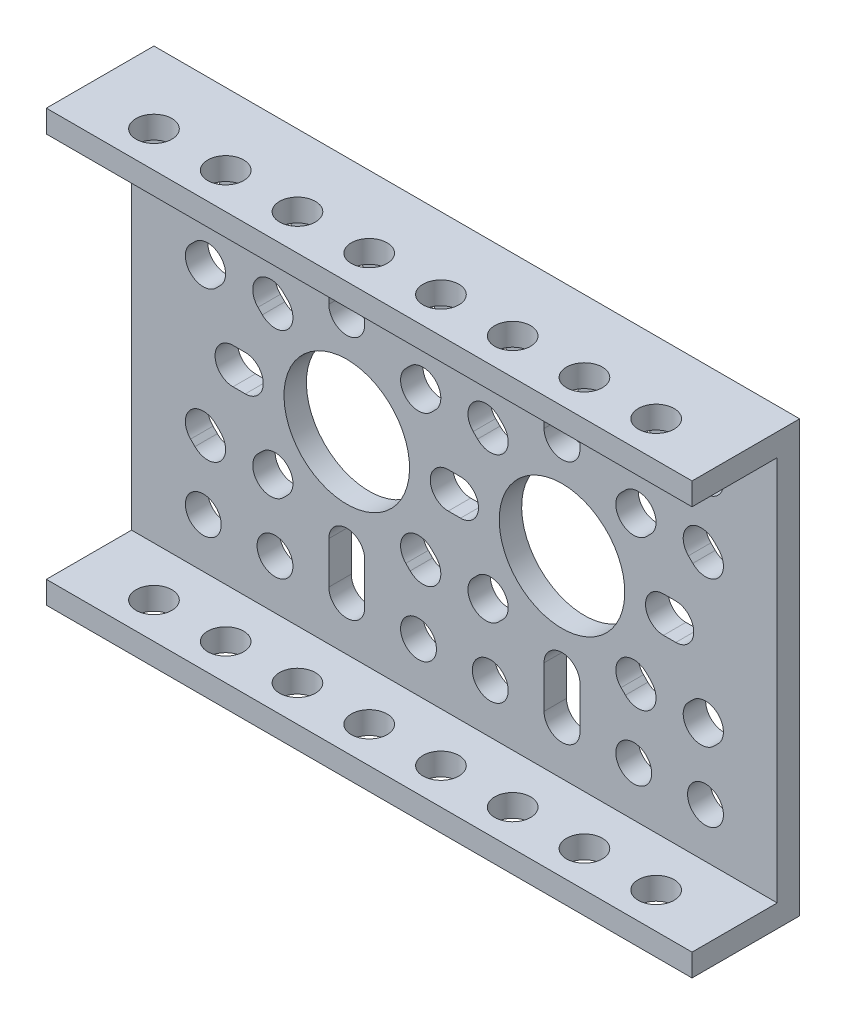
ISO-10303-21;
HEADER;
FILE_DESCRIPTION(('STEP AP214'),'2;1');
FILE_NAME('part.step','',(''),(''),'','','');
FILE_SCHEMA(('AUTOMOTIVE_DESIGN { 1 0 10303 214 1 1 1 1 }'));
ENDSEC;
DATA;
#1=APPLICATION_CONTEXT('core data for automotive mechanical design processes');
#2=APPLICATION_PROTOCOL_DEFINITION('international standard','automotive_design',2000,#1);
#3=PRODUCT_CONTEXT('',#1,'mechanical');
#4=PRODUCT('Part','Part','',(#3));
#5=PRODUCT_RELATED_PRODUCT_CATEGORY('part','',(#4));
#6=PRODUCT_DEFINITION_FORMATION('','',#4);
#7=PRODUCT_DEFINITION_CONTEXT('part definition',#1,'design');
#8=PRODUCT_DEFINITION('design','',#6,#7);
#9=PRODUCT_DEFINITION_SHAPE('','',#8);
#10=(LENGTH_UNIT() NAMED_UNIT(*) SI_UNIT(.MILLI.,.METRE.));
#11=(NAMED_UNIT(*) PLANE_ANGLE_UNIT() SI_UNIT($,.RADIAN.));
#12=(NAMED_UNIT(*) SI_UNIT($,.STERADIAN.) SOLID_ANGLE_UNIT());
#13=UNCERTAINTY_MEASURE_WITH_UNIT(LENGTH_MEASURE(1.E-05),#10,'distance_accuracy_value','');
#14=(GEOMETRIC_REPRESENTATION_CONTEXT(3) GLOBAL_UNCERTAINTY_ASSIGNED_CONTEXT((#13)) GLOBAL_UNIT_ASSIGNED_CONTEXT((#10,
#11,#12)) REPRESENTATION_CONTEXT('',''));
#15=CARTESIAN_POINT('',(0.,0.,0.));
#16=DIRECTION('',(0.,0.,1.));
#17=DIRECTION('',(1.,0.,0.));
#18=AXIS2_PLACEMENT_3D('',#15,#16,#17);
#19=CARTESIAN_POINT('',(23.8357864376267,24.1642135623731,58.0000000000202));
#20=DIRECTION('',(0.707106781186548,-0.707106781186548,0.));
#21=DIRECTION('',(0.707106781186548,0.707106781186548,0.));
#22=AXIS2_PLACEMENT_3D('',#19,#20,#21);
#23=PLANE('',#22);
#24=DIRECTION('',(0.707106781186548,0.707106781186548,0.));
#25=VECTOR('',#24,1.);
#26=CARTESIAN_POINT('',(23.8357864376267,24.1642135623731,48.0000000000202));
#27=LINE('',#26,#25);
#28=CARTESIAN_POINT('',(30.5857864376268,30.914213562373,48.0000000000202));
#29=VERTEX_POINT('',#28);
#30=CARTESIAN_POINT('',(31.0710678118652,31.3994949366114,48.0000000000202));
#31=VERTEX_POINT('',#30);
#32=EDGE_CURVE('E650',#29,#31,#27,.T.);
#33=ORIENTED_EDGE('',*,*,#32,.T.);
#34=DIRECTION('',(0.,0.,-1.));
#35=VECTOR('',#34,1.);
#36=CARTESIAN_POINT('',(31.0710678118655,31.3994949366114,58.0000000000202));
#37=LINE('',#36,#35);
#38=CARTESIAN_POINT('',(31.0710678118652,31.3994949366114,50.5000000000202));
#39=VERTEX_POINT('',#38);
#40=EDGE_CURVE('E516',#31,#39,#37,.F.);
#41=ORIENTED_EDGE('',*,*,#40,.T.);
#42=DIRECTION('',(-0.707106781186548,-0.707106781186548,0.));
#43=VECTOR('',#42,1.);
#44=CARTESIAN_POINT('',(31.0710678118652,31.3994949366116,50.5000000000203));
#45=LINE('',#44,#43);
#46=CARTESIAN_POINT('',(30.5857864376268,30.914213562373,50.5000000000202));
#47=VERTEX_POINT('',#46);
#48=EDGE_CURVE('E493',#39,#47,#45,.T.);
#49=ORIENTED_EDGE('',*,*,#48,.T.);
#50=DIRECTION('',(0.,0.,-1.));
#51=VECTOR('',#50,1.);
#52=CARTESIAN_POINT('',(30.5857864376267,30.9142135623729,58.0000000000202));
#53=LINE('',#52,#51);
#54=EDGE_CURVE('E1148',#47,#29,#53,.T.);
#55=ORIENTED_EDGE('',*,*,#54,.T.);
#56=EDGE_LOOP('',(#33,#41,#49,#55));
#57=FACE_BOUND('',#56,.T.);
#58=ADVANCED_FACE('F17',(#57),#23,.T.);
#59=CARTESIAN_POINT('',(26.6642135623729,21.3357864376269,58.0000000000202));
#60=DIRECTION('',(0.707106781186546,-0.707106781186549,0.));
#61=DIRECTION('',(0.707106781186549,0.707106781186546,0.));
#62=AXIS2_PLACEMENT_3D('',#59,#60,#61);
#63=PLANE('',#62);
#64=DIRECTION('',(0.707106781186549,0.707106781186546,0.));
#65=VECTOR('',#64,1.);
#66=CARTESIAN_POINT('',(26.6642135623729,21.3357864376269,48.0000000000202));
#67=LINE('',#66,#65);
#68=CARTESIAN_POINT('',(33.414213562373,28.0857864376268,48.0000000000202));
#69=VERTEX_POINT('',#68);
#70=CARTESIAN_POINT('',(33.8994949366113,28.5710678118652,48.0000000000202));
#71=VERTEX_POINT('',#70);
#72=EDGE_CURVE('E648',#69,#71,#67,.T.);
#73=ORIENTED_EDGE('',*,*,#72,.F.);
#74=DIRECTION('',(0.,0.,-1.));
#75=VECTOR('',#74,1.);
#76=CARTESIAN_POINT('',(33.4142135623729,28.0857864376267,58.0000000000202));
#77=LINE('',#76,#75);
#78=CARTESIAN_POINT('',(33.4142135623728,28.0857864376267,50.5000000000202));
#79=VERTEX_POINT('',#78);
#80=EDGE_CURVE('E505',#69,#79,#77,.F.);
#81=ORIENTED_EDGE('',*,*,#80,.T.);
#82=DIRECTION('',(0.707106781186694,0.707106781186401,0.));
#83=VECTOR('',#82,1.);
#84=CARTESIAN_POINT('',(33.4142135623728,28.0857864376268,50.5000000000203));
#85=LINE('',#84,#83);
#86=CARTESIAN_POINT('',(33.8994949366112,28.571067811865,50.5000000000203));
#87=VERTEX_POINT('',#86);
#88=EDGE_CURVE('E499',#79,#87,#85,.T.);
#89=ORIENTED_EDGE('',*,*,#88,.T.);
#90=DIRECTION('',(0.,0.,-1.));
#91=VECTOR('',#90,1.);
#92=CARTESIAN_POINT('',(33.8994949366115,28.5710678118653,58.0000000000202));
#93=LINE('',#92,#91);
#94=EDGE_CURVE('E502',#87,#71,#93,.T.);
#95=ORIENTED_EDGE('',*,*,#94,.T.);
#96=EDGE_LOOP('',(#73,#81,#89,#95));
#97=FACE_BOUND('',#96,.T.);
#98=ADVANCED_FACE('F501',(#97),#63,.F.);
#99=CARTESIAN_POINT('',(35.3137084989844,23.5,48.0000000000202));
#100=DIRECTION('',(0.,1.,0.));
#101=DIRECTION('',(0.,0.,1.));
#102=AXIS2_PLACEMENT_3D('',#99,#100,#101);
#103=PLANE('',#102);
#104=DIRECTION('',(0.,0.,1.));
#105=VECTOR('',#104,1.);
#106=CARTESIAN_POINT('',(36.6862915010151,23.5,48.0000000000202));
#107=LINE('',#106,#105);
#108=CARTESIAN_POINT('',(36.6862915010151,23.5,48.0000000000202));
#109=VERTEX_POINT('',#108);
#110=CARTESIAN_POINT('',(36.6862915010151,23.5,50.5000000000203));
#111=VERTEX_POINT('',#110);
#112=EDGE_CURVE('E1136',#109,#111,#107,.T.);
#113=ORIENTED_EDGE('',*,*,#112,.T.);
#114=DIRECTION('',(1.,0.,0.));
#115=VECTOR('',#114,1.);
#116=CARTESIAN_POINT('',(-24.0000000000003,23.5,50.5000000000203));
#117=LINE('',#116,#115);
#118=CARTESIAN_POINT('',(35.3137084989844,23.5,50.5000000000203));
#119=VERTEX_POINT('',#118);
#120=EDGE_CURVE('E1230',#111,#119,#117,.F.);
#121=ORIENTED_EDGE('',*,*,#120,.T.);
#122=DIRECTION('',(0.,0.,1.));
#123=VECTOR('',#122,1.);
#124=CARTESIAN_POINT('',(35.3137084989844,23.5,48.0000000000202));
#125=LINE('',#124,#123);
#126=CARTESIAN_POINT('',(35.3137084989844,23.5,48.0000000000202));
#127=VERTEX_POINT('',#126);
#128=EDGE_CURVE('E1135',#119,#127,#125,.F.);
#129=ORIENTED_EDGE('',*,*,#128,.T.);
#130=DIRECTION('',(1.,0.,0.));
#131=VECTOR('',#130,1.);
#132=CARTESIAN_POINT('',(35.3137084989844,23.5,48.0000000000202));
#133=LINE('',#132,#131);
#134=EDGE_CURVE('E646',#109,#127,#133,.F.);
#135=ORIENTED_EDGE('',*,*,#134,.F.);
#136=EDGE_LOOP('',(#113,#121,#129,#135));
#137=FACE_BOUND('',#136,.T.);
#138=ADVANCED_FACE('F1388',(#137),#103,.F.);
#139=CARTESIAN_POINT('',(35.3137084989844,19.5,48.0000000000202));
#140=DIRECTION('',(0.,-1.,0.));
#141=DIRECTION('',(1.,0.,0.));
#142=AXIS2_PLACEMENT_3D('',#139,#140,#141);
#143=PLANE('',#142);
#144=DIRECTION('',(0.,0.,1.));
#145=VECTOR('',#144,1.);
#146=CARTESIAN_POINT('',(35.3137084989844,19.5,48.0000000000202));
#147=LINE('',#146,#145);
#148=CARTESIAN_POINT('',(35.3137084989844,19.5,48.0000000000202));
#149=VERTEX_POINT('',#148);
#150=CARTESIAN_POINT('',(35.3137084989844,19.5,50.5000000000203));
#151=VERTEX_POINT('',#150);
#152=EDGE_CURVE('E1131',#149,#151,#147,.T.);
#153=ORIENTED_EDGE('',*,*,#152,.T.);
#154=DIRECTION('',(1.,0.,0.));
#155=VECTOR('',#154,1.);
#156=CARTESIAN_POINT('',(-24.0000000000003,19.5,50.5000000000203));
#157=LINE('',#156,#155);
#158=CARTESIAN_POINT('',(36.6862915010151,19.5,50.5000000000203));
#159=VERTEX_POINT('',#158);
#160=EDGE_CURVE('E1227',#151,#159,#157,.T.);
#161=ORIENTED_EDGE('',*,*,#160,.T.);
#162=DIRECTION('',(0.,0.,1.));
#163=VECTOR('',#162,1.);
#164=CARTESIAN_POINT('',(36.6862915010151,19.5,48.0000000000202));
#165=LINE('',#164,#163);
#166=CARTESIAN_POINT('',(36.6862915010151,19.5,48.0000000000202));
#167=VERTEX_POINT('',#166);
#168=EDGE_CURVE('E1140',#159,#167,#165,.F.);
#169=ORIENTED_EDGE('',*,*,#168,.T.);
#170=DIRECTION('',(1.,0.,0.));
#171=VECTOR('',#170,1.);
#172=CARTESIAN_POINT('',(35.3137084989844,19.5,48.0000000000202));
#173=LINE('',#172,#171);
#174=EDGE_CURVE('E628',#149,#167,#173,.T.);
#175=ORIENTED_EDGE('',*,*,#174,.F.);
#176=EDGE_LOOP('',(#153,#161,#169,#175));
#177=FACE_BOUND('',#176,.T.);
#178=ADVANCED_FACE('F1399',(#177),#143,.F.);
#179=CARTESIAN_POINT('',(57.3357864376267,9.33578643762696,58.0000000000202));
#180=DIRECTION('',(0.707106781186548,0.707106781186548,0.));
#181=DIRECTION('',(-0.707106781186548,0.707106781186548,0.));
#182=AXIS2_PLACEMENT_3D('',#179,#180,#181);
#183=PLANE('',#182);
#184=DIRECTION('',(-0.707106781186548,0.707106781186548,0.));
#185=VECTOR('',#184,1.);
#186=CARTESIAN_POINT('',(57.3357864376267,9.33578643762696,48.0000000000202));
#187=LINE('',#186,#185);
#188=CARTESIAN_POINT('',(38.5857864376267,28.085786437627,48.0000000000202));
#189=VERTEX_POINT('',#188);
#190=CARTESIAN_POINT('',(38.1005050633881,28.5710678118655,48.0000000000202));
#191=VERTEX_POINT('',#190);
#192=EDGE_CURVE('E626',#189,#191,#187,.T.);
#193=ORIENTED_EDGE('',*,*,#192,.T.);
#194=DIRECTION('',(0.,0.,-1.));
#195=VECTOR('',#194,1.);
#196=CARTESIAN_POINT('',(38.1005050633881,28.5710678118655,58.0000000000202));
#197=LINE('',#196,#195);
#198=CARTESIAN_POINT('',(38.1005050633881,28.5710678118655,50.5000000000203));
#199=VERTEX_POINT('',#198);
#200=EDGE_CURVE('E1359',#191,#199,#197,.F.);
#201=ORIENTED_EDGE('',*,*,#200,.T.);
#202=DIRECTION('',(0.707106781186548,-0.707106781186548,0.));
#203=VECTOR('',#202,1.);
#204=CARTESIAN_POINT('',(38.1005050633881,28.5710678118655,50.5000000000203));
#205=LINE('',#204,#203);
#206=CARTESIAN_POINT('',(38.5857864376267,28.085786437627,50.5000000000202));
#207=VERTEX_POINT('',#206);
#208=EDGE_CURVE('E1224',#199,#207,#205,.T.);
#209=ORIENTED_EDGE('',*,*,#208,.T.);
#210=DIRECTION('',(0.,0.,-1.));
#211=VECTOR('',#210,1.);
#212=CARTESIAN_POINT('',(38.5857864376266,28.0857864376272,58.0000000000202));
#213=LINE('',#212,#211);
#214=EDGE_CURVE('E1356',#207,#189,#213,.T.);
#215=ORIENTED_EDGE('',*,*,#214,.T.);
#216=EDGE_LOOP('',(#193,#201,#209,#215));
#217=FACE_BOUND('',#216,.T.);
#218=ADVANCED_FACE('F1994',(#217),#183,.T.);
#219=CARTESIAN_POINT('',(60.1642135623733,12.1642135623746,58.0000000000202));
#220=DIRECTION('',(0.707106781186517,0.707106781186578,0.));
#221=DIRECTION('',(-0.707106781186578,0.707106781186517,0.));
#222=AXIS2_PLACEMENT_3D('',#219,#220,#221);
#223=PLANE('',#222);
#224=DIRECTION('',(-0.707106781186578,0.707106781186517,0.));
#225=VECTOR('',#224,1.);
#226=CARTESIAN_POINT('',(60.1642135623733,12.1642135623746,48.0000000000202));
#227=LINE('',#226,#225);
#228=CARTESIAN_POINT('',(41.4142135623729,30.9142135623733,48.0000000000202));
#229=VERTEX_POINT('',#228);
#230=CARTESIAN_POINT('',(40.9289321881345,31.3994949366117,48.0000000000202));
#231=VERTEX_POINT('',#230);
#232=EDGE_CURVE('E624',#229,#231,#227,.T.);
#233=ORIENTED_EDGE('',*,*,#232,.F.);
#234=DIRECTION('',(0.,0.,-1.));
#235=VECTOR('',#234,1.);
#236=CARTESIAN_POINT('',(41.4142135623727,30.9142135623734,58.0000000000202));
#237=LINE('',#236,#235);
#238=CARTESIAN_POINT('',(41.414213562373,30.9142135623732,50.5000000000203));
#239=VERTEX_POINT('',#238);
#240=EDGE_CURVE('E1103',#229,#239,#237,.F.);
#241=ORIENTED_EDGE('',*,*,#240,.T.);
#242=DIRECTION('',(-0.707106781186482,0.707106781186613,0.));
#243=VECTOR('',#242,1.);
#244=CARTESIAN_POINT('',(41.4142135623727,30.9142135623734,50.5000000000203));
#245=LINE('',#244,#243);
#246=CARTESIAN_POINT('',(40.9289321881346,31.3994949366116,50.5000000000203));
#247=VERTEX_POINT('',#246);
#248=EDGE_CURVE('E1222',#239,#247,#245,.T.);
#249=ORIENTED_EDGE('',*,*,#248,.T.);
#250=DIRECTION('',(0.,0.,-1.));
#251=VECTOR('',#250,1.);
#252=CARTESIAN_POINT('',(40.9289321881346,31.3994949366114,58.0000000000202));
#253=LINE('',#252,#251);
#254=EDGE_CURVE('E1107',#247,#231,#253,.T.);
#255=ORIENTED_EDGE('',*,*,#254,.T.);
#256=EDGE_LOOP('',(#233,#241,#249,#255));
#257=FACE_BOUND('',#256,.T.);
#258=ADVANCED_FACE('F1990',(#257),#223,.F.);
#259=CARTESIAN_POINT('',(38.6642135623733,9.33578643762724,58.0000000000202));
#260=DIRECTION('',(-0.70710678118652,0.707106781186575,0.));
#261=DIRECTION('',(-0.707106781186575,-0.70710678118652,0.));
#262=AXIS2_PLACEMENT_3D('',#259,#260,#261);
#263=PLANE('',#262);
#264=DIRECTION('',(-0.707106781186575,-0.70710678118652,0.));
#265=VECTOR('',#264,1.);
#266=CARTESIAN_POINT('',(38.6642135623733,9.33578643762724,48.0000000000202));
#267=LINE('',#266,#265);
#268=CARTESIAN_POINT('',(41.4142135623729,12.0857864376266,48.0000000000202));
#269=VERTEX_POINT('',#268);
#270=CARTESIAN_POINT('',(40.9289321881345,11.6005050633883,48.0000000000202));
#271=VERTEX_POINT('',#270);
#272=EDGE_CURVE('E622',#269,#271,#267,.T.);
#273=ORIENTED_EDGE('',*,*,#272,.T.);
#274=DIRECTION('',(0.,0.,-1.));
#275=VECTOR('',#274,1.);
#276=CARTESIAN_POINT('',(40.9289321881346,11.6005050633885,58.0000000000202));
#277=LINE('',#276,#275);
#278=CARTESIAN_POINT('',(40.9289321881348,11.6005050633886,50.5000000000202));
#279=VERTEX_POINT('',#278);
#280=EDGE_CURVE('E1098',#271,#279,#277,.F.);
#281=ORIENTED_EDGE('',*,*,#280,.T.);
#282=DIRECTION('',(0.707106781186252,0.707106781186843,0.));
#283=VECTOR('',#282,1.);
#284=CARTESIAN_POINT('',(40.9289321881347,11.6005050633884,50.5000000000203));
#285=LINE('',#284,#283);
#286=CARTESIAN_POINT('',(41.4142135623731,12.085786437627,50.5000000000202));
#287=VERTEX_POINT('',#286);
#288=EDGE_CURVE('E1219',#279,#287,#285,.T.);
#289=ORIENTED_EDGE('',*,*,#288,.T.);
#290=DIRECTION('',(0.,0.,-1.));
#291=VECTOR('',#290,1.);
#292=CARTESIAN_POINT('',(41.4142135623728,12.0857864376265,58.0000000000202));
#293=LINE('',#292,#291);
#294=EDGE_CURVE('E1097',#287,#269,#293,.T.);
#295=ORIENTED_EDGE('',*,*,#294,.T.);
#296=EDGE_LOOP('',(#273,#281,#289,#295));
#297=FACE_BOUND('',#296,.T.);
#298=ADVANCED_FACE('F1986',(#297),#263,.T.);
#299=CARTESIAN_POINT('',(35.8357864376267,12.164213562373,58.0000000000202));
#300=DIRECTION('',(-0.707106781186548,0.707106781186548,0.));
#301=DIRECTION('',(-0.707106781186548,-0.707106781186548,0.));
#302=AXIS2_PLACEMENT_3D('',#299,#300,#301);
#303=PLANE('',#302);
#304=DIRECTION('',(-0.707106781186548,-0.707106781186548,0.));
#305=VECTOR('',#304,1.);
#306=CARTESIAN_POINT('',(35.8357864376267,12.164213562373,48.0000000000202));
#307=LINE('',#306,#305);
#308=CARTESIAN_POINT('',(38.5857864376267,14.9142135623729,48.0000000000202));
#309=VERTEX_POINT('',#308);
#310=CARTESIAN_POINT('',(38.1005050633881,14.4289321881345,48.0000000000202));
#311=VERTEX_POINT('',#310);
#312=EDGE_CURVE('E616',#309,#311,#307,.T.);
#313=ORIENTED_EDGE('',*,*,#312,.F.);
#314=DIRECTION('',(0.,0.,-1.));
#315=VECTOR('',#314,1.);
#316=CARTESIAN_POINT('',(38.5857864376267,14.9142135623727,58.0000000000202));
#317=LINE('',#316,#315);
#318=CARTESIAN_POINT('',(38.5857864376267,14.9142135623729,50.5000000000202));
#319=VERTEX_POINT('',#318);
#320=EDGE_CURVE('E1093',#309,#319,#317,.F.);
#321=ORIENTED_EDGE('',*,*,#320,.T.);
#322=DIRECTION('',(-0.707106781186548,-0.707106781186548,0.));
#323=VECTOR('',#322,1.);
#324=CARTESIAN_POINT('',(38.5857864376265,14.9142135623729,50.5000000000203));
#325=LINE('',#324,#323);
#326=CARTESIAN_POINT('',(38.1005050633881,14.4289321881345,50.5000000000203));
#327=VERTEX_POINT('',#326);
#328=EDGE_CURVE('E1216',#319,#327,#325,.T.);
#329=ORIENTED_EDGE('',*,*,#328,.T.);
#330=DIRECTION('',(0.,0.,-1.));
#331=VECTOR('',#330,1.);
#332=CARTESIAN_POINT('',(38.1005050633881,14.4289321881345,58.0000000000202));
#333=LINE('',#332,#331);
#334=EDGE_CURVE('E1102',#327,#311,#333,.T.);
#335=ORIENTED_EDGE('',*,*,#334,.T.);
#336=EDGE_LOOP('',(#313,#321,#329,#335));
#337=FACE_BOUND('',#336,.T.);
#338=ADVANCED_FACE('F1982',(#337),#303,.F.);
#339=CARTESIAN_POINT('',(45.3357864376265,-2.66421356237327,58.0000000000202));
#340=DIRECTION('',(-0.707106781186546,-0.707106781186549,0.));
#341=DIRECTION('',(0.707106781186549,-0.707106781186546,0.));
#342=AXIS2_PLACEMENT_3D('',#339,#340,#341);
#343=PLANE('',#342);
#344=DIRECTION('',(0.707106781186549,-0.707106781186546,0.));
#345=VECTOR('',#344,1.);
#346=CARTESIAN_POINT('',(45.3357864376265,-2.66421356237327,48.0000000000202));
#347=LINE('',#346,#345);
#348=CARTESIAN_POINT('',(30.5857864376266,12.0857864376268,48.0000000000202));
#349=VERTEX_POINT('',#348);
#350=CARTESIAN_POINT('',(31.0710678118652,11.6005050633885,48.0000000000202));
#351=VERTEX_POINT('',#350);
#352=EDGE_CURVE('E610',#349,#351,#347,.T.);
#353=ORIENTED_EDGE('',*,*,#352,.F.);
#354=DIRECTION('',(0.,0.,-1.));
#355=VECTOR('',#354,1.);
#356=CARTESIAN_POINT('',(30.5857864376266,12.085786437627,58.0000000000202));
#357=LINE('',#356,#355);
#358=CARTESIAN_POINT('',(30.585786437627,12.0857864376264,50.5000000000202));
#359=VERTEX_POINT('',#358);
#360=EDGE_CURVE('E1343',#349,#359,#357,.F.);
#361=ORIENTED_EDGE('',*,*,#360,.T.);
#362=DIRECTION('',(0.707106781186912,-0.707106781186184,0.));
#363=VECTOR('',#362,1.);
#364=CARTESIAN_POINT('',(30.5857864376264,12.0857864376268,50.5000000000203));
#365=LINE('',#364,#363);
#366=CARTESIAN_POINT('',(31.0710678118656,11.6005050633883,50.5000000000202));
#367=VERTEX_POINT('',#366);
#368=EDGE_CURVE('E1213',#359,#367,#365,.T.);
#369=ORIENTED_EDGE('',*,*,#368,.T.);
#370=DIRECTION('',(0.,0.,-1.));
#371=VECTOR('',#370,1.);
#372=CARTESIAN_POINT('',(31.0710678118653,11.6005050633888,58.0000000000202));
#373=LINE('',#372,#371);
#374=EDGE_CURVE('E1340',#367,#351,#373,.T.);
#375=ORIENTED_EDGE('',*,*,#374,.T.);
#376=EDGE_LOOP('',(#353,#361,#369,#375));
#377=FACE_BOUND('',#376,.T.);
#378=ADVANCED_FACE('F1979',(#377),#343,.F.);
#379=CARTESIAN_POINT('',(48.1642135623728,0.164213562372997,58.0000000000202));
#380=DIRECTION('',(-0.70710678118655,-0.707106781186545,0.));
#381=DIRECTION('',(0.707106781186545,-0.70710678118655,0.));
#382=AXIS2_PLACEMENT_3D('',#379,#380,#381);
#383=PLANE('',#382);
#384=DIRECTION('',(0.707106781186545,-0.70710678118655,0.));
#385=VECTOR('',#384,1.);
#386=CARTESIAN_POINT('',(48.1642135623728,0.164213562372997,48.0000000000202));
#387=LINE('',#386,#385);
#388=CARTESIAN_POINT('',(33.414213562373,14.9142135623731,48.0000000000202));
#389=VERTEX_POINT('',#388);
#390=CARTESIAN_POINT('',(33.8994949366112,14.4289321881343,48.0000000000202));
#391=VERTEX_POINT('',#390);
#392=EDGE_CURVE('E607',#389,#391,#387,.T.);
#393=ORIENTED_EDGE('',*,*,#392,.T.);
#394=DIRECTION('',(0.,0.,-1.));
#395=VECTOR('',#394,1.);
#396=CARTESIAN_POINT('',(33.899494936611,14.4289321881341,58.0000000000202));
#397=LINE('',#396,#395);
#398=CARTESIAN_POINT('',(33.8994949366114,14.4289321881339,50.5000000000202));
#399=VERTEX_POINT('',#398);
#400=EDGE_CURVE('E1080',#391,#399,#397,.F.);
#401=ORIENTED_EDGE('',*,*,#400,.T.);
#402=DIRECTION('',(-0.707106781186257,0.707106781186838,0.));
#403=VECTOR('',#402,1.);
#404=CARTESIAN_POINT('',(33.8994949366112,14.4289321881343,50.5000000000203));
#405=LINE('',#404,#403);
#406=CARTESIAN_POINT('',(33.4142135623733,14.9142135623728,50.5000000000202));
#407=VERTEX_POINT('',#406);
#408=EDGE_CURVE('E1211',#399,#407,#405,.T.);
#409=ORIENTED_EDGE('',*,*,#408,.T.);
#410=DIRECTION('',(0.,0.,-1.));
#411=VECTOR('',#410,1.);
#412=CARTESIAN_POINT('',(33.414213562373,14.9142135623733,58.0000000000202));
#413=LINE('',#412,#411);
#414=EDGE_CURVE('E1084',#407,#389,#413,.T.);
#415=ORIENTED_EDGE('',*,*,#414,.T.);
#416=EDGE_LOOP('',(#393,#401,#409,#415));
#417=FACE_BOUND('',#416,.T.);
#418=ADVANCED_FACE('F1975',(#417),#383,.T.);
#419=CARTESIAN_POINT('',(23.9999999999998,-2.5,56.0000000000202));
#420=DIRECTION('',(0.,1.,0.));
#421=DIRECTION('',(0.,0.,1.));
#422=AXIS2_PLACEMENT_3D('',#419,#420,#421);
#423=CYLINDRICAL_SURFACE('',#422,2.);
#424=CARTESIAN_POINT('',(23.9999999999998,-2.50000000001,56.0000000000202));
#425=DIRECTION('',(0.,1.,0.));
#426=DIRECTION('',(0.,0.,1.));
#427=AXIS2_PLACEMENT_3D('',#424,#425,#426);
#428=CIRCLE('',#427,2.);
#429=CARTESIAN_POINT('',(23.9999999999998,-2.50000000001,58.0000000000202));
#430=VERTEX_POINT('',#429);
#431=EDGE_CURVE('E1068',#430,#430,#428,.F.);
#432=ORIENTED_EDGE('',*,*,#431,.T.);
#433=EDGE_LOOP('',(#432));
#434=FACE_BOUND('',#433,.T.);
#435=CARTESIAN_POINT('',(23.9999999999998,1.0024099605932E-11,56.0000000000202));
#436=DIRECTION('',(0.,1.,0.));
#437=DIRECTION('',(0.,0.,1.));
#438=AXIS2_PLACEMENT_3D('',#435,#436,#437);
#439=CIRCLE('',#438,2.);
#440=CARTESIAN_POINT('',(23.9999999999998,1.0024099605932E-11,58.0000000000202));
#441=VERTEX_POINT('',#440);
#442=EDGE_CURVE('E604',#441,#441,#439,.F.);
#443=ORIENTED_EDGE('',*,*,#442,.F.);
#444=EDGE_LOOP('',(#443));
#445=FACE_BOUND('',#444,.T.);
#446=ADVANCED_FACE('F1971',(#434,#445),#423,.F.);
#447=CARTESIAN_POINT('',(40.,-2.5,56.0000000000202));
#448=DIRECTION('',(0.,1.,0.));
#449=DIRECTION('',(0.,0.,1.));
#450=AXIS2_PLACEMENT_3D('',#447,#448,#449);
#451=CYLINDRICAL_SURFACE('',#450,2.);
#452=CARTESIAN_POINT('',(40.,-2.50000000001,56.0000000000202));
#453=DIRECTION('',(0.,1.,0.));
#454=DIRECTION('',(0.,0.,1.));
#455=AXIS2_PLACEMENT_3D('',#452,#453,#454);
#456=CIRCLE('',#455,2.);
#457=CARTESIAN_POINT('',(40.,-2.50000000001,58.0000000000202));
#458=VERTEX_POINT('',#457);
#459=EDGE_CURVE('E1063',#458,#458,#456,.F.);
#460=ORIENTED_EDGE('',*,*,#459,.T.);
#461=EDGE_LOOP('',(#460));
#462=FACE_BOUND('',#461,.T.);
#463=CARTESIAN_POINT('',(40.,1.0024099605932E-11,56.0000000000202));
#464=DIRECTION('',(0.,1.,0.));
#465=DIRECTION('',(0.,0.,1.));
#466=AXIS2_PLACEMENT_3D('',#463,#464,#465);
#467=CIRCLE('',#466,2.);
#468=CARTESIAN_POINT('',(40.,1.0024099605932E-11,58.0000000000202));
#469=VERTEX_POINT('',#468);
#470=EDGE_CURVE('E599',#469,#469,#467,.F.);
#471=ORIENTED_EDGE('',*,*,#470,.F.);
#472=EDGE_LOOP('',(#471));
#473=FACE_BOUND('',#472,.T.);
#474=ADVANCED_FACE('F1967',(#462,#473),#451,.F.);
#475=CARTESIAN_POINT('',(32.,-2.5,56.0000000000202));
#476=DIRECTION('',(0.,1.,0.));
#477=DIRECTION('',(0.,0.,1.));
#478=AXIS2_PLACEMENT_3D('',#475,#476,#477);
#479=CYLINDRICAL_SURFACE('',#478,2.);
#480=CARTESIAN_POINT('',(32.,-2.50000000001,56.0000000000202));
#481=DIRECTION('',(0.,1.,0.));
#482=DIRECTION('',(0.,0.,1.));
#483=AXIS2_PLACEMENT_3D('',#480,#481,#482);
#484=CIRCLE('',#483,2.);
#485=CARTESIAN_POINT('',(32.,-2.50000000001,58.0000000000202));
#486=VERTEX_POINT('',#485);
#487=EDGE_CURVE('E1059',#486,#486,#484,.F.);
#488=ORIENTED_EDGE('',*,*,#487,.T.);
#489=EDGE_LOOP('',(#488));
#490=FACE_BOUND('',#489,.T.);
#491=CARTESIAN_POINT('',(32.,1.0024099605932E-11,56.0000000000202));
#492=DIRECTION('',(0.,1.,0.));
#493=DIRECTION('',(0.,0.,1.));
#494=AXIS2_PLACEMENT_3D('',#491,#492,#493);
#495=CIRCLE('',#494,2.);
#496=CARTESIAN_POINT('',(32.,1.0024099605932E-11,58.0000000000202));
#497=VERTEX_POINT('',#496);
#498=EDGE_CURVE('E594',#497,#497,#495,.F.);
#499=ORIENTED_EDGE('',*,*,#498,.F.);
#500=EDGE_LOOP('',(#499));
#501=FACE_BOUND('',#500,.T.);
#502=ADVANCED_FACE('F1963',(#490,#501),#479,.F.);
#503=CARTESIAN_POINT('',(7.99999999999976,-2.5,56.0000000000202));
#504=DIRECTION('',(0.,1.,0.));
#505=DIRECTION('',(0.,0.,1.));
#506=AXIS2_PLACEMENT_3D('',#503,#504,#505);
#507=CYLINDRICAL_SURFACE('',#506,2.);
#508=CARTESIAN_POINT('',(7.99999999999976,-2.50000000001,56.0000000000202));
#509=DIRECTION('',(0.,1.,0.));
#510=DIRECTION('',(0.,0.,1.));
#511=AXIS2_PLACEMENT_3D('',#508,#509,#510);
#512=CIRCLE('',#511,2.);
#513=CARTESIAN_POINT('',(7.99999999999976,-2.50000000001,58.0000000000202));
#514=VERTEX_POINT('',#513);
#515=EDGE_CURVE('E1051',#514,#514,#512,.F.);
#516=ORIENTED_EDGE('',*,*,#515,.T.);
#517=EDGE_LOOP('',(#516));
#518=FACE_BOUND('',#517,.T.);
#519=CARTESIAN_POINT('',(7.99999999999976,1.0024099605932E-11,56.0000000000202));
#520=DIRECTION('',(0.,1.,0.));
#521=DIRECTION('',(0.,0.,1.));
#522=AXIS2_PLACEMENT_3D('',#519,#520,#521);
#523=CIRCLE('',#522,2.);
#524=CARTESIAN_POINT('',(7.99999999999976,1.0024099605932E-11,58.0000000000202));
#525=VERTEX_POINT('',#524);
#526=EDGE_CURVE('E589',#525,#525,#523,.F.);
#527=ORIENTED_EDGE('',*,*,#526,.F.);
#528=EDGE_LOOP('',(#527));
#529=FACE_BOUND('',#528,.T.);
#530=ADVANCED_FACE('F1959',(#518,#529),#507,.F.);
#531=CARTESIAN_POINT('',(15.9999999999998,-2.5,56.0000000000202));
#532=DIRECTION('',(0.,1.,0.));
#533=DIRECTION('',(0.,0.,1.));
#534=AXIS2_PLACEMENT_3D('',#531,#532,#533);
#535=CYLINDRICAL_SURFACE('',#534,2.);
#536=CARTESIAN_POINT('',(15.9999999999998,-2.50000000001,56.0000000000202));
#537=DIRECTION('',(0.,1.,0.));
#538=DIRECTION('',(0.,0.,1.));
#539=AXIS2_PLACEMENT_3D('',#536,#537,#538);
#540=CIRCLE('',#539,2.);
#541=CARTESIAN_POINT('',(15.9999999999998,-2.50000000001,58.0000000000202));
#542=VERTEX_POINT('',#541);
#543=EDGE_CURVE('E1046',#542,#542,#540,.F.);
#544=ORIENTED_EDGE('',*,*,#543,.T.);
#545=EDGE_LOOP('',(#544));
#546=FACE_BOUND('',#545,.T.);
#547=CARTESIAN_POINT('',(15.9999999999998,1.0024099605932E-11,56.0000000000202));
#548=DIRECTION('',(0.,1.,0.));
#549=DIRECTION('',(0.,0.,1.));
#550=AXIS2_PLACEMENT_3D('',#547,#548,#549);
#551=CIRCLE('',#550,2.);
#552=CARTESIAN_POINT('',(15.9999999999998,1.0024099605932E-11,58.0000000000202));
#553=VERTEX_POINT('',#552);
#554=EDGE_CURVE('E584',#553,#553,#551,.F.);
#555=ORIENTED_EDGE('',*,*,#554,.F.);
#556=EDGE_LOOP('',(#555));
#557=FACE_BOUND('',#556,.T.);
#558=ADVANCED_FACE('F1955',(#546,#557),#535,.F.);
#559=CARTESIAN_POINT('',(-2.42861286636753E-13,-2.5,56.0000000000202));
#560=DIRECTION('',(0.,1.,0.));
#561=DIRECTION('',(0.,0.,1.));
#562=AXIS2_PLACEMENT_3D('',#559,#560,#561);
#563=CYLINDRICAL_SURFACE('',#562,2.);
#564=CARTESIAN_POINT('',(-2.42861286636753E-13,-2.50000000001,56.0000000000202));
#565=DIRECTION('',(0.,1.,0.));
#566=DIRECTION('',(0.,0.,1.));
#567=AXIS2_PLACEMENT_3D('',#564,#565,#566);
#568=CIRCLE('',#567,2.);
#569=CARTESIAN_POINT('',(-2.42861286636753E-13,-2.50000000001,58.0000000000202));
#570=VERTEX_POINT('',#569);
#571=EDGE_CURVE('E1041',#570,#570,#568,.F.);
#572=ORIENTED_EDGE('',*,*,#571,.T.);
#573=EDGE_LOOP('',(#572));
#574=FACE_BOUND('',#573,.T.);
#575=CARTESIAN_POINT('',(-2.42861286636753E-13,1.0024099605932E-11,56.0000000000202));
#576=DIRECTION('',(0.,1.,0.));
#577=DIRECTION('',(0.,0.,1.));
#578=AXIS2_PLACEMENT_3D('',#575,#576,#577);
#579=CIRCLE('',#578,2.);
#580=CARTESIAN_POINT('',(-2.42861286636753E-13,1.0024099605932E-11,58.0000000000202));
#581=VERTEX_POINT('',#580);
#582=EDGE_CURVE('E579',#581,#581,#579,.F.);
#583=ORIENTED_EDGE('',*,*,#582,.F.);
#584=EDGE_LOOP('',(#583));
#585=FACE_BOUND('',#584,.T.);
#586=ADVANCED_FACE('F1951',(#574,#585),#563,.F.);
#587=CARTESIAN_POINT('',(-8.00000000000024,-2.5,56.0000000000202));
#588=DIRECTION('',(0.,1.,0.));
#589=DIRECTION('',(0.,0.,1.));
#590=AXIS2_PLACEMENT_3D('',#587,#588,#589);
#591=CYLINDRICAL_SURFACE('',#590,2.);
#592=CARTESIAN_POINT('',(-8.00000000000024,-2.50000000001,56.0000000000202));
#593=DIRECTION('',(0.,1.,0.));
#594=DIRECTION('',(0.,0.,1.));
#595=AXIS2_PLACEMENT_3D('',#592,#593,#594);
#596=CIRCLE('',#595,2.);
#597=CARTESIAN_POINT('',(-8.00000000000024,-2.50000000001,58.0000000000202));
#598=VERTEX_POINT('',#597);
#599=EDGE_CURVE('E1036',#598,#598,#596,.F.);
#600=ORIENTED_EDGE('',*,*,#599,.T.);
#601=EDGE_LOOP('',(#600));
#602=FACE_BOUND('',#601,.T.);
#603=CARTESIAN_POINT('',(-8.00000000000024,1.0024099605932E-11,56.0000000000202));
#604=DIRECTION('',(0.,1.,0.));
#605=DIRECTION('',(0.,0.,1.));
#606=AXIS2_PLACEMENT_3D('',#603,#604,#605);
#607=CIRCLE('',#606,2.);
#608=CARTESIAN_POINT('',(-8.00000000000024,1.0024099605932E-11,58.0000000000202));
#609=VERTEX_POINT('',#608);
#610=EDGE_CURVE('E574',#609,#609,#607,.F.);
#611=ORIENTED_EDGE('',*,*,#610,.F.);
#612=EDGE_LOOP('',(#611));
#613=FACE_BOUND('',#612,.T.);
#614=ADVANCED_FACE('F1947',(#602,#613),#591,.F.);
#615=CARTESIAN_POINT('',(-16.0000000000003,-2.5,56.0000000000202));
#616=DIRECTION('',(0.,1.,0.));
#617=DIRECTION('',(0.,0.,1.));
#618=AXIS2_PLACEMENT_3D('',#615,#616,#617);
#619=CYLINDRICAL_SURFACE('',#618,2.);
#620=CARTESIAN_POINT('',(-16.0000000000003,-2.50000000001,56.0000000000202));
#621=DIRECTION('',(0.,1.,0.));
#622=DIRECTION('',(0.,0.,1.));
#623=AXIS2_PLACEMENT_3D('',#620,#621,#622);
#624=CIRCLE('',#623,2.);
#625=CARTESIAN_POINT('',(-16.0000000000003,-2.50000000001,58.0000000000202));
#626=VERTEX_POINT('',#625);
#627=EDGE_CURVE('E1032',#626,#626,#624,.F.);
#628=ORIENTED_EDGE('',*,*,#627,.T.);
#629=EDGE_LOOP('',(#628));
#630=FACE_BOUND('',#629,.T.);
#631=CARTESIAN_POINT('',(-16.0000000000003,1.0024099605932E-11,56.0000000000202));
#632=DIRECTION('',(0.,1.,0.));
#633=DIRECTION('',(0.,0.,1.));
#634=AXIS2_PLACEMENT_3D('',#631,#632,#633);
#635=CIRCLE('',#634,2.);
#636=CARTESIAN_POINT('',(-16.0000000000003,1.0024099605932E-11,58.0000000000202));
#637=VERTEX_POINT('',#636);
#638=EDGE_CURVE('E571',#637,#637,#635,.F.);
#639=ORIENTED_EDGE('',*,*,#638,.F.);
#640=EDGE_LOOP('',(#639));
#641=FACE_BOUND('',#640,.T.);
#642=ADVANCED_FACE('F1943',(#630,#641),#619,.F.);
#643=CARTESIAN_POINT('',(-33.8234413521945,0.,50.5000000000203));
#644=DIRECTION('',(0.,1.,0.));
#645=DIRECTION('',(0.,0.,1.));
#646=AXIS2_PLACEMENT_3D('',#643,#644,#645);
#647=PLANE('',#646);
#648=ORIENTED_EDGE('',*,*,#638,.T.);
#649=EDGE_LOOP('',(#648));
#650=FACE_BOUND('',#649,.T.);
#651=ORIENTED_EDGE('',*,*,#610,.T.);
#652=EDGE_LOOP('',(#651));
#653=FACE_BOUND('',#652,.T.);
#654=ORIENTED_EDGE('',*,*,#582,.T.);
#655=EDGE_LOOP('',(#654));
#656=FACE_BOUND('',#655,.T.);
#657=ORIENTED_EDGE('',*,*,#554,.T.);
#658=EDGE_LOOP('',(#657));
#659=FACE_BOUND('',#658,.T.);
#660=ORIENTED_EDGE('',*,*,#526,.T.);
#661=EDGE_LOOP('',(#660));
#662=FACE_BOUND('',#661,.T.);
#663=DIRECTION('',(0.,0.,-1.));
#664=VECTOR('',#663,1.);
#665=CARTESIAN_POINT('',(48.,0.,72.0000000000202));
#666=LINE('',#665,#664);
#667=CARTESIAN_POINT('',(48.,0.,50.5000000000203));
#668=VERTEX_POINT('',#667);
#669=CARTESIAN_POINT('',(48.,0.,60.0000000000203));
#670=VERTEX_POINT('',#669);
#671=EDGE_CURVE('E1321',#668,#670,#666,.F.);
#672=ORIENTED_EDGE('',*,*,#671,.F.);
#673=DIRECTION('',(1.,0.,0.));
#674=VECTOR('',#673,1.);
#675=CARTESIAN_POINT('',(-24.0000000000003,0.,50.5000000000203));
#676=LINE('',#675,#674);
#677=CARTESIAN_POINT('',(-24.0000000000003,0.,50.5000000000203));
#678=VERTEX_POINT('',#677);
#679=EDGE_CURVE('E1205',#668,#678,#676,.F.);
#680=ORIENTED_EDGE('',*,*,#679,.T.);
#681=DIRECTION('',(0.,0.,-1.));
#682=VECTOR('',#681,1.);
#683=CARTESIAN_POINT('',(-24.0000000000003,0.,72.0000000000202));
#684=LINE('',#683,#682);
#685=CARTESIAN_POINT('',(-24.0000000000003,0.,60.0000000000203));
#686=VERTEX_POINT('',#685);
#687=EDGE_CURVE('E1331',#678,#686,#684,.F.);
#688=ORIENTED_EDGE('',*,*,#687,.T.);
#689=DIRECTION('',(1.,0.,0.));
#690=VECTOR('',#689,1.);
#691=CARTESIAN_POINT('',(-33.8234413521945,0.,60.0000000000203));
#692=LINE('',#691,#690);
#693=EDGE_CURVE('E568',#670,#686,#692,.F.);
#694=ORIENTED_EDGE('',*,*,#693,.F.);
#695=EDGE_LOOP('',(#672,#680,#688,#694));
#696=FACE_BOUND('',#695,.T.);
#697=ORIENTED_EDGE('',*,*,#498,.T.);
#698=EDGE_LOOP('',(#697));
#699=FACE_BOUND('',#698,.T.);
#700=ORIENTED_EDGE('',*,*,#470,.T.);
#701=EDGE_LOOP('',(#700));
#702=FACE_BOUND('',#701,.T.);
#703=ORIENTED_EDGE('',*,*,#442,.T.);
#704=EDGE_LOOP('',(#703));
#705=FACE_BOUND('',#704,.T.);
#706=ADVANCED_FACE('F1939',(#650,#653,#656,#659,#662,#696,#699,#702,#705),#647,.T.);
#707=CARTESIAN_POINT('',(-33.8234413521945,-2.5,60.0000000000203));
#708=DIRECTION('',(0.,0.,1.));
#709=DIRECTION('',(1.,0.,0.));
#710=AXIS2_PLACEMENT_3D('',#707,#708,#709);
#711=PLANE('',#710);
#712=DIRECTION('',(0.,1.,0.));
#713=VECTOR('',#712,1.);
#714=CARTESIAN_POINT('',(48.,0.,60.0000000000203));
#715=LINE('',#714,#713);
#716=CARTESIAN_POINT('',(48.,-2.5,60.0000000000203));
#717=VERTEX_POINT('',#716);
#718=EDGE_CURVE('E1318',#670,#717,#715,.F.);
#719=ORIENTED_EDGE('',*,*,#718,.F.);
#720=ORIENTED_EDGE('',*,*,#693,.T.);
#721=DIRECTION('',(0.,1.,0.));
#722=VECTOR('',#721,1.);
#723=CARTESIAN_POINT('',(-24.0000000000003,0.,60.0000000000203));
#724=LINE('',#723,#722);
#725=CARTESIAN_POINT('',(-24.0000000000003,-2.5,60.0000000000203));
#726=VERTEX_POINT('',#725);
#727=EDGE_CURVE('E1073',#686,#726,#724,.F.);
#728=ORIENTED_EDGE('',*,*,#727,.T.);
#729=DIRECTION('',(1.,0.,0.));
#730=VECTOR('',#729,1.);
#731=CARTESIAN_POINT('',(-24.0000000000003,-2.5,60.0000000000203));
#732=LINE('',#731,#730);
#733=EDGE_CURVE('E1056',#726,#717,#732,.T.);
#734=ORIENTED_EDGE('',*,*,#733,.T.);
#735=EDGE_LOOP('',(#719,#720,#728,#734));
#736=FACE_BOUND('',#735,.T.);
#737=ADVANCED_FACE('F1935',(#736),#711,.T.);
#738=CARTESIAN_POINT('',(-33.8234413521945,43.,50.5000000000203));
#739=DIRECTION('',(0.,-1.,0.));
#740=DIRECTION('',(0.,0.,-1.));
#741=AXIS2_PLACEMENT_3D('',#738,#739,#740);
#742=PLANE('',#741);
#743=CARTESIAN_POINT('',(-16.0000000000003,43.00000000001,56.0000000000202));
#744=DIRECTION('',(0.,1.,0.));
#745=DIRECTION('',(0.,0.,1.));
#746=AXIS2_PLACEMENT_3D('',#743,#744,#745);
#747=CIRCLE('',#746,2.);
#748=CARTESIAN_POINT('',(-16.0000000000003,43.00000000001,58.0000000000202));
#749=VERTEX_POINT('',#748);
#750=EDGE_CURVE('E528',#749,#749,#747,.T.);
#751=ORIENTED_EDGE('',*,*,#750,.T.);
#752=EDGE_LOOP('',(#751));
#753=FACE_BOUND('',#752,.T.);
#754=CARTESIAN_POINT('',(-8.00000000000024,43.00000000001,56.0000000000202));
#755=DIRECTION('',(0.,1.,0.));
#756=DIRECTION('',(0.,0.,1.));
#757=AXIS2_PLACEMENT_3D('',#754,#755,#756);
#758=CIRCLE('',#757,2.);
#759=CARTESIAN_POINT('',(-8.00000000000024,43.00000000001,58.0000000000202));
#760=VERTEX_POINT('',#759);
#761=EDGE_CURVE('E532',#760,#760,#758,.T.);
#762=ORIENTED_EDGE('',*,*,#761,.T.);
#763=EDGE_LOOP('',(#762));
#764=FACE_BOUND('',#763,.T.);
#765=CARTESIAN_POINT('',(-2.42861286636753E-13,43.00000000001,56.0000000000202));
#766=DIRECTION('',(0.,1.,0.));
#767=DIRECTION('',(0.,0.,1.));
#768=AXIS2_PLACEMENT_3D('',#765,#766,#767);
#769=CIRCLE('',#768,2.);
#770=CARTESIAN_POINT('',(-2.42861286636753E-13,43.00000000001,58.0000000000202));
#771=VERTEX_POINT('',#770);
#772=EDGE_CURVE('E537',#771,#771,#769,.T.);
#773=ORIENTED_EDGE('',*,*,#772,.T.);
#774=EDGE_LOOP('',(#773));
#775=FACE_BOUND('',#774,.T.);
#776=CARTESIAN_POINT('',(15.9999999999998,43.00000000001,56.0000000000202));
#777=DIRECTION('',(0.,1.,0.));
#778=DIRECTION('',(0.,0.,1.));
#779=AXIS2_PLACEMENT_3D('',#776,#777,#778);
#780=CIRCLE('',#779,2.);
#781=CARTESIAN_POINT('',(15.9999999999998,43.00000000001,58.0000000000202));
#782=VERTEX_POINT('',#781);
#783=EDGE_CURVE('E542',#782,#782,#780,.T.);
#784=ORIENTED_EDGE('',*,*,#783,.T.);
#785=EDGE_LOOP('',(#784));
#786=FACE_BOUND('',#785,.T.);
#787=CARTESIAN_POINT('',(7.99999999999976,43.00000000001,56.0000000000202));
#788=DIRECTION('',(0.,1.,0.));
#789=DIRECTION('',(0.,0.,1.));
#790=AXIS2_PLACEMENT_3D('',#787,#788,#789);
#791=CIRCLE('',#790,2.);
#792=CARTESIAN_POINT('',(7.99999999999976,43.00000000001,58.0000000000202));
#793=VERTEX_POINT('',#792);
#794=EDGE_CURVE('E547',#793,#793,#791,.T.);
#795=ORIENTED_EDGE('',*,*,#794,.T.);
#796=EDGE_LOOP('',(#795));
#797=FACE_BOUND('',#796,.T.);
#798=DIRECTION('',(0.,0.,-1.));
#799=VECTOR('',#798,1.);
#800=CARTESIAN_POINT('',(48.,43.,72.0000000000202));
#801=LINE('',#800,#799);
#802=CARTESIAN_POINT('',(48.,43.,60.0000000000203));
#803=VERTEX_POINT('',#802);
#804=CARTESIAN_POINT('',(48.,43.,50.5000000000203));
#805=VERTEX_POINT('',#804);
#806=EDGE_CURVE('E1029',#803,#805,#801,.T.);
#807=ORIENTED_EDGE('',*,*,#806,.F.);
#808=DIRECTION('',(1.,0.,0.));
#809=VECTOR('',#808,1.);
#810=CARTESIAN_POINT('',(-33.8234413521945,43.,60.0000000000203));
#811=LINE('',#810,#809);
#812=CARTESIAN_POINT('',(-24.0000000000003,43.,60.0000000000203));
#813=VERTEX_POINT('',#812);
#814=EDGE_CURVE('E552',#813,#803,#811,.T.);
#815=ORIENTED_EDGE('',*,*,#814,.F.);
#816=DIRECTION('',(0.,0.,-1.));
#817=VECTOR('',#816,1.);
#818=CARTESIAN_POINT('',(-24.0000000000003,43.,72.0000000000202));
#819=LINE('',#818,#817);
#820=CARTESIAN_POINT('',(-24.0000000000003,43.,50.5000000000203));
#821=VERTEX_POINT('',#820);
#822=EDGE_CURVE('E1337',#813,#821,#819,.T.);
#823=ORIENTED_EDGE('',*,*,#822,.T.);
#824=DIRECTION('',(1.,0.,0.));
#825=VECTOR('',#824,1.);
#826=CARTESIAN_POINT('',(-24.0000000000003,43.,50.5000000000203));
#827=LINE('',#826,#825);
#828=EDGE_CURVE('E1208',#821,#805,#827,.T.);
#829=ORIENTED_EDGE('',*,*,#828,.T.);
#830=EDGE_LOOP('',(#807,#815,#823,#829));
#831=FACE_BOUND('',#830,.T.);
#832=CARTESIAN_POINT('',(32.,43.00000000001,56.0000000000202));
#833=DIRECTION('',(0.,1.,0.));
#834=DIRECTION('',(0.,0.,1.));
#835=AXIS2_PLACEMENT_3D('',#832,#833,#834);
#836=CIRCLE('',#835,2.);
#837=CARTESIAN_POINT('',(32.,43.00000000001,58.0000000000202));
#838=VERTEX_POINT('',#837);
#839=EDGE_CURVE('E555',#838,#838,#836,.T.);
#840=ORIENTED_EDGE('',*,*,#839,.T.);
#841=EDGE_LOOP('',(#840));
#842=FACE_BOUND('',#841,.T.);
#843=CARTESIAN_POINT('',(40.,43.00000000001,56.0000000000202));
#844=DIRECTION('',(0.,1.,0.));
#845=DIRECTION('',(0.,0.,1.));
#846=AXIS2_PLACEMENT_3D('',#843,#844,#845);
#847=CIRCLE('',#846,2.);
#848=CARTESIAN_POINT('',(40.,43.00000000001,58.0000000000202));
#849=VERTEX_POINT('',#848);
#850=EDGE_CURVE('E558',#849,#849,#847,.T.);
#851=ORIENTED_EDGE('',*,*,#850,.T.);
#852=EDGE_LOOP('',(#851));
#853=FACE_BOUND('',#852,.T.);
#854=CARTESIAN_POINT('',(23.9999999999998,43.00000000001,56.0000000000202));
#855=DIRECTION('',(0.,1.,0.));
#856=DIRECTION('',(0.,0.,1.));
#857=AXIS2_PLACEMENT_3D('',#854,#855,#856);
#858=CIRCLE('',#857,2.);
#859=CARTESIAN_POINT('',(23.9999999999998,43.00000000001,58.0000000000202));
#860=VERTEX_POINT('',#859);
#861=EDGE_CURVE('E563',#860,#860,#858,.T.);
#862=ORIENTED_EDGE('',*,*,#861,.T.);
#863=EDGE_LOOP('',(#862));
#864=FACE_BOUND('',#863,.T.);
#865=ADVANCED_FACE('F1309',(#753,#764,#775,#786,#797,#831,#842,#853,#864),#742,.T.);
#866=CARTESIAN_POINT('',(23.9999999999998,-2.5,56.0000000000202));
#867=DIRECTION('',(0.,1.,0.));
#868=DIRECTION('',(0.,0.,1.));
#869=AXIS2_PLACEMENT_3D('',#866,#867,#868);
#870=CYLINDRICAL_SURFACE('',#869,2.);
#871=ORIENTED_EDGE('',*,*,#861,.F.);
#872=EDGE_LOOP('',(#871));
#873=FACE_BOUND('',#872,.T.);
#874=CARTESIAN_POINT('',(23.9999999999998,45.50000000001,56.0000000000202));
#875=DIRECTION('',(0.,1.,0.));
#876=DIRECTION('',(0.,0.,1.));
#877=AXIS2_PLACEMENT_3D('',#874,#875,#876);
#878=CIRCLE('',#877,2.);
#879=CARTESIAN_POINT('',(23.9999999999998,45.50000000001,58.0000000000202));
#880=VERTEX_POINT('',#879);
#881=EDGE_CURVE('E1024',#880,#880,#878,.T.);
#882=ORIENTED_EDGE('',*,*,#881,.T.);
#883=EDGE_LOOP('',(#882));
#884=FACE_BOUND('',#883,.T.);
#885=ADVANCED_FACE('F1928',(#873,#884),#870,.F.);
#886=CARTESIAN_POINT('',(40.,-2.5,56.0000000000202));
#887=DIRECTION('',(0.,1.,0.));
#888=DIRECTION('',(0.,0.,1.));
#889=AXIS2_PLACEMENT_3D('',#886,#887,#888);
#890=CYLINDRICAL_SURFACE('',#889,2.);
#891=ORIENTED_EDGE('',*,*,#850,.F.);
#892=EDGE_LOOP('',(#891));
#893=FACE_BOUND('',#892,.T.);
#894=CARTESIAN_POINT('',(40.,45.50000000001,56.0000000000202));
#895=DIRECTION('',(0.,1.,0.));
#896=DIRECTION('',(0.,0.,1.));
#897=AXIS2_PLACEMENT_3D('',#894,#895,#896);
#898=CIRCLE('',#897,2.);
#899=CARTESIAN_POINT('',(40.,45.50000000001,58.0000000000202));
#900=VERTEX_POINT('',#899);
#901=EDGE_CURVE('E1019',#900,#900,#898,.T.);
#902=ORIENTED_EDGE('',*,*,#901,.T.);
#903=EDGE_LOOP('',(#902));
#904=FACE_BOUND('',#903,.T.);
#905=ADVANCED_FACE('F1924',(#893,#904),#890,.F.);
#906=CARTESIAN_POINT('',(32.,-2.5,56.0000000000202));
#907=DIRECTION('',(0.,1.,0.));
#908=DIRECTION('',(0.,0.,1.));
#909=AXIS2_PLACEMENT_3D('',#906,#907,#908);
#910=CYLINDRICAL_SURFACE('',#909,2.);
#911=ORIENTED_EDGE('',*,*,#839,.F.);
#912=EDGE_LOOP('',(#911));
#913=FACE_BOUND('',#912,.T.);
#914=CARTESIAN_POINT('',(32.,45.50000000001,56.0000000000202));
#915=DIRECTION('',(0.,1.,0.));
#916=DIRECTION('',(0.,0.,1.));
#917=AXIS2_PLACEMENT_3D('',#914,#915,#916);
#918=CIRCLE('',#917,2.);
#919=CARTESIAN_POINT('',(32.,45.50000000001,58.0000000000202));
#920=VERTEX_POINT('',#919);
#921=EDGE_CURVE('E1015',#920,#920,#918,.T.);
#922=ORIENTED_EDGE('',*,*,#921,.T.);
#923=EDGE_LOOP('',(#922));
#924=FACE_BOUND('',#923,.T.);
#925=ADVANCED_FACE('F1921',(#913,#924),#910,.F.);
#926=CARTESIAN_POINT('',(-33.8234413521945,45.5,60.0000000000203));
#927=DIRECTION('',(0.,0.,1.));
#928=DIRECTION('',(1.,0.,0.));
#929=AXIS2_PLACEMENT_3D('',#926,#927,#928);
#930=PLANE('',#929);
#931=DIRECTION('',(0.,1.,0.));
#932=VECTOR('',#931,1.);
#933=CARTESIAN_POINT('',(48.,0.,60.0000000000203));
#934=LINE('',#933,#932);
#935=CARTESIAN_POINT('',(48.,45.5,60.0000000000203));
#936=VERTEX_POINT('',#935);
#937=EDGE_CURVE('E1287',#936,#803,#934,.F.);
#938=ORIENTED_EDGE('',*,*,#937,.F.);
#939=DIRECTION('',(1.,0.,0.));
#940=VECTOR('',#939,1.);
#941=CARTESIAN_POINT('',(-24.0000000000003,45.5,60.0000000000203));
#942=LINE('',#941,#940);
#943=CARTESIAN_POINT('',(-24.0000000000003,45.5,60.0000000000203));
#944=VERTEX_POINT('',#943);
#945=EDGE_CURVE('E1012',#936,#944,#942,.F.);
#946=ORIENTED_EDGE('',*,*,#945,.T.);
#947=DIRECTION('',(0.,1.,0.));
#948=VECTOR('',#947,1.);
#949=CARTESIAN_POINT('',(-24.0000000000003,0.,60.0000000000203));
#950=LINE('',#949,#948);
#951=EDGE_CURVE('E1079',#944,#813,#950,.F.);
#952=ORIENTED_EDGE('',*,*,#951,.T.);
#953=ORIENTED_EDGE('',*,*,#814,.T.);
#954=EDGE_LOOP('',(#938,#946,#952,#953));
#955=FACE_BOUND('',#954,.T.);
#956=ADVANCED_FACE('F1285',(#955),#930,.T.);
#957=CARTESIAN_POINT('',(7.99999999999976,-2.5,56.0000000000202));
#958=DIRECTION('',(0.,1.,0.));
#959=DIRECTION('',(0.,0.,1.));
#960=AXIS2_PLACEMENT_3D('',#957,#958,#959);
#961=CYLINDRICAL_SURFACE('',#960,2.);
#962=ORIENTED_EDGE('',*,*,#794,.F.);
#963=EDGE_LOOP('',(#962));
#964=FACE_BOUND('',#963,.T.);
#965=CARTESIAN_POINT('',(7.99999999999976,45.50000000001,56.0000000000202));
#966=DIRECTION('',(0.,1.,0.));
#967=DIRECTION('',(0.,0.,1.));
#968=AXIS2_PLACEMENT_3D('',#965,#966,#967);
#969=CIRCLE('',#968,2.);
#970=CARTESIAN_POINT('',(7.99999999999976,45.50000000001,58.0000000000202));
#971=VERTEX_POINT('',#970);
#972=EDGE_CURVE('E1007',#971,#971,#969,.T.);
#973=ORIENTED_EDGE('',*,*,#972,.T.);
#974=EDGE_LOOP('',(#973));
#975=FACE_BOUND('',#974,.T.);
#976=ADVANCED_FACE('F1914',(#964,#975),#961,.F.);
#977=CARTESIAN_POINT('',(15.9999999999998,-2.5,56.0000000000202));
#978=DIRECTION('',(0.,1.,0.));
#979=DIRECTION('',(0.,0.,1.));
#980=AXIS2_PLACEMENT_3D('',#977,#978,#979);
#981=CYLINDRICAL_SURFACE('',#980,2.);
#982=ORIENTED_EDGE('',*,*,#783,.F.);
#983=EDGE_LOOP('',(#982));
#984=FACE_BOUND('',#983,.T.);
#985=CARTESIAN_POINT('',(15.9999999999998,45.50000000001,56.0000000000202));
#986=DIRECTION('',(0.,1.,0.));
#987=DIRECTION('',(0.,0.,1.));
#988=AXIS2_PLACEMENT_3D('',#985,#986,#987);
#989=CIRCLE('',#988,2.);
#990=CARTESIAN_POINT('',(15.9999999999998,45.50000000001,58.0000000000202));
#991=VERTEX_POINT('',#990);
#992=EDGE_CURVE('E1002',#991,#991,#989,.T.);
#993=ORIENTED_EDGE('',*,*,#992,.T.);
#994=EDGE_LOOP('',(#993));
#995=FACE_BOUND('',#994,.T.);
#996=ADVANCED_FACE('F1910',(#984,#995),#981,.F.);
#997=CARTESIAN_POINT('',(-2.42861286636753E-13,-2.5,56.0000000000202));
#998=DIRECTION('',(0.,1.,0.));
#999=DIRECTION('',(0.,0.,1.));
#1000=AXIS2_PLACEMENT_3D('',#997,#998,#999);
#1001=CYLINDRICAL_SURFACE('',#1000,2.);
#1002=ORIENTED_EDGE('',*,*,#772,.F.);
#1003=EDGE_LOOP('',(#1002));
#1004=FACE_BOUND('',#1003,.T.);
#1005=CARTESIAN_POINT('',(-2.42861286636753E-13,45.50000000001,56.0000000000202));
#1006=DIRECTION('',(0.,1.,0.));
#1007=DIRECTION('',(0.,0.,1.));
#1008=AXIS2_PLACEMENT_3D('',#1005,#1006,#1007);
#1009=CIRCLE('',#1008,2.);
#1010=CARTESIAN_POINT('',(-2.42861286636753E-13,45.50000000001,58.0000000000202));
#1011=VERTEX_POINT('',#1010);
#1012=EDGE_CURVE('E997',#1011,#1011,#1009,.T.);
#1013=ORIENTED_EDGE('',*,*,#1012,.T.);
#1014=EDGE_LOOP('',(#1013));
#1015=FACE_BOUND('',#1014,.T.);
#1016=ADVANCED_FACE('F1906',(#1004,#1015),#1001,.F.);
#1017=CARTESIAN_POINT('',(-8.00000000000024,-2.5,56.0000000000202));
#1018=DIRECTION('',(0.,1.,0.));
#1019=DIRECTION('',(0.,0.,1.));
#1020=AXIS2_PLACEMENT_3D('',#1017,#1018,#1019);
#1021=CYLINDRICAL_SURFACE('',#1020,2.);
#1022=ORIENTED_EDGE('',*,*,#761,.F.);
#1023=EDGE_LOOP('',(#1022));
#1024=FACE_BOUND('',#1023,.T.);
#1025=CARTESIAN_POINT('',(-8.00000000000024,45.50000000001,56.0000000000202));
#1026=DIRECTION('',(0.,1.,0.));
#1027=DIRECTION('',(0.,0.,1.));
#1028=AXIS2_PLACEMENT_3D('',#1025,#1026,#1027);
#1029=CIRCLE('',#1028,2.);
#1030=CARTESIAN_POINT('',(-8.00000000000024,45.50000000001,58.0000000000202));
#1031=VERTEX_POINT('',#1030);
#1032=EDGE_CURVE('E992',#1031,#1031,#1029,.T.);
#1033=ORIENTED_EDGE('',*,*,#1032,.T.);
#1034=EDGE_LOOP('',(#1033));
#1035=FACE_BOUND('',#1034,.T.);
#1036=ADVANCED_FACE('F1902',(#1024,#1035),#1021,.F.);
#1037=CARTESIAN_POINT('',(-16.0000000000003,-2.5,56.0000000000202));
#1038=DIRECTION('',(0.,1.,0.));
#1039=DIRECTION('',(0.,0.,1.));
#1040=AXIS2_PLACEMENT_3D('',#1037,#1038,#1039);
#1041=CYLINDRICAL_SURFACE('',#1040,2.);
#1042=ORIENTED_EDGE('',*,*,#750,.F.);
#1043=EDGE_LOOP('',(#1042));
#1044=FACE_BOUND('',#1043,.T.);
#1045=CARTESIAN_POINT('',(-16.0000000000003,45.50000000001,56.0000000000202));
#1046=DIRECTION('',(0.,1.,0.));
#1047=DIRECTION('',(0.,0.,1.));
#1048=AXIS2_PLACEMENT_3D('',#1045,#1046,#1047);
#1049=CIRCLE('',#1048,2.);
#1050=CARTESIAN_POINT('',(-16.0000000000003,45.50000000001,58.0000000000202));
#1051=VERTEX_POINT('',#1050);
#1052=EDGE_CURVE('E989',#1051,#1051,#1049,.T.);
#1053=ORIENTED_EDGE('',*,*,#1052,.T.);
#1054=EDGE_LOOP('',(#1053));
#1055=FACE_BOUND('',#1054,.T.);
#1056=ADVANCED_FACE('F1898',(#1044,#1055),#1041,.F.);
#1057=CARTESIAN_POINT('',(21.3357864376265,-2.66421356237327,58.0000000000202));
#1058=DIRECTION('',(-0.707106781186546,-0.707106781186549,0.));
#1059=DIRECTION('',(0.707106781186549,-0.707106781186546,0.));
#1060=AXIS2_PLACEMENT_3D('',#1057,#1058,#1059);
#1061=PLANE('',#1060);
#1062=DIRECTION('',(0.707106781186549,-0.707106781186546,0.));
#1063=VECTOR('',#1062,1.);
#1064=CARTESIAN_POINT('',(21.3357864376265,-2.66421356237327,48.0000000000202));
#1065=LINE('',#1064,#1063);
#1066=CARTESIAN_POINT('',(6.58578643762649,12.0857864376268,48.0000000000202));
#1067=VERTEX_POINT('',#1066);
#1068=CARTESIAN_POINT('',(7.07106781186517,11.6005050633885,48.0000000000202));
#1069=VERTEX_POINT('',#1068);
#1070=EDGE_CURVE('E531',#1067,#1069,#1065,.T.);
#1071=ORIENTED_EDGE('',*,*,#1070,.F.);
#1072=DIRECTION('',(0.,0.,-1.));
#1073=VECTOR('',#1072,1.);
#1074=CARTESIAN_POINT('',(6.58578643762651,12.0857864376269,58.0000000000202));
#1075=LINE('',#1074,#1073);
#1076=CARTESIAN_POINT('',(6.58578643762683,12.0857864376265,50.5000000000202));
#1077=VERTEX_POINT('',#1076);
#1078=EDGE_CURVE('E1765',#1067,#1077,#1075,.F.);
#1079=ORIENTED_EDGE('',*,*,#1078,.T.);
#1080=DIRECTION('',(0.707106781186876,-0.707106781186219,0.));
#1081=VECTOR('',#1080,1.);
#1082=CARTESIAN_POINT('',(6.58578643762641,12.0857864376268,50.5000000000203));
#1083=LINE('',#1082,#1081);
#1084=CARTESIAN_POINT('',(7.07106781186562,11.6005050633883,50.5000000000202));
#1085=VERTEX_POINT('',#1084);
#1086=EDGE_CURVE('E1202',#1077,#1085,#1083,.T.);
#1087=ORIENTED_EDGE('',*,*,#1086,.T.);
#1088=DIRECTION('',(0.,0.,-1.));
#1089=VECTOR('',#1088,1.);
#1090=CARTESIAN_POINT('',(7.07106781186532,11.6005050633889,58.0000000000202));
#1091=LINE('',#1090,#1089);
#1092=EDGE_CURVE('E1762',#1085,#1069,#1091,.T.);
#1093=ORIENTED_EDGE('',*,*,#1092,.T.);
#1094=EDGE_LOOP('',(#1071,#1079,#1087,#1093));
#1095=FACE_BOUND('',#1094,.T.);
#1096=ADVANCED_FACE('F1894',(#1095),#1061,.F.);
#1097=CARTESIAN_POINT('',(24.1642135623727,0.164213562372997,58.0000000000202));
#1098=DIRECTION('',(-0.70710678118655,-0.707106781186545,0.));
#1099=DIRECTION('',(0.707106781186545,-0.70710678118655,0.));
#1100=AXIS2_PLACEMENT_3D('',#1097,#1098,#1099);
#1101=PLANE('',#1100);
#1102=DIRECTION('',(0.707106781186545,-0.70710678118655,0.));
#1103=VECTOR('',#1102,1.);
#1104=CARTESIAN_POINT('',(24.1642135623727,0.164213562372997,48.0000000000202));
#1105=LINE('',#1104,#1103);
#1106=CARTESIAN_POINT('',(9.41421356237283,14.9142135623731,48.0000000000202));
#1107=VERTEX_POINT('',#1106);
#1108=CARTESIAN_POINT('',(9.89949493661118,14.4289321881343,48.0000000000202));
#1109=VERTEX_POINT('',#1108);
#1110=EDGE_CURVE('E1276',#1107,#1109,#1105,.T.);
#1111=ORIENTED_EDGE('',*,*,#1110,.T.);
#1112=DIRECTION('',(0.,0.,-1.));
#1113=VECTOR('',#1112,1.);
#1114=CARTESIAN_POINT('',(9.89949493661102,14.4289321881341,58.0000000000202));
#1115=LINE('',#1114,#1113);
#1116=CARTESIAN_POINT('',(9.89949493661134,14.428932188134,50.5000000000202));
#1117=VERTEX_POINT('',#1116);
#1118=EDGE_CURVE('E984',#1109,#1117,#1115,.F.);
#1119=ORIENTED_EDGE('',*,*,#1118,.T.);
#1120=DIRECTION('',(-0.707106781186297,0.707106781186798,0.));
#1121=VECTOR('',#1120,1.);
#1122=CARTESIAN_POINT('',(9.89949493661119,14.4289321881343,50.5000000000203));
#1123=LINE('',#1122,#1121);
#1124=CARTESIAN_POINT('',(9.41421356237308,14.9142135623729,50.5000000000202));
#1125=VERTEX_POINT('',#1124);
#1126=EDGE_CURVE('E1200',#1117,#1125,#1123,.T.);
#1127=ORIENTED_EDGE('',*,*,#1126,.T.);
#1128=DIRECTION('',(0.,0.,-1.));
#1129=VECTOR('',#1128,1.);
#1130=CARTESIAN_POINT('',(9.41421356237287,14.9142135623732,58.0000000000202));
#1131=LINE('',#1130,#1129);
#1132=EDGE_CURVE('E988',#1125,#1107,#1131,.T.);
#1133=ORIENTED_EDGE('',*,*,#1132,.T.);
#1134=EDGE_LOOP('',(#1111,#1119,#1127,#1133));
#1135=FACE_BOUND('',#1134,.T.);
#1136=ADVANCED_FACE('F1890',(#1135),#1101,.T.);
#1137=CARTESIAN_POINT('',(14.6642135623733,9.33578643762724,58.0000000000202));
#1138=DIRECTION('',(-0.70710678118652,0.707106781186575,0.));
#1139=DIRECTION('',(-0.707106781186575,-0.70710678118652,0.));
#1140=AXIS2_PLACEMENT_3D('',#1137,#1138,#1139);
#1141=PLANE('',#1140);
#1142=DIRECTION('',(-0.707106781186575,-0.70710678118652,0.));
#1143=VECTOR('',#1142,1.);
#1144=CARTESIAN_POINT('',(14.6642135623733,9.33578643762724,48.0000000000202));
#1145=LINE('',#1144,#1143);
#1146=CARTESIAN_POINT('',(17.4142135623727,12.0857864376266,48.0000000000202));
#1147=VERTEX_POINT('',#1146);
#1148=CARTESIAN_POINT('',(16.9289321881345,11.6005050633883,48.0000000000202));
#1149=VERTEX_POINT('',#1148);
#1150=EDGE_CURVE('E1274',#1147,#1149,#1145,.T.);
#1151=ORIENTED_EDGE('',*,*,#1150,.T.);
#1152=DIRECTION('',(0.,0.,-1.));
#1153=VECTOR('',#1152,1.);
#1154=CARTESIAN_POINT('',(16.9289321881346,11.6005050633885,58.0000000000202));
#1155=LINE('',#1154,#1153);
#1156=CARTESIAN_POINT('',(16.9289321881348,11.6005050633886,50.5000000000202));
#1157=VERTEX_POINT('',#1156);
#1158=EDGE_CURVE('E969',#1149,#1157,#1155,.F.);
#1159=ORIENTED_EDGE('',*,*,#1158,.T.);
#1160=DIRECTION('',(0.707106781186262,0.707106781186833,0.));
#1161=VECTOR('',#1160,1.);
#1162=CARTESIAN_POINT('',(16.9289321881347,11.6005050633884,50.5000000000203));
#1163=LINE('',#1162,#1161);
#1164=CARTESIAN_POINT('',(17.4142135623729,12.085786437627,50.5000000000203));
#1165=VERTEX_POINT('',#1164);
#1166=EDGE_CURVE('E1197',#1157,#1165,#1163,.T.);
#1167=ORIENTED_EDGE('',*,*,#1166,.T.);
#1168=DIRECTION('',(0.,0.,-1.));
#1169=VECTOR('',#1168,1.);
#1170=CARTESIAN_POINT('',(17.4142135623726,12.0857864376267,58.0000000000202));
#1171=LINE('',#1170,#1169);
#1172=EDGE_CURVE('E968',#1165,#1147,#1171,.T.);
#1173=ORIENTED_EDGE('',*,*,#1172,.T.);
#1174=EDGE_LOOP('',(#1151,#1159,#1167,#1173));
#1175=FACE_BOUND('',#1174,.T.);
#1176=ADVANCED_FACE('F1886',(#1175),#1141,.T.);
#1177=CARTESIAN_POINT('',(11.8357864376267,12.164213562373,58.0000000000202));
#1178=DIRECTION('',(-0.707106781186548,0.707106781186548,0.));
#1179=DIRECTION('',(-0.707106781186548,-0.707106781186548,0.));
#1180=AXIS2_PLACEMENT_3D('',#1177,#1178,#1179);
#1181=PLANE('',#1180);
#1182=DIRECTION('',(-0.707106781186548,-0.707106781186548,0.));
#1183=VECTOR('',#1182,1.);
#1184=CARTESIAN_POINT('',(11.8357864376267,12.164213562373,48.0000000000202));
#1185=LINE('',#1184,#1183);
#1186=CARTESIAN_POINT('',(14.5857864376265,14.9142135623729,48.0000000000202));
#1187=VERTEX_POINT('',#1186);
#1188=CARTESIAN_POINT('',(14.1005050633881,14.4289321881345,48.0000000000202));
#1189=VERTEX_POINT('',#1188);
#1190=EDGE_CURVE('E1272',#1187,#1189,#1185,.T.);
#1191=ORIENTED_EDGE('',*,*,#1190,.F.);
#1192=DIRECTION('',(0.,0.,-1.));
#1193=VECTOR('',#1192,1.);
#1194=CARTESIAN_POINT('',(14.5857864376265,14.9142135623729,58.0000000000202));
#1195=LINE('',#1194,#1193);
#1196=CARTESIAN_POINT('',(14.5857864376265,14.9142135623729,50.5000000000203));
#1197=VERTEX_POINT('',#1196);
#1198=EDGE_CURVE('E964',#1187,#1197,#1195,.F.);
#1199=ORIENTED_EDGE('',*,*,#1198,.T.);
#1200=DIRECTION('',(-0.707106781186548,-0.707106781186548,0.));
#1201=VECTOR('',#1200,1.);
#1202=CARTESIAN_POINT('',(14.5857864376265,14.9142135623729,50.5000000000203));
#1203=LINE('',#1202,#1201);
#1204=CARTESIAN_POINT('',(14.1005050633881,14.4289321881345,50.5000000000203));
#1205=VERTEX_POINT('',#1204);
#1206=EDGE_CURVE('E1194',#1197,#1205,#1203,.T.);
#1207=ORIENTED_EDGE('',*,*,#1206,.T.);
#1208=DIRECTION('',(0.,0.,-1.));
#1209=VECTOR('',#1208,1.);
#1210=CARTESIAN_POINT('',(14.1005050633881,14.4289321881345,58.0000000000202));
#1211=LINE('',#1210,#1209);
#1212=EDGE_CURVE('E973',#1205,#1189,#1211,.T.);
#1213=ORIENTED_EDGE('',*,*,#1212,.T.);
#1214=EDGE_LOOP('',(#1191,#1199,#1207,#1213));
#1215=FACE_BOUND('',#1214,.T.);
#1216=ADVANCED_FACE('F1882',(#1215),#1181,.F.);
#1217=CARTESIAN_POINT('',(33.3357864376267,9.33578643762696,58.0000000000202));
#1218=DIRECTION('',(0.707106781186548,0.707106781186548,0.));
#1219=DIRECTION('',(-0.707106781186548,0.707106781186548,0.));
#1220=AXIS2_PLACEMENT_3D('',#1217,#1218,#1219);
#1221=PLANE('',#1220);
#1222=DIRECTION('',(-0.707106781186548,0.707106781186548,0.));
#1223=VECTOR('',#1222,1.);
#1224=CARTESIAN_POINT('',(33.3357864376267,9.33578643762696,48.0000000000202));
#1225=LINE('',#1224,#1223);
#1226=CARTESIAN_POINT('',(14.5857864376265,28.085786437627,48.0000000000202));
#1227=VERTEX_POINT('',#1226);
#1228=CARTESIAN_POINT('',(14.1005050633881,28.5710678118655,48.0000000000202));
#1229=VERTEX_POINT('',#1228);
#1230=EDGE_CURVE('E1270',#1227,#1229,#1225,.T.);
#1231=ORIENTED_EDGE('',*,*,#1230,.T.);
#1232=DIRECTION('',(0.,0.,-1.));
#1233=VECTOR('',#1232,1.);
#1234=CARTESIAN_POINT('',(14.1005050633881,28.5710678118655,58.0000000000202));
#1235=LINE('',#1234,#1233);
#1236=CARTESIAN_POINT('',(14.1005050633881,28.5710678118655,50.5000000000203));
#1237=VERTEX_POINT('',#1236);
#1238=EDGE_CURVE('E1747',#1229,#1237,#1235,.F.);
#1239=ORIENTED_EDGE('',*,*,#1238,.T.);
#1240=DIRECTION('',(0.707106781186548,-0.707106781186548,0.));
#1241=VECTOR('',#1240,1.);
#1242=CARTESIAN_POINT('',(14.1005050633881,28.5710678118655,50.5000000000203));
#1243=LINE('',#1242,#1241);
#1244=CARTESIAN_POINT('',(14.5857864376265,28.085786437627,50.5000000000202));
#1245=VERTEX_POINT('',#1244);
#1246=EDGE_CURVE('E1191',#1237,#1245,#1243,.T.);
#1247=ORIENTED_EDGE('',*,*,#1246,.T.);
#1248=DIRECTION('',(0.,0.,-1.));
#1249=VECTOR('',#1248,1.);
#1250=CARTESIAN_POINT('',(14.5857864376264,28.085786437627,58.0000000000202));
#1251=LINE('',#1250,#1249);
#1252=EDGE_CURVE('E1744',#1245,#1227,#1251,.T.);
#1253=ORIENTED_EDGE('',*,*,#1252,.T.);
#1254=EDGE_LOOP('',(#1231,#1239,#1247,#1253));
#1255=FACE_BOUND('',#1254,.T.);
#1256=ADVANCED_FACE('F1878',(#1255),#1221,.T.);
#1257=CARTESIAN_POINT('',(36.1642135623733,12.1642135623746,58.0000000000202));
#1258=DIRECTION('',(0.707106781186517,0.707106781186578,0.));
#1259=DIRECTION('',(-0.707106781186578,0.707106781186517,0.));
#1260=AXIS2_PLACEMENT_3D('',#1257,#1258,#1259);
#1261=PLANE('',#1260);
#1262=DIRECTION('',(-0.707106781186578,0.707106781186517,0.));
#1263=VECTOR('',#1262,1.);
#1264=CARTESIAN_POINT('',(36.1642135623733,12.1642135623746,48.0000000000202));
#1265=LINE('',#1264,#1263);
#1266=CARTESIAN_POINT('',(17.4142135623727,30.9142135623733,48.0000000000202));
#1267=VERTEX_POINT('',#1266);
#1268=CARTESIAN_POINT('',(16.9289321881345,31.3994949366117,48.0000000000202));
#1269=VERTEX_POINT('',#1268);
#1270=EDGE_CURVE('E1268',#1267,#1269,#1265,.T.);
#1271=ORIENTED_EDGE('',*,*,#1270,.F.);
#1272=DIRECTION('',(0.,0.,-1.));
#1273=VECTOR('',#1272,1.);
#1274=CARTESIAN_POINT('',(17.4142135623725,30.9142135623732,58.0000000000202));
#1275=LINE('',#1274,#1273);
#1276=CARTESIAN_POINT('',(17.4142135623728,30.9142135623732,50.5000000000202));
#1277=VERTEX_POINT('',#1276);
#1278=EDGE_CURVE('E956',#1267,#1277,#1275,.F.);
#1279=ORIENTED_EDGE('',*,*,#1278,.T.);
#1280=DIRECTION('',(-0.707106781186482,0.707106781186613,0.));
#1281=VECTOR('',#1280,1.);
#1282=CARTESIAN_POINT('',(17.4142135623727,30.9142135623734,50.5000000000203));
#1283=LINE('',#1282,#1281);
#1284=CARTESIAN_POINT('',(16.9289321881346,31.3994949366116,50.5000000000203));
#1285=VERTEX_POINT('',#1284);
#1286=EDGE_CURVE('E1189',#1277,#1285,#1283,.T.);
#1287=ORIENTED_EDGE('',*,*,#1286,.T.);
#1288=DIRECTION('',(0.,0.,-1.));
#1289=VECTOR('',#1288,1.);
#1290=CARTESIAN_POINT('',(16.9289321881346,31.3994949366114,58.0000000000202));
#1291=LINE('',#1290,#1289);
#1292=EDGE_CURVE('E960',#1285,#1269,#1291,.T.);
#1293=ORIENTED_EDGE('',*,*,#1292,.T.);
#1294=EDGE_LOOP('',(#1271,#1279,#1287,#1293));
#1295=FACE_BOUND('',#1294,.T.);
#1296=ADVANCED_FACE('F1874',(#1295),#1261,.F.);
#1297=CARTESIAN_POINT('',(-12.1642135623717,36.1642135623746,58.0000000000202));
#1298=DIRECTION('',(0.707106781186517,-0.707106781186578,0.));
#1299=DIRECTION('',(0.707106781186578,0.707106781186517,0.));
#1300=AXIS2_PLACEMENT_3D('',#1297,#1298,#1299);
#1301=PLANE('',#1300);
#1302=DIRECTION('',(0.707106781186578,0.707106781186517,0.));
#1303=VECTOR('',#1302,1.);
#1304=CARTESIAN_POINT('',(-12.1642135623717,36.1642135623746,48.0000000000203));
#1305=LINE('',#1304,#1303);
#1306=CARTESIAN_POINT('',(-17.4142135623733,30.9142135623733,48.0000000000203));
#1307=VERTEX_POINT('',#1306);
#1308=CARTESIAN_POINT('',(-16.928932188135,31.3994949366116,48.0000000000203));
#1309=VERTEX_POINT('',#1308);
#1310=EDGE_CURVE('E1266',#1307,#1309,#1305,.T.);
#1311=ORIENTED_EDGE('',*,*,#1310,.T.);
#1312=DIRECTION('',(0.,0.,-1.));
#1313=VECTOR('',#1312,1.);
#1314=CARTESIAN_POINT('',(-16.9289321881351,31.3994949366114,58.0000000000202));
#1315=LINE('',#1314,#1313);
#1316=CARTESIAN_POINT('',(-16.9289321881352,31.3994949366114,50.5000000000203));
#1317=VERTEX_POINT('',#1316);
#1318=EDGE_CURVE('E946',#1309,#1317,#1315,.F.);
#1319=ORIENTED_EDGE('',*,*,#1318,.T.);
#1320=DIRECTION('',(-0.707106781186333,-0.707106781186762,0.));
#1321=VECTOR('',#1320,1.);
#1322=CARTESIAN_POINT('',(-16.9289321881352,31.3994949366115,50.5000000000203));
#1323=LINE('',#1322,#1321);
#1324=CARTESIAN_POINT('',(-17.4142135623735,30.914213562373,50.5000000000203));
#1325=VERTEX_POINT('',#1324);
#1326=EDGE_CURVE('E1186',#1317,#1325,#1323,.T.);
#1327=ORIENTED_EDGE('',*,*,#1326,.T.);
#1328=DIRECTION('',(0.,0.,-1.));
#1329=VECTOR('',#1328,1.);
#1330=CARTESIAN_POINT('',(-17.4142135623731,30.9142135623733,58.0000000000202));
#1331=LINE('',#1330,#1329);
#1332=EDGE_CURVE('E945',#1325,#1307,#1331,.T.);
#1333=ORIENTED_EDGE('',*,*,#1332,.T.);
#1334=EDGE_LOOP('',(#1311,#1319,#1327,#1333));
#1335=FACE_BOUND('',#1334,.T.);
#1336=ADVANCED_FACE('F1870',(#1335),#1301,.T.);
#1337=CARTESIAN_POINT('',(-9.33578643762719,33.3357864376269,58.0000000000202));
#1338=DIRECTION('',(0.707106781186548,-0.707106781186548,0.));
#1339=DIRECTION('',(0.707106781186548,0.707106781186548,0.));
#1340=AXIS2_PLACEMENT_3D('',#1337,#1338,#1339);
#1341=PLANE('',#1340);
#1342=DIRECTION('',(0.707106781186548,0.707106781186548,0.));
#1343=VECTOR('',#1342,1.);
#1344=CARTESIAN_POINT('',(-9.33578643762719,33.3357864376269,48.0000000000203));
#1345=LINE('',#1344,#1343);
#1346=CARTESIAN_POINT('',(-14.5857864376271,28.085786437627,48.0000000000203));
#1347=VERTEX_POINT('',#1346);
#1348=CARTESIAN_POINT('',(-14.1005050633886,28.5710678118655,48.0000000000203));
#1349=VERTEX_POINT('',#1348);
#1350=EDGE_CURVE('E1260',#1347,#1349,#1345,.T.);
#1351=ORIENTED_EDGE('',*,*,#1350,.F.);
#1352=DIRECTION('',(0.,0.,-1.));
#1353=VECTOR('',#1352,1.);
#1354=CARTESIAN_POINT('',(-14.585786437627,28.0857864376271,58.0000000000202));
#1355=LINE('',#1354,#1353);
#1356=CARTESIAN_POINT('',(-14.5857864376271,28.085786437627,50.5000000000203));
#1357=VERTEX_POINT('',#1356);
#1358=EDGE_CURVE('E941',#1347,#1357,#1355,.F.);
#1359=ORIENTED_EDGE('',*,*,#1358,.T.);
#1360=DIRECTION('',(0.707106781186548,0.707106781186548,0.));
#1361=VECTOR('',#1360,1.);
#1362=CARTESIAN_POINT('',(-14.585786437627,28.0857864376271,50.5000000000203));
#1363=LINE('',#1362,#1361);
#1364=CARTESIAN_POINT('',(-14.1005050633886,28.5710678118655,50.5000000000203));
#1365=VERTEX_POINT('',#1364);
#1366=EDGE_CURVE('E1183',#1357,#1365,#1363,.T.);
#1367=ORIENTED_EDGE('',*,*,#1366,.T.);
#1368=DIRECTION('',(0.,0.,-1.));
#1369=VECTOR('',#1368,1.);
#1370=CARTESIAN_POINT('',(-14.1005050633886,28.5710678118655,58.0000000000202));
#1371=LINE('',#1370,#1369);
#1372=EDGE_CURVE('E950',#1365,#1349,#1371,.T.);
#1373=ORIENTED_EDGE('',*,*,#1372,.T.);
#1374=EDGE_LOOP('',(#1351,#1359,#1367,#1373));
#1375=FACE_BOUND('',#1374,.T.);
#1376=ADVANCED_FACE('F1866',(#1375),#1341,.F.);
#1377=CARTESIAN_POINT('',(-11.3137084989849,19.5,48.0000000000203));
#1378=DIRECTION('',(0.,-1.,0.));
#1379=DIRECTION('',(1.,0.,0.));
#1380=AXIS2_PLACEMENT_3D('',#1377,#1378,#1379);
#1381=PLANE('',#1380);
#1382=DIRECTION('',(0.,0.,1.));
#1383=VECTOR('',#1382,1.);
#1384=CARTESIAN_POINT('',(-12.6862915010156,19.5,48.0000000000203));
#1385=LINE('',#1384,#1383);
#1386=CARTESIAN_POINT('',(-12.6862915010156,19.5,48.0000000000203));
#1387=VERTEX_POINT('',#1386);
#1388=CARTESIAN_POINT('',(-12.6862915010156,19.5,50.5000000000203));
#1389=VERTEX_POINT('',#1388);
#1390=EDGE_CURVE('E924',#1387,#1389,#1385,.T.);
#1391=ORIENTED_EDGE('',*,*,#1390,.T.);
#1392=DIRECTION('',(1.,0.,0.));
#1393=VECTOR('',#1392,1.);
#1394=CARTESIAN_POINT('',(-24.0000000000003,19.5,50.5000000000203));
#1395=LINE('',#1394,#1393);
#1396=CARTESIAN_POINT('',(-11.3137084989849,19.5,50.5000000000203));
#1397=VERTEX_POINT('',#1396);
#1398=EDGE_CURVE('E1180',#1389,#1397,#1395,.T.);
#1399=ORIENTED_EDGE('',*,*,#1398,.T.);
#1400=DIRECTION('',(0.,0.,1.));
#1401=VECTOR('',#1400,1.);
#1402=CARTESIAN_POINT('',(-11.3137084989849,19.5,48.0000000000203));
#1403=LINE('',#1402,#1401);
#1404=CARTESIAN_POINT('',(-11.3137084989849,19.5,48.0000000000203));
#1405=VERTEX_POINT('',#1404);
#1406=EDGE_CURVE('E923',#1397,#1405,#1403,.F.);
#1407=ORIENTED_EDGE('',*,*,#1406,.T.);
#1408=DIRECTION('',(1.,0.,0.));
#1409=VECTOR('',#1408,1.);
#1410=CARTESIAN_POINT('',(-11.3137084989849,19.5,48.0000000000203));
#1411=LINE('',#1410,#1409);
#1412=EDGE_CURVE('E1258',#1387,#1405,#1411,.T.);
#1413=ORIENTED_EDGE('',*,*,#1412,.F.);
#1414=EDGE_LOOP('',(#1391,#1399,#1407,#1413));
#1415=FACE_BOUND('',#1414,.T.);
#1416=ADVANCED_FACE('F1862',(#1415),#1381,.F.);
#1417=CARTESIAN_POINT('',(-11.3137084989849,23.5,48.0000000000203));
#1418=DIRECTION('',(0.,1.,0.));
#1419=DIRECTION('',(0.,0.,1.));
#1420=AXIS2_PLACEMENT_3D('',#1417,#1418,#1419);
#1421=PLANE('',#1420);
#1422=DIRECTION('',(0.,0.,1.));
#1423=VECTOR('',#1422,1.);
#1424=CARTESIAN_POINT('',(-11.3137084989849,23.5,48.0000000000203));
#1425=LINE('',#1424,#1423);
#1426=CARTESIAN_POINT('',(-11.3137084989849,23.5,48.0000000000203));
#1427=VERTEX_POINT('',#1426);
#1428=CARTESIAN_POINT('',(-11.3137084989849,23.5,50.5000000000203));
#1429=VERTEX_POINT('',#1428);
#1430=EDGE_CURVE('E919',#1427,#1429,#1425,.T.);
#1431=ORIENTED_EDGE('',*,*,#1430,.T.);
#1432=DIRECTION('',(1.,0.,0.));
#1433=VECTOR('',#1432,1.);
#1434=CARTESIAN_POINT('',(-24.0000000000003,23.5,50.5000000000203));
#1435=LINE('',#1434,#1433);
#1436=CARTESIAN_POINT('',(-12.6862915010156,23.5,50.5000000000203));
#1437=VERTEX_POINT('',#1436);
#1438=EDGE_CURVE('E1177',#1429,#1437,#1435,.F.);
#1439=ORIENTED_EDGE('',*,*,#1438,.T.);
#1440=DIRECTION('',(0.,0.,1.));
#1441=VECTOR('',#1440,1.);
#1442=CARTESIAN_POINT('',(-12.6862915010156,23.5,48.0000000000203));
#1443=LINE('',#1442,#1441);
#1444=CARTESIAN_POINT('',(-12.6862915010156,23.5,48.0000000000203));
#1445=VERTEX_POINT('',#1444);
#1446=EDGE_CURVE('E1723',#1437,#1445,#1443,.F.);
#1447=ORIENTED_EDGE('',*,*,#1446,.T.);
#1448=DIRECTION('',(1.,0.,0.));
#1449=VECTOR('',#1448,1.);
#1450=CARTESIAN_POINT('',(-11.3137084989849,23.5,48.0000000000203));
#1451=LINE('',#1450,#1449);
#1452=EDGE_CURVE('E1252',#1427,#1445,#1451,.F.);
#1453=ORIENTED_EDGE('',*,*,#1452,.F.);
#1454=EDGE_LOOP('',(#1431,#1439,#1447,#1453));
#1455=FACE_BOUND('',#1454,.T.);
#1456=ADVANCED_FACE('F1858',(#1455),#1421,.F.);
#1457=CARTESIAN_POINT('',(11.3137084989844,23.5,48.0000000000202));
#1458=DIRECTION('',(0.,1.,0.));
#1459=DIRECTION('',(0.,0.,1.));
#1460=AXIS2_PLACEMENT_3D('',#1457,#1458,#1459);
#1461=PLANE('',#1460);
#1462=DIRECTION('',(0.,0.,1.));
#1463=VECTOR('',#1462,1.);
#1464=CARTESIAN_POINT('',(12.6862915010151,23.5,48.0000000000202));
#1465=LINE('',#1464,#1463);
#1466=CARTESIAN_POINT('',(12.6862915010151,23.5,48.0000000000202));
#1467=VERTEX_POINT('',#1466);
#1468=CARTESIAN_POINT('',(12.6862915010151,23.5,50.5000000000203));
#1469=VERTEX_POINT('',#1468);
#1470=EDGE_CURVE('E907',#1467,#1469,#1465,.T.);
#1471=ORIENTED_EDGE('',*,*,#1470,.T.);
#1472=DIRECTION('',(1.,0.,0.));
#1473=VECTOR('',#1472,1.);
#1474=CARTESIAN_POINT('',(-24.0000000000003,23.5,50.5000000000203));
#1475=LINE('',#1474,#1473);
#1476=CARTESIAN_POINT('',(11.3137084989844,23.5,50.5000000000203));
#1477=VERTEX_POINT('',#1476);
#1478=EDGE_CURVE('E1174',#1469,#1477,#1475,.F.);
#1479=ORIENTED_EDGE('',*,*,#1478,.T.);
#1480=DIRECTION('',(0.,0.,1.));
#1481=VECTOR('',#1480,1.);
#1482=CARTESIAN_POINT('',(11.3137084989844,23.5,48.0000000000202));
#1483=LINE('',#1482,#1481);
#1484=CARTESIAN_POINT('',(11.3137084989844,23.5,48.0000000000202));
#1485=VERTEX_POINT('',#1484);
#1486=EDGE_CURVE('E906',#1477,#1485,#1483,.F.);
#1487=ORIENTED_EDGE('',*,*,#1486,.T.);
#1488=DIRECTION('',(1.,0.,0.));
#1489=VECTOR('',#1488,1.);
#1490=CARTESIAN_POINT('',(11.3137084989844,23.5,48.0000000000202));
#1491=LINE('',#1490,#1489);
#1492=EDGE_CURVE('E1250',#1467,#1485,#1491,.F.);
#1493=ORIENTED_EDGE('',*,*,#1492,.F.);
#1494=EDGE_LOOP('',(#1471,#1479,#1487,#1493));
#1495=FACE_BOUND('',#1494,.T.);
#1496=ADVANCED_FACE('F1854',(#1495),#1461,.F.);
#1497=CARTESIAN_POINT('',(11.3137084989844,19.5,48.0000000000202));
#1498=DIRECTION('',(0.,-1.,0.));
#1499=DIRECTION('',(1.,0.,0.));
#1500=AXIS2_PLACEMENT_3D('',#1497,#1498,#1499);
#1501=PLANE('',#1500);
#1502=DIRECTION('',(0.,0.,1.));
#1503=VECTOR('',#1502,1.);
#1504=CARTESIAN_POINT('',(11.3137084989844,19.5,48.0000000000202));
#1505=LINE('',#1504,#1503);
#1506=CARTESIAN_POINT('',(11.3137084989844,19.5,48.0000000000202));
#1507=VERTEX_POINT('',#1506);
#1508=CARTESIAN_POINT('',(11.3137084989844,19.5,50.5000000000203));
#1509=VERTEX_POINT('',#1508);
#1510=EDGE_CURVE('E902',#1507,#1509,#1505,.T.);
#1511=ORIENTED_EDGE('',*,*,#1510,.T.);
#1512=DIRECTION('',(1.,0.,0.));
#1513=VECTOR('',#1512,1.);
#1514=CARTESIAN_POINT('',(-24.0000000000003,19.5,50.5000000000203));
#1515=LINE('',#1514,#1513);
#1516=CARTESIAN_POINT('',(12.6862915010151,19.5,50.5000000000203));
#1517=VERTEX_POINT('',#1516);
#1518=EDGE_CURVE('E1171',#1509,#1517,#1515,.T.);
#1519=ORIENTED_EDGE('',*,*,#1518,.T.);
#1520=DIRECTION('',(0.,0.,1.));
#1521=VECTOR('',#1520,1.);
#1522=CARTESIAN_POINT('',(12.6862915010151,19.5,48.0000000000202));
#1523=LINE('',#1522,#1521);
#1524=CARTESIAN_POINT('',(12.6862915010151,19.5,48.0000000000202));
#1525=VERTEX_POINT('',#1524);
#1526=EDGE_CURVE('E1706',#1517,#1525,#1523,.F.);
#1527=ORIENTED_EDGE('',*,*,#1526,.T.);
#1528=DIRECTION('',(1.,0.,0.));
#1529=VECTOR('',#1528,1.);
#1530=CARTESIAN_POINT('',(11.3137084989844,19.5,48.0000000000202));
#1531=LINE('',#1530,#1529);
#1532=EDGE_CURVE('E1248',#1507,#1525,#1531,.T.);
#1533=ORIENTED_EDGE('',*,*,#1532,.F.);
#1534=EDGE_LOOP('',(#1511,#1519,#1527,#1533));
#1535=FACE_BOUND('',#1534,.T.);
#1536=ADVANCED_FACE('F1850',(#1535),#1501,.F.);
#1537=CARTESIAN_POINT('',(12.1642135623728,-11.835786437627,58.0000000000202));
#1538=DIRECTION('',(-0.707106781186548,-0.707106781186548,0.));
#1539=DIRECTION('',(0.707106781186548,-0.707106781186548,0.));
#1540=AXIS2_PLACEMENT_3D('',#1537,#1538,#1539);
#1541=PLANE('',#1540);
#1542=DIRECTION('',(0.707106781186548,-0.707106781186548,0.));
#1543=VECTOR('',#1542,1.);
#1544=CARTESIAN_POINT('',(12.1642135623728,-11.835786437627,48.0000000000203));
#1545=LINE('',#1544,#1543);
#1546=CARTESIAN_POINT('',(-14.5857864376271,14.9142135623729,48.0000000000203));
#1547=VERTEX_POINT('',#1546);
#1548=CARTESIAN_POINT('',(-14.1005050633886,14.4289321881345,48.0000000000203));
#1549=VERTEX_POINT('',#1548);
#1550=EDGE_CURVE('E1246',#1547,#1549,#1545,.T.);
#1551=ORIENTED_EDGE('',*,*,#1550,.T.);
#1552=DIRECTION('',(0.,0.,-1.));
#1553=VECTOR('',#1552,1.);
#1554=CARTESIAN_POINT('',(-14.1005050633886,14.4289321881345,58.0000000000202));
#1555=LINE('',#1554,#1553);
#1556=CARTESIAN_POINT('',(-14.1005050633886,14.4289321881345,50.5000000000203));
#1557=VERTEX_POINT('',#1556);
#1558=EDGE_CURVE('E887',#1549,#1557,#1555,.F.);
#1559=ORIENTED_EDGE('',*,*,#1558,.T.);
#1560=DIRECTION('',(-0.707106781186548,0.707106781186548,0.));
#1561=VECTOR('',#1560,1.);
#1562=CARTESIAN_POINT('',(-14.1005050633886,14.4289321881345,50.5000000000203));
#1563=LINE('',#1562,#1561);
#1564=CARTESIAN_POINT('',(-14.5857864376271,14.9142135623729,50.5000000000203));
#1565=VERTEX_POINT('',#1564);
#1566=EDGE_CURVE('E1166',#1557,#1565,#1563,.T.);
#1567=ORIENTED_EDGE('',*,*,#1566,.T.);
#1568=DIRECTION('',(0.,0.,-1.));
#1569=VECTOR('',#1568,1.);
#1570=CARTESIAN_POINT('',(-14.5857864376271,14.9142135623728,58.0000000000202));
#1571=LINE('',#1570,#1569);
#1572=EDGE_CURVE('E883',#1565,#1547,#1571,.T.);
#1573=ORIENTED_EDGE('',*,*,#1572,.T.);
#1574=EDGE_LOOP('',(#1551,#1559,#1567,#1573));
#1575=FACE_BOUND('',#1574,.T.);
#1576=ADVANCED_FACE('F1846',(#1575),#1541,.T.);
#1577=CARTESIAN_POINT('',(9.33578643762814,-14.6642135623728,58.0000000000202));
#1578=DIRECTION('',(-0.70710678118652,-0.707106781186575,0.));
#1579=DIRECTION('',(0.707106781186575,-0.70710678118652,0.));
#1580=AXIS2_PLACEMENT_3D('',#1577,#1578,#1579);
#1581=PLANE('',#1580);
#1582=DIRECTION('',(0.707106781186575,-0.70710678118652,0.));
#1583=VECTOR('',#1582,1.);
#1584=CARTESIAN_POINT('',(9.33578643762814,-14.6642135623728,48.0000000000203));
#1585=LINE('',#1584,#1583);
#1586=CARTESIAN_POINT('',(-17.4142135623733,12.0857864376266,48.0000000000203));
#1587=VERTEX_POINT('',#1586);
#1588=CARTESIAN_POINT('',(-16.928932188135,11.6005050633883,48.0000000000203));
#1589=VERTEX_POINT('',#1588);
#1590=EDGE_CURVE('E1244',#1587,#1589,#1585,.T.);
#1591=ORIENTED_EDGE('',*,*,#1590,.F.);
#1592=DIRECTION('',(0.,0.,-1.));
#1593=VECTOR('',#1592,1.);
#1594=CARTESIAN_POINT('',(-17.4142135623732,12.0857864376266,58.0000000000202));
#1595=LINE('',#1594,#1593);
#1596=CARTESIAN_POINT('',(-17.4142135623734,12.0857864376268,50.5000000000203));
#1597=VERTEX_POINT('',#1596);
#1598=EDGE_CURVE('E877',#1587,#1597,#1595,.F.);
#1599=ORIENTED_EDGE('',*,*,#1598,.T.);
#1600=DIRECTION('',(0.707106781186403,-0.707106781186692,0.));
#1601=VECTOR('',#1600,1.);
#1602=CARTESIAN_POINT('',(-17.4142135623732,12.0857864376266,50.5000000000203));
#1603=LINE('',#1602,#1601);
#1604=CARTESIAN_POINT('',(-16.9289321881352,11.6005050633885,50.5000000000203));
#1605=VERTEX_POINT('',#1604);
#1606=EDGE_CURVE('E1168',#1597,#1605,#1603,.T.);
#1607=ORIENTED_EDGE('',*,*,#1606,.T.);
#1608=DIRECTION('',(0.,0.,-1.));
#1609=VECTOR('',#1608,1.);
#1610=CARTESIAN_POINT('',(-16.9289321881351,11.6005050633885,58.0000000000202));
#1611=LINE('',#1610,#1609);
#1612=EDGE_CURVE('E891',#1605,#1589,#1611,.T.);
#1613=ORIENTED_EDGE('',*,*,#1612,.T.);
#1614=EDGE_LOOP('',(#1591,#1599,#1607,#1613));
#1615=FACE_BOUND('',#1614,.T.);
#1616=ADVANCED_FACE('F1842',(#1615),#1581,.F.);
#1617=CARTESIAN_POINT('',(-0.164213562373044,24.1642135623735,58.0000000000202));
#1618=DIRECTION('',(-0.707106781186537,0.707106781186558,0.));
#1619=DIRECTION('',(-0.707106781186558,-0.707106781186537,0.));
#1620=AXIS2_PLACEMENT_3D('',#1617,#1618,#1619);
#1621=PLANE('',#1620);
#1622=DIRECTION('',(-0.707106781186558,-0.707106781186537,0.));
#1623=VECTOR('',#1622,1.);
#1624=CARTESIAN_POINT('',(-0.164213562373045,24.1642135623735,48.0000000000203));
#1625=LINE('',#1624,#1623);
#1626=CARTESIAN_POINT('',(-9.41421356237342,14.9142135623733,48.0000000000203));
#1627=VERTEX_POINT('',#1626);
#1628=CARTESIAN_POINT('',(-9.89949493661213,14.4289321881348,48.0000000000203));
#1629=VERTEX_POINT('',#1628);
#1630=EDGE_CURVE('E1242',#1627,#1629,#1625,.T.);
#1631=ORIENTED_EDGE('',*,*,#1630,.F.);
#1632=DIRECTION('',(0.,0.,-1.));
#1633=VECTOR('',#1632,1.);
#1634=CARTESIAN_POINT('',(-9.41421356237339,14.9142135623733,58.0000000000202));
#1635=LINE('',#1634,#1633);
#1636=CARTESIAN_POINT('',(-9.41421356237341,14.9142135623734,50.5000000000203));
#1637=VERTEX_POINT('',#1636);
#1638=EDGE_CURVE('E1687',#1627,#1637,#1635,.F.);
#1639=ORIENTED_EDGE('',*,*,#1638,.T.);
#1640=DIRECTION('',(-0.707106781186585,-0.70710678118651,0.));
#1641=VECTOR('',#1640,1.);
#1642=CARTESIAN_POINT('',(-9.41421356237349,14.9142135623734,50.5000000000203));
#1643=LINE('',#1642,#1641);
#1644=CARTESIAN_POINT('',(-9.89949493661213,14.4289321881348,50.5000000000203));
#1645=VERTEX_POINT('',#1644);
#1646=EDGE_CURVE('E1163',#1637,#1645,#1643,.T.);
#1647=ORIENTED_EDGE('',*,*,#1646,.T.);
#1648=DIRECTION('',(0.,0.,-1.));
#1649=VECTOR('',#1648,1.);
#1650=CARTESIAN_POINT('',(-9.89949493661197,14.428932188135,58.0000000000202));
#1651=LINE('',#1650,#1649);
#1652=EDGE_CURVE('E1684',#1645,#1629,#1651,.T.);
#1653=ORIENTED_EDGE('',*,*,#1652,.T.);
#1654=EDGE_LOOP('',(#1631,#1639,#1647,#1653));
#1655=FACE_BOUND('',#1654,.T.);
#1656=ADVANCED_FACE('F1838',(#1655),#1621,.F.);
#1657=CARTESIAN_POINT('',(2.66421356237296,21.335786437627,58.0000000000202));
#1658=DIRECTION('',(-0.707106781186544,0.707106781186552,0.));
#1659=DIRECTION('',(-0.707106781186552,-0.707106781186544,0.));
#1660=AXIS2_PLACEMENT_3D('',#1657,#1658,#1659);
#1661=PLANE('',#1660);
#1662=DIRECTION('',(-0.707106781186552,-0.707106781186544,0.));
#1663=VECTOR('',#1662,1.);
#1664=CARTESIAN_POINT('',(2.66421356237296,21.335786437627,48.0000000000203));
#1665=LINE('',#1664,#1663);
#1666=CARTESIAN_POINT('',(-6.58578643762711,12.085786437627,48.0000000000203));
#1667=VERTEX_POINT('',#1666);
#1668=CARTESIAN_POINT('',(-7.07106781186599,11.6005050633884,48.0000000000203));
#1669=VERTEX_POINT('',#1668);
#1670=EDGE_CURVE('E1240',#1667,#1669,#1665,.T.);
#1671=ORIENTED_EDGE('',*,*,#1670,.T.);
#1672=DIRECTION('',(0.,0.,-1.));
#1673=VECTOR('',#1672,1.);
#1674=CARTESIAN_POINT('',(-7.071067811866,11.6005050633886,58.0000000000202));
#1675=LINE('',#1674,#1673);
#1676=CARTESIAN_POINT('',(-7.07106781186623,11.6005050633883,50.5000000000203));
#1677=VERTEX_POINT('',#1676);
#1678=EDGE_CURVE('E859',#1669,#1677,#1675,.F.);
#1679=ORIENTED_EDGE('',*,*,#1678,.T.);
#1680=DIRECTION('',(0.707106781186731,0.707106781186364,0.));
#1681=VECTOR('',#1680,1.);
#1682=CARTESIAN_POINT('',(-7.07106781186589,11.6005050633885,50.5000000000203));
#1683=LINE('',#1682,#1681);
#1684=CARTESIAN_POINT('',(-6.58578643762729,12.0857864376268,50.5000000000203));
#1685=VERTEX_POINT('',#1684);
#1686=EDGE_CURVE('E1161',#1677,#1685,#1683,.T.);
#1687=ORIENTED_EDGE('',*,*,#1686,.T.);
#1688=DIRECTION('',(0.,0.,-1.));
#1689=VECTOR('',#1688,1.);
#1690=CARTESIAN_POINT('',(-6.58578643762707,12.0857864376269,58.0000000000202));
#1691=LINE('',#1690,#1689);
#1692=EDGE_CURVE('E863',#1685,#1667,#1691,.T.);
#1693=ORIENTED_EDGE('',*,*,#1692,.T.);
#1694=EDGE_LOOP('',(#1671,#1679,#1687,#1693));
#1695=FACE_BOUND('',#1694,.T.);
#1696=ADVANCED_FACE('F1834',(#1695),#1661,.T.);
#1697=CARTESIAN_POINT('',(21.3357864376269,-2.66421356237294,58.0000000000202));
#1698=DIRECTION('',(0.707106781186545,0.70710678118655,0.));
#1699=DIRECTION('',(-0.70710678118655,0.707106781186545,0.));
#1700=AXIS2_PLACEMENT_3D('',#1697,#1698,#1699);
#1701=PLANE('',#1700);
#1702=DIRECTION('',(-0.70710678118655,0.707106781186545,0.));
#1703=VECTOR('',#1702,1.);
#1704=CARTESIAN_POINT('',(21.3357864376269,-2.66421356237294,48.0000000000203));
#1705=LINE('',#1704,#1703);
#1706=CARTESIAN_POINT('',(-9.41421356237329,28.0857864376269,48.0000000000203));
#1707=VERTEX_POINT('',#1706);
#1708=CARTESIAN_POINT('',(-9.89949493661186,28.5710678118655,48.0000000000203));
#1709=VERTEX_POINT('',#1708);
#1710=EDGE_CURVE('E1238',#1707,#1709,#1705,.T.);
#1711=ORIENTED_EDGE('',*,*,#1710,.T.);
#1712=DIRECTION('',(0.,0.,-1.));
#1713=VECTOR('',#1712,1.);
#1714=CARTESIAN_POINT('',(-9.89949493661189,28.5710678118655,58.0000000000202));
#1715=LINE('',#1714,#1713);
#1716=CARTESIAN_POINT('',(-9.89949493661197,28.5710678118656,50.5000000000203));
#1717=VERTEX_POINT('',#1716);
#1718=EDGE_CURVE('E1677',#1709,#1717,#1715,.F.);
#1719=ORIENTED_EDGE('',*,*,#1718,.T.);
#1720=DIRECTION('',(0.707106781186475,-0.70710678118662,0.));
#1721=VECTOR('',#1720,1.);
#1722=CARTESIAN_POINT('',(-9.89949493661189,28.5710678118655,50.5000000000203));
#1723=LINE('',#1722,#1721);
#1724=CARTESIAN_POINT('',(-9.41421356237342,28.0857864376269,50.5000000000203));
#1725=VERTEX_POINT('',#1724);
#1726=EDGE_CURVE('E1158',#1717,#1725,#1723,.T.);
#1727=ORIENTED_EDGE('',*,*,#1726,.T.);
#1728=DIRECTION('',(0.,0.,-1.));
#1729=VECTOR('',#1728,1.);
#1730=CARTESIAN_POINT('',(-9.41421356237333,28.0857864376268,58.0000000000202));
#1731=LINE('',#1730,#1729);
#1732=EDGE_CURVE('E1674',#1725,#1707,#1731,.T.);
#1733=ORIENTED_EDGE('',*,*,#1732,.T.);
#1734=EDGE_LOOP('',(#1711,#1719,#1727,#1733));
#1735=FACE_BOUND('',#1734,.T.);
#1736=ADVANCED_FACE('F1830',(#1735),#1701,.T.);
#1737=CARTESIAN_POINT('',(24.1642135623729,0.164213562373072,58.0000000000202));
#1738=DIRECTION('',(0.707106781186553,0.707106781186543,0.));
#1739=DIRECTION('',(-0.707106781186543,0.707106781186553,0.));
#1740=AXIS2_PLACEMENT_3D('',#1737,#1738,#1739);
#1741=PLANE('',#1740);
#1742=DIRECTION('',(-0.707106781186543,0.707106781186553,0.));
#1743=VECTOR('',#1742,1.);
#1744=CARTESIAN_POINT('',(24.1642135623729,0.164213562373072,48.0000000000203));
#1745=LINE('',#1744,#1743);
#1746=CARTESIAN_POINT('',(-6.58578643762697,30.9142135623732,48.0000000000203));
#1747=VERTEX_POINT('',#1746);
#1748=CARTESIAN_POINT('',(-7.07106781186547,31.3994949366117,48.0000000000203));
#1749=VERTEX_POINT('',#1748);
#1750=EDGE_CURVE('E1236',#1747,#1749,#1745,.T.);
#1751=ORIENTED_EDGE('',*,*,#1750,.F.);
#1752=DIRECTION('',(0.,0.,-1.));
#1753=VECTOR('',#1752,1.);
#1754=CARTESIAN_POINT('',(-6.58578643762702,30.9142135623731,58.0000000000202));
#1755=LINE('',#1754,#1753);
#1756=CARTESIAN_POINT('',(-6.58578643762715,30.9142135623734,50.5000000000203));
#1757=VERTEX_POINT('',#1756);
#1758=EDGE_CURVE('E851',#1747,#1757,#1755,.F.);
#1759=ORIENTED_EDGE('',*,*,#1758,.T.);
#1760=DIRECTION('',(-0.707106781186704,0.707106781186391,0.));
#1761=VECTOR('',#1760,1.);
#1762=CARTESIAN_POINT('',(-6.58578643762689,30.9142135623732,50.5000000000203));
#1763=LINE('',#1762,#1761);
#1764=CARTESIAN_POINT('',(-7.07106781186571,31.3994949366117,50.5000000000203));
#1765=VERTEX_POINT('',#1764);
#1766=EDGE_CURVE('E1156',#1757,#1765,#1763,.T.);
#1767=ORIENTED_EDGE('',*,*,#1766,.T.);
#1768=DIRECTION('',(0.,0.,-1.));
#1769=VECTOR('',#1768,1.);
#1770=CARTESIAN_POINT('',(-7.07106781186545,31.3994949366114,58.0000000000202));
#1771=LINE('',#1770,#1769);
#1772=EDGE_CURVE('E855',#1765,#1749,#1771,.T.);
#1773=ORIENTED_EDGE('',*,*,#1772,.T.);
#1774=EDGE_LOOP('',(#1751,#1759,#1767,#1773));
#1775=FACE_BOUND('',#1774,.T.);
#1776=ADVANCED_FACE('F1826',(#1775),#1741,.F.);
#1777=CARTESIAN_POINT('',(-0.164213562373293,24.1642135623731,58.0000000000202));
#1778=DIRECTION('',(0.707106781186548,-0.707106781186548,0.));
#1779=DIRECTION('',(0.707106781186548,0.707106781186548,0.));
#1780=AXIS2_PLACEMENT_3D('',#1777,#1778,#1779);
#1781=PLANE('',#1780);
#1782=DIRECTION('',(0.707106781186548,0.707106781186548,0.));
#1783=VECTOR('',#1782,1.);
#1784=CARTESIAN_POINT('',(-0.164213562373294,24.1642135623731,48.0000000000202));
#1785=LINE('',#1784,#1783);
#1786=CARTESIAN_POINT('',(6.58578643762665,30.9142135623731,48.0000000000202));
#1787=VERTEX_POINT('',#1786);
#1788=CARTESIAN_POINT('',(7.07106781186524,31.3994949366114,48.0000000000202));
#1789=VERTEX_POINT('',#1788);
#1790=EDGE_CURVE('E35',#1787,#1789,#1785,.T.);
#1791=ORIENTED_EDGE('',*,*,#1790,.T.);
#1792=DIRECTION('',(0.,0.,-1.));
#1793=VECTOR('',#1792,1.);
#1794=CARTESIAN_POINT('',(7.0710678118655,31.3994949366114,58.0000000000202));
#1795=LINE('',#1794,#1793);
#1796=CARTESIAN_POINT('',(7.07106781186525,31.3994949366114,50.5000000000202));
#1797=VERTEX_POINT('',#1796);
#1798=EDGE_CURVE('E1667',#1789,#1797,#1795,.F.);
#1799=ORIENTED_EDGE('',*,*,#1798,.T.);
#1800=DIRECTION('',(-0.707106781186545,-0.70710678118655,0.));
#1801=VECTOR('',#1800,1.);
#1802=CARTESIAN_POINT('',(7.07106781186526,31.3994949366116,50.5000000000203));
#1803=LINE('',#1802,#1801);
#1804=CARTESIAN_POINT('',(6.58578643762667,30.914213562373,50.5000000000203));
#1805=VERTEX_POINT('',#1804);
#1806=EDGE_CURVE('E519',#1797,#1805,#1803,.T.);
#1807=ORIENTED_EDGE('',*,*,#1806,.T.);
#1808=DIRECTION('',(0.,0.,-1.));
#1809=VECTOR('',#1808,1.);
#1810=CARTESIAN_POINT('',(6.58578643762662,30.914213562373,58.0000000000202));
#1811=LINE('',#1810,#1809);
#1812=EDGE_CURVE('E1665',#1805,#1787,#1811,.T.);
#1813=ORIENTED_EDGE('',*,*,#1812,.T.);
#1814=EDGE_LOOP('',(#1791,#1799,#1807,#1813));
#1815=FACE_BOUND('',#1814,.T.);
#1816=ADVANCED_FACE('F1818',(#1815),#1781,.T.);
#1817=CARTESIAN_POINT('',(2.66421356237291,21.3357864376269,58.0000000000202));
#1818=DIRECTION('',(0.707106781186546,-0.707106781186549,0.));
#1819=DIRECTION('',(0.707106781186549,0.707106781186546,0.));
#1820=AXIS2_PLACEMENT_3D('',#1817,#1818,#1819);
#1821=PLANE('',#1820);
#1822=DIRECTION('',(0.707106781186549,0.707106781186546,0.));
#1823=VECTOR('',#1822,1.);
#1824=CARTESIAN_POINT('',(2.66421356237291,21.3357864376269,48.0000000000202));
#1825=LINE('',#1824,#1823);
#1826=CARTESIAN_POINT('',(9.41421356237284,28.0857864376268,48.0000000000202));
#1827=VERTEX_POINT('',#1826);
#1828=CARTESIAN_POINT('',(9.89949493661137,28.5710678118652,48.0000000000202));
#1829=VERTEX_POINT('',#1828);
#1830=EDGE_CURVE('E507',#1827,#1829,#1825,.T.);
#1831=ORIENTED_EDGE('',*,*,#1830,.F.);
#1832=DIRECTION('',(0.,0.,-1.));
#1833=VECTOR('',#1832,1.);
#1834=CARTESIAN_POINT('',(9.41421356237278,28.0857864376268,58.0000000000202));
#1835=LINE('',#1834,#1833);
#1836=CARTESIAN_POINT('',(9.41421356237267,28.0857864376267,50.5000000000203));
#1837=VERTEX_POINT('',#1836);
#1838=EDGE_CURVE('E843',#1827,#1837,#1835,.F.);
#1839=ORIENTED_EDGE('',*,*,#1838,.T.);
#1840=DIRECTION('',(0.707106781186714,0.707106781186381,0.));
#1841=VECTOR('',#1840,1.);
#1842=CARTESIAN_POINT('',(9.41421356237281,28.0857864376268,50.5000000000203));
#1843=LINE('',#1842,#1841);
#1844=CARTESIAN_POINT('',(9.89949493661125,28.571067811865,50.5000000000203));
#1845=VERTEX_POINT('',#1844);
#1846=EDGE_CURVE('E522',#1837,#1845,#1843,.T.);
#1847=ORIENTED_EDGE('',*,*,#1846,.T.);
#1848=DIRECTION('',(0.,0.,-1.));
#1849=VECTOR('',#1848,1.);
#1850=CARTESIAN_POINT('',(9.89949493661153,28.5710678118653,58.0000000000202));
#1851=LINE('',#1850,#1849);
#1852=EDGE_CURVE('E847',#1845,#1829,#1851,.T.);
#1853=ORIENTED_EDGE('',*,*,#1852,.T.);
#1854=EDGE_LOOP('',(#1831,#1839,#1847,#1853));
#1855=FACE_BOUND('',#1854,.T.);
#1856=ADVANCED_FACE('F1808',(#1855),#1821,.F.);
#1857=CARTESIAN_POINT('',(-24.0000000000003,0.,50.5000000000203));
#1858=DIRECTION('',(0.,0.,-1.));
#1859=DIRECTION('',(0.,1.,0.));
#1860=AXIS2_PLACEMENT_3D('',#1857,#1858,#1859);
#1861=PLANE('',#1860);
#1862=CARTESIAN_POINT('',(8.48528137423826,29.9852813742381,50.5000000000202));
#1863=DIRECTION('',(0.,0.,-1.));
#1864=DIRECTION('',(-1.,0.,0.));
#1865=AXIS2_PLACEMENT_3D('',#1862,#1863,#1864);
#1866=CIRCLE('',#1865,1.99999999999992);
#1867=EDGE_CURVE('E844',#1797,#1845,#1866,.T.);
#1868=ORIENTED_EDGE('',*,*,#1867,.T.);
#1869=ORIENTED_EDGE('',*,*,#1846,.F.);
#1870=CARTESIAN_POINT('',(7.99999999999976,29.5,50.5000000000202));
#1871=DIRECTION('',(0.,0.,-1.));
#1872=DIRECTION('',(-1.,0.,0.));
#1873=AXIS2_PLACEMENT_3D('',#1870,#1871,#1872);
#1874=CIRCLE('',#1873,2.);
#1875=EDGE_CURVE('E840',#1837,#1805,#1874,.T.);
#1876=ORIENTED_EDGE('',*,*,#1875,.T.);
#1877=ORIENTED_EDGE('',*,*,#1806,.F.);
#1878=EDGE_LOOP('',(#1868,#1869,#1876,#1877));
#1879=FACE_BOUND('',#1878,.T.);
#1880=ORIENTED_EDGE('',*,*,#1766,.F.);
#1881=CARTESIAN_POINT('',(-8.00000000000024,29.5,50.5000000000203));
#1882=DIRECTION('',(0.,0.,-1.));
#1883=DIRECTION('',(-1.,0.,0.));
#1884=AXIS2_PLACEMENT_3D('',#1881,#1882,#1883);
#1885=CIRCLE('',#1884,2.0000000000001);
#1886=EDGE_CURVE('E848',#1757,#1725,#1885,.T.);
#1887=ORIENTED_EDGE('',*,*,#1886,.T.);
#1888=ORIENTED_EDGE('',*,*,#1726,.F.);
#1889=CARTESIAN_POINT('',(-8.4852813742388,29.9852813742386,50.5000000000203));
#1890=DIRECTION('',(0.,0.,-1.));
#1891=DIRECTION('',(-1.,0.,0.));
#1892=AXIS2_PLACEMENT_3D('',#1889,#1890,#1891);
#1893=CIRCLE('',#1892,2.);
#1894=EDGE_CURVE('E852',#1717,#1765,#1893,.T.);
#1895=ORIENTED_EDGE('',*,*,#1894,.T.);
#1896=EDGE_LOOP('',(#1880,#1887,#1888,#1895));
#1897=FACE_BOUND('',#1896,.T.);
#1898=CARTESIAN_POINT('',(-8.4852813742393,13.0147186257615,50.5000000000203));
#1899=DIRECTION('',(0.,0.,-1.));
#1900=DIRECTION('',(-1.,0.,0.));
#1901=AXIS2_PLACEMENT_3D('',#1898,#1899,#1900);
#1902=CIRCLE('',#1901,2.);
#1903=EDGE_CURVE('E856',#1677,#1645,#1902,.T.);
#1904=ORIENTED_EDGE('',*,*,#1903,.T.);
#1905=ORIENTED_EDGE('',*,*,#1646,.F.);
#1906=CARTESIAN_POINT('',(-8.00000000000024,13.5000000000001,50.5000000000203));
#1907=DIRECTION('',(0.,0.,-1.));
#1908=DIRECTION('',(-1.,0.,0.));
#1909=AXIS2_PLACEMENT_3D('',#1906,#1907,#1908);
#1910=CIRCLE('',#1909,2.00000000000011);
#1911=EDGE_CURVE('E860',#1637,#1685,#1910,.T.);
#1912=ORIENTED_EDGE('',*,*,#1911,.T.);
#1913=ORIENTED_EDGE('',*,*,#1686,.F.);
#1914=EDGE_LOOP('',(#1904,#1905,#1912,#1913));
#1915=FACE_BOUND('',#1914,.T.);
#1916=CARTESIAN_POINT('',(15.9999999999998,5.5,50.5000000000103));
#1917=DIRECTION('',(0.,0.,-1.));
#1918=DIRECTION('',(-1.,0.,0.));
#1919=AXIS2_PLACEMENT_3D('',#1916,#1917,#1918);
#1920=CIRCLE('',#1919,2.);
#1921=CARTESIAN_POINT('',(13.9999999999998,5.5,50.5000000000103));
#1922=VERTEX_POINT('',#1921);
#1923=EDGE_CURVE('E864',#1922,#1922,#1920,.T.);
#1924=ORIENTED_EDGE('',*,*,#1923,.T.);
#1925=EDGE_LOOP('',(#1924));
#1926=FACE_BOUND('',#1925,.T.);
#1927=CARTESIAN_POINT('',(7.99999999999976,37.5,50.5000000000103));
#1928=DIRECTION('',(0.,0.,-1.));
#1929=DIRECTION('',(-1.,0.,0.));
#1930=AXIS2_PLACEMENT_3D('',#1927,#1928,#1929);
#1931=CIRCLE('',#1930,2.);
#1932=CARTESIAN_POINT('',(5.99999999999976,37.5,50.5000000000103));
#1933=VERTEX_POINT('',#1932);
#1934=EDGE_CURVE('E867',#1933,#1933,#1931,.T.);
#1935=ORIENTED_EDGE('',*,*,#1934,.T.);
#1936=EDGE_LOOP('',(#1935));
#1937=FACE_BOUND('',#1936,.T.);
#1938=CARTESIAN_POINT('',(-16.0000000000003,5.5,50.5000000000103));
#1939=DIRECTION('',(0.,0.,-1.));
#1940=DIRECTION('',(-1.,0.,0.));
#1941=AXIS2_PLACEMENT_3D('',#1938,#1939,#1940);
#1942=CIRCLE('',#1941,2.);
#1943=CARTESIAN_POINT('',(-18.0000000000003,5.5,50.5000000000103));
#1944=VERTEX_POINT('',#1943);
#1945=EDGE_CURVE('E872',#1944,#1944,#1942,.T.);
#1946=ORIENTED_EDGE('',*,*,#1945,.T.);
#1947=EDGE_LOOP('',(#1946));
#1948=FACE_BOUND('',#1947,.T.);
#1949=CARTESIAN_POINT('',(-15.5147186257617,13.0147186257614,50.5000000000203));
#1950=DIRECTION('',(0.,0.,-1.));
#1951=DIRECTION('',(-1.,0.,0.));
#1952=AXIS2_PLACEMENT_3D('',#1949,#1950,#1951);
#1953=CIRCLE('',#1952,2.00000000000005);
#1954=EDGE_CURVE('E884',#1557,#1605,#1953,.T.);
#1955=ORIENTED_EDGE('',*,*,#1954,.T.);
#1956=ORIENTED_EDGE('',*,*,#1606,.F.);
#1957=CARTESIAN_POINT('',(-16.0000000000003,13.4999999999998,50.5000000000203));
#1958=DIRECTION('',(0.,0.,-1.));
#1959=DIRECTION('',(-1.,0.,0.));
#1960=AXIS2_PLACEMENT_3D('',#1957,#1958,#1959);
#1961=CIRCLE('',#1960,2.);
#1962=EDGE_CURVE('E880',#1597,#1565,#1961,.T.);
#1963=ORIENTED_EDGE('',*,*,#1962,.T.);
#1964=ORIENTED_EDGE('',*,*,#1566,.F.);
#1965=EDGE_LOOP('',(#1955,#1956,#1963,#1964));
#1966=FACE_BOUND('',#1965,.T.);
#1967=CARTESIAN_POINT('',(-16.0000000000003,37.5,50.5000000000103));
#1968=DIRECTION('',(0.,0.,-1.));
#1969=DIRECTION('',(-1.,0.,0.));
#1970=AXIS2_PLACEMENT_3D('',#1967,#1968,#1969);
#1971=CIRCLE('',#1970,2.);
#1972=CARTESIAN_POINT('',(-18.0000000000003,37.5,50.5000000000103));
#1973=VERTEX_POINT('',#1972);
#1974=EDGE_CURVE('E888',#1973,#1973,#1971,.T.);
#1975=ORIENTED_EDGE('',*,*,#1974,.T.);
#1976=EDGE_LOOP('',(#1975));
#1977=FACE_BOUND('',#1976,.T.);
#1978=CARTESIAN_POINT('',(-8.00000000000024,37.5,50.5000000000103));
#1979=DIRECTION('',(0.,0.,-1.));
#1980=DIRECTION('',(-1.,0.,0.));
#1981=AXIS2_PLACEMENT_3D('',#1978,#1979,#1980);
#1982=CIRCLE('',#1981,2.);
#1983=CARTESIAN_POINT('',(-10.0000000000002,37.5,50.5000000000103));
#1984=VERTEX_POINT('',#1983);
#1985=EDGE_CURVE('E892',#1984,#1984,#1982,.T.);
#1986=ORIENTED_EDGE('',*,*,#1985,.T.);
#1987=EDGE_LOOP('',(#1986));
#1988=FACE_BOUND('',#1987,.T.);
#1989=CARTESIAN_POINT('',(11.3137084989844,21.5,50.5000000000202));
#1990=DIRECTION('',(0.,0.,1.));
#1991=DIRECTION('',(1.,0.,0.));
#1992=AXIS2_PLACEMENT_3D('',#1989,#1990,#1991);
#1993=CIRCLE('',#1992,2.);
#1994=EDGE_CURVE('E897',#1509,#1477,#1993,.F.);
#1995=ORIENTED_EDGE('',*,*,#1994,.T.);
#1996=ORIENTED_EDGE('',*,*,#1478,.F.);
#1997=CARTESIAN_POINT('',(12.6862915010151,21.5,50.5000000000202));
#1998=DIRECTION('',(0.,0.,1.));
#1999=DIRECTION('',(1.,0.,0.));
#2000=AXIS2_PLACEMENT_3D('',#1997,#1998,#1999);
#2001=CIRCLE('',#2000,2.);
#2002=EDGE_CURVE('E903',#1469,#1517,#2001,.F.);
#2003=ORIENTED_EDGE('',*,*,#2002,.T.);
#2004=ORIENTED_EDGE('',*,*,#1518,.F.);
#2005=EDGE_LOOP('',(#1995,#1996,#2003,#2004));
#2006=FACE_BOUND('',#2005,.T.);
#2007=DIRECTION('',(0.,-1.,0.));
#2008=VECTOR('',#2007,1.);
#2009=CARTESIAN_POINT('',(1.99999999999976,0.,50.5000000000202));
#2010=LINE('',#2009,#2008);
#2011=CARTESIAN_POINT('',(1.99999999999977,5.5,50.5000000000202));
#2012=VERTEX_POINT('',#2011);
#2013=CARTESIAN_POINT('',(1.99999999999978,10.1862915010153,50.5000000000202));
#2014=VERTEX_POINT('',#2013);
#2015=EDGE_CURVE('E911',#2012,#2014,#2010,.F.);
#2016=ORIENTED_EDGE('',*,*,#2015,.F.);
#2017=CARTESIAN_POINT('',(-2.43320529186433E-13,5.5,50.5000000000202));
#2018=DIRECTION('',(0.,0.,-1.));
#2019=DIRECTION('',(-1.,0.,0.));
#2020=AXIS2_PLACEMENT_3D('',#2017,#2018,#2019);
#2021=CIRCLE('',#2020,2.);
#2022=CARTESIAN_POINT('',(-2.00000000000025,5.5,50.5000000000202));
#2023=VERTEX_POINT('',#2022);
#2024=EDGE_CURVE('E913',#2012,#2023,#2021,.T.);
#2025=ORIENTED_EDGE('',*,*,#2024,.T.);
#2026=DIRECTION('',(0.,-1.,0.));
#2027=VECTOR('',#2026,1.);
#2028=CARTESIAN_POINT('',(-2.00000000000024,0.,50.5000000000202));
#2029=LINE('',#2028,#2027);
#2030=CARTESIAN_POINT('',(-2.00000000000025,10.1862915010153,50.5000000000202));
#2031=VERTEX_POINT('',#2030);
#2032=EDGE_CURVE('E1255',#2023,#2031,#2029,.F.);
#2033=ORIENTED_EDGE('',*,*,#2032,.T.);
#2034=CARTESIAN_POINT('',(-2.42708015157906E-13,10.1862915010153,50.5000000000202));
#2035=DIRECTION('',(0.,0.,1.));
#2036=DIRECTION('',(1.,0.,0.));
#2037=AXIS2_PLACEMENT_3D('',#2034,#2035,#2036);
#2038=CIRCLE('',#2037,2.);
#2039=EDGE_CURVE('E908',#2031,#2014,#2038,.F.);
#2040=ORIENTED_EDGE('',*,*,#2039,.T.);
#2041=EDGE_LOOP('',(#2016,#2025,#2033,#2040));
#2042=FACE_BOUND('',#2041,.T.);
#2043=CARTESIAN_POINT('',(-11.3137084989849,21.5,50.5000000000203));
#2044=DIRECTION('',(0.,0.,1.));
#2045=DIRECTION('',(1.,0.,0.));
#2046=AXIS2_PLACEMENT_3D('',#2043,#2044,#2045);
#2047=CIRCLE('',#2046,2.);
#2048=EDGE_CURVE('E916',#1429,#1397,#2047,.F.);
#2049=ORIENTED_EDGE('',*,*,#2048,.T.);
#2050=ORIENTED_EDGE('',*,*,#1398,.F.);
#2051=CARTESIAN_POINT('',(-12.6862915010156,21.5,50.5000000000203));
#2052=DIRECTION('',(0.,0.,1.));
#2053=DIRECTION('',(1.,0.,0.));
#2054=AXIS2_PLACEMENT_3D('',#2051,#2052,#2053);
#2055=CIRCLE('',#2054,2.);
#2056=EDGE_CURVE('E920',#1389,#1437,#2055,.F.);
#2057=ORIENTED_EDGE('',*,*,#2056,.T.);
#2058=ORIENTED_EDGE('',*,*,#1438,.F.);
#2059=EDGE_LOOP('',(#2049,#2050,#2057,#2058));
#2060=FACE_BOUND('',#2059,.T.);
#2061=DIRECTION('',(0.,1.,0.));
#2062=VECTOR('',#2061,1.);
#2063=CARTESIAN_POINT('',(-2.00000000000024,0.,50.5000000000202));
#2064=LINE('',#2063,#2062);
#2065=CARTESIAN_POINT('',(-2.00000000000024,37.5,50.5000000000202));
#2066=VERTEX_POINT('',#2065);
#2067=CARTESIAN_POINT('',(-2.00000000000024,32.8137084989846,50.5000000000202));
#2068=VERTEX_POINT('',#2067);
#2069=EDGE_CURVE('E928',#2066,#2068,#2064,.F.);
#2070=ORIENTED_EDGE('',*,*,#2069,.F.);
#2071=CARTESIAN_POINT('',(-2.43320529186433E-13,37.5,50.5000000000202));
#2072=DIRECTION('',(0.,0.,-1.));
#2073=DIRECTION('',(-1.,0.,0.));
#2074=AXIS2_PLACEMENT_3D('',#2071,#2072,#2073);
#2075=CIRCLE('',#2074,2.);
#2076=CARTESIAN_POINT('',(1.99999999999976,37.5,50.5000000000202));
#2077=VERTEX_POINT('',#2076);
#2078=EDGE_CURVE('E930',#2066,#2077,#2075,.T.);
#2079=ORIENTED_EDGE('',*,*,#2078,.T.);
#2080=DIRECTION('',(0.,1.,0.));
#2081=VECTOR('',#2080,1.);
#2082=CARTESIAN_POINT('',(1.99999999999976,0.,50.5000000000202));
#2083=LINE('',#2082,#2081);
#2084=CARTESIAN_POINT('',(1.99999999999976,32.8137084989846,50.5000000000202));
#2085=VERTEX_POINT('',#2084);
#2086=EDGE_CURVE('E1263',#2077,#2085,#2083,.F.);
#2087=ORIENTED_EDGE('',*,*,#2086,.T.);
#2088=CARTESIAN_POINT('',(-2.42708396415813E-13,32.8137084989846,50.5000000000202));
#2089=DIRECTION('',(0.,0.,1.));
#2090=DIRECTION('',(1.,0.,0.));
#2091=AXIS2_PLACEMENT_3D('',#2088,#2089,#2090);
#2092=CIRCLE('',#2091,2.);
#2093=EDGE_CURVE('E925',#2085,#2068,#2092,.F.);
#2094=ORIENTED_EDGE('',*,*,#2093,.T.);
#2095=EDGE_LOOP('',(#2070,#2079,#2087,#2094));
#2096=FACE_BOUND('',#2095,.T.);
#2097=CARTESIAN_POINT('',(-2.43320529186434E-13,21.5,50.5000000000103));
#2098=DIRECTION('',(0.,0.,-1.));
#2099=DIRECTION('',(0.,1.,0.));
#2100=AXIS2_PLACEMENT_3D('',#2097,#2098,#2099);
#2101=CIRCLE('',#2100,7.);
#2102=CARTESIAN_POINT('',(-2.43320529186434E-13,28.5,50.5000000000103));
#2103=VERTEX_POINT('',#2102);
#2104=EDGE_CURVE('E933',#2103,#2103,#2101,.T.);
#2105=ORIENTED_EDGE('',*,*,#2104,.T.);
#2106=EDGE_LOOP('',(#2105));
#2107=FACE_BOUND('',#2106,.T.);
#2108=ORIENTED_EDGE('',*,*,#1366,.F.);
#2109=CARTESIAN_POINT('',(-16.0000000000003,29.5,50.5000000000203));
#2110=DIRECTION('',(0.,0.,-1.));
#2111=DIRECTION('',(-1.,0.,0.));
#2112=AXIS2_PLACEMENT_3D('',#2109,#2110,#2111);
#2113=CIRCLE('',#2112,2.);
#2114=EDGE_CURVE('E936',#1357,#1325,#2113,.T.);
#2115=ORIENTED_EDGE('',*,*,#2114,.T.);
#2116=ORIENTED_EDGE('',*,*,#1326,.F.);
#2117=CARTESIAN_POINT('',(-15.5147186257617,29.9852813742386,50.5000000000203));
#2118=DIRECTION('',(0.,0.,-1.));
#2119=DIRECTION('',(-1.,0.,0.));
#2120=AXIS2_PLACEMENT_3D('',#2117,#2118,#2119);
#2121=CIRCLE('',#2120,2.00000000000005);
#2122=EDGE_CURVE('E942',#1317,#1365,#2121,.T.);
#2123=ORIENTED_EDGE('',*,*,#2122,.T.);
#2124=EDGE_LOOP('',(#2108,#2115,#2116,#2123));
#2125=FACE_BOUND('',#2124,.T.);
#2126=CARTESIAN_POINT('',(15.9999999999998,37.5,50.5000000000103));
#2127=DIRECTION('',(0.,0.,-1.));
#2128=DIRECTION('',(-1.,0.,0.));
#2129=AXIS2_PLACEMENT_3D('',#2126,#2127,#2128);
#2130=CIRCLE('',#2129,2.);
#2131=CARTESIAN_POINT('',(13.9999999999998,37.5,50.5000000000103));
#2132=VERTEX_POINT('',#2131);
#2133=EDGE_CURVE('E947',#2132,#2132,#2130,.T.);
#2134=ORIENTED_EDGE('',*,*,#2133,.T.);
#2135=EDGE_LOOP('',(#2134));
#2136=FACE_BOUND('',#2135,.T.);
#2137=ORIENTED_EDGE('',*,*,#1286,.F.);
#2138=CARTESIAN_POINT('',(15.9999999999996,29.5,50.5000000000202));
#2139=DIRECTION('',(0.,0.,-1.));
#2140=DIRECTION('',(-1.,0.,0.));
#2141=AXIS2_PLACEMENT_3D('',#2138,#2139,#2140);
#2142=CIRCLE('',#2141,2.);
#2143=EDGE_CURVE('E951',#1277,#1245,#2142,.T.);
#2144=ORIENTED_EDGE('',*,*,#2143,.T.);
#2145=ORIENTED_EDGE('',*,*,#1246,.F.);
#2146=CARTESIAN_POINT('',(15.5147186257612,29.9852813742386,50.5000000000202));
#2147=DIRECTION('',(0.,0.,-1.));
#2148=DIRECTION('',(-1.,0.,0.));
#2149=AXIS2_PLACEMENT_3D('',#2146,#2147,#2148);
#2150=CIRCLE('',#2149,2.00000000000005);
#2151=EDGE_CURVE('E957',#1237,#1285,#2150,.T.);
#2152=ORIENTED_EDGE('',*,*,#2151,.T.);
#2153=EDGE_LOOP('',(#2137,#2144,#2145,#2152));
#2154=FACE_BOUND('',#2153,.T.);
#2155=ORIENTED_EDGE('',*,*,#1206,.F.);
#2156=CARTESIAN_POINT('',(15.9999999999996,13.4999999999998,50.5000000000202));
#2157=DIRECTION('',(0.,0.,-1.));
#2158=DIRECTION('',(-1.,0.,0.));
#2159=AXIS2_PLACEMENT_3D('',#2156,#2157,#2158);
#2160=CIRCLE('',#2159,2.);
#2161=EDGE_CURVE('E961',#1197,#1165,#2160,.T.);
#2162=ORIENTED_EDGE('',*,*,#2161,.T.);
#2163=ORIENTED_EDGE('',*,*,#1166,.F.);
#2164=CARTESIAN_POINT('',(15.5147186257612,13.0147186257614,50.5000000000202));
#2165=DIRECTION('',(0.,0.,-1.));
#2166=DIRECTION('',(-1.,0.,0.));
#2167=AXIS2_PLACEMENT_3D('',#2164,#2165,#2166);
#2168=CIRCLE('',#2167,2.00000000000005);
#2169=EDGE_CURVE('E965',#1157,#1205,#2168,.T.);
#2170=ORIENTED_EDGE('',*,*,#2169,.T.);
#2171=EDGE_LOOP('',(#2155,#2162,#2163,#2170));
#2172=FACE_BOUND('',#2171,.T.);
#2173=CARTESIAN_POINT('',(7.99999999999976,5.50000000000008,50.5000000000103));
#2174=DIRECTION('',(0.,0.,-1.));
#2175=DIRECTION('',(-1.,0.,0.));
#2176=AXIS2_PLACEMENT_3D('',#2173,#2174,#2175);
#2177=CIRCLE('',#2176,2.);
#2178=CARTESIAN_POINT('',(5.99999999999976,5.50000000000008,50.5000000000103));
#2179=VERTEX_POINT('',#2178);
#2180=EDGE_CURVE('E970',#2179,#2179,#2177,.T.);
#2181=ORIENTED_EDGE('',*,*,#2180,.T.);
#2182=EDGE_LOOP('',(#2181));
#2183=FACE_BOUND('',#2182,.T.);
#2184=CARTESIAN_POINT('',(-8.00000000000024,5.50000000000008,50.5000000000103));
#2185=DIRECTION('',(0.,0.,-1.));
#2186=DIRECTION('',(-1.,0.,0.));
#2187=AXIS2_PLACEMENT_3D('',#2184,#2185,#2186);
#2188=CIRCLE('',#2187,2.);
#2189=CARTESIAN_POINT('',(-10.0000000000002,5.50000000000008,50.5000000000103));
#2190=VERTEX_POINT('',#2189);
#2191=EDGE_CURVE('E974',#2190,#2190,#2188,.T.);
#2192=ORIENTED_EDGE('',*,*,#2191,.T.);
#2193=EDGE_LOOP('',(#2192));
#2194=FACE_BOUND('',#2193,.T.);
#2195=CARTESIAN_POINT('',(8.48528137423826,13.0147186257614,50.5000000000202));
#2196=DIRECTION('',(0.,0.,-1.));
#2197=DIRECTION('',(-1.,0.,0.));
#2198=AXIS2_PLACEMENT_3D('',#2195,#2196,#2197);
#2199=CIRCLE('',#2198,1.9999999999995);
#2200=EDGE_CURVE('E979',#1117,#1085,#2199,.T.);
#2201=ORIENTED_EDGE('',*,*,#2200,.T.);
#2202=ORIENTED_EDGE('',*,*,#1086,.F.);
#2203=CARTESIAN_POINT('',(7.99999999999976,13.5,50.5000000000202));
#2204=DIRECTION('',(0.,0.,-1.));
#2205=DIRECTION('',(-1.,0.,0.));
#2206=AXIS2_PLACEMENT_3D('',#2203,#2204,#2205);
#2207=CIRCLE('',#2206,2.00000000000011);
#2208=EDGE_CURVE('E985',#1077,#1125,#2207,.T.);
#2209=ORIENTED_EDGE('',*,*,#2208,.T.);
#2210=ORIENTED_EDGE('',*,*,#1126,.F.);
#2211=EDGE_LOOP('',(#2201,#2202,#2209,#2210));
#2212=FACE_BOUND('',#2211,.T.);
#2213=DIRECTION('',(0.,1.,0.));
#2214=VECTOR('',#2213,1.);
#2215=CARTESIAN_POINT('',(48.,0.,50.5000000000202));
#2216=LINE('',#2215,#2214);
#2217=EDGE_CURVE('E1035',#805,#668,#2216,.F.);
#2218=ORIENTED_EDGE('',*,*,#2217,.F.);
#2219=ORIENTED_EDGE('',*,*,#828,.F.);
#2220=DIRECTION('',(0.,1.,0.));
#2221=VECTOR('',#2220,1.);
#2222=CARTESIAN_POINT('',(-24.0000000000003,0.,50.5000000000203));
#2223=LINE('',#2222,#2221);
#2224=EDGE_CURVE('E1334',#821,#678,#2223,.F.);
#2225=ORIENTED_EDGE('',*,*,#2224,.T.);
#2226=ORIENTED_EDGE('',*,*,#679,.F.);
#2227=EDGE_LOOP('',(#2218,#2219,#2225,#2226));
#2228=FACE_BOUND('',#2227,.T.);
#2229=CARTESIAN_POINT('',(32.4852813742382,13.0147186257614,50.5000000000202));
#2230=DIRECTION('',(0.,0.,-1.));
#2231=DIRECTION('',(-1.,0.,0.));
#2232=AXIS2_PLACEMENT_3D('',#2229,#2230,#2231);
#2233=CIRCLE('',#2232,1.9999999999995);
#2234=EDGE_CURVE('E1076',#399,#367,#2233,.T.);
#2235=ORIENTED_EDGE('',*,*,#2234,.T.);
#2236=ORIENTED_EDGE('',*,*,#368,.F.);
#2237=CARTESIAN_POINT('',(32.,13.5,50.5000000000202));
#2238=DIRECTION('',(0.,0.,-1.));
#2239=DIRECTION('',(-1.,0.,0.));
#2240=AXIS2_PLACEMENT_3D('',#2237,#2238,#2239);
#2241=CIRCLE('',#2240,2.00000000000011);
#2242=EDGE_CURVE('E1081',#359,#407,#2241,.T.);
#2243=ORIENTED_EDGE('',*,*,#2242,.T.);
#2244=ORIENTED_EDGE('',*,*,#408,.F.);
#2245=EDGE_LOOP('',(#2235,#2236,#2243,#2244));
#2246=FACE_BOUND('',#2245,.T.);
#2247=CARTESIAN_POINT('',(32.,5.50000000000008,50.5000000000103));
#2248=DIRECTION('',(0.,0.,-1.));
#2249=DIRECTION('',(-1.,0.,0.));
#2250=AXIS2_PLACEMENT_3D('',#2247,#2248,#2249);
#2251=CIRCLE('',#2250,2.);
#2252=CARTESIAN_POINT('',(30.,5.50000000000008,50.5000000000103));
#2253=VERTEX_POINT('',#2252);
#2254=EDGE_CURVE('E1085',#2253,#2253,#2251,.T.);
#2255=ORIENTED_EDGE('',*,*,#2254,.T.);
#2256=EDGE_LOOP('',(#2255));
#2257=FACE_BOUND('',#2256,.T.);
#2258=ORIENTED_EDGE('',*,*,#328,.F.);
#2259=CARTESIAN_POINT('',(40.,13.4999999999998,50.5000000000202));
#2260=DIRECTION('',(0.,0.,-1.));
#2261=DIRECTION('',(-1.,0.,0.));
#2262=AXIS2_PLACEMENT_3D('',#2259,#2260,#2261);
#2263=CIRCLE('',#2262,2.);
#2264=EDGE_CURVE('E1088',#319,#287,#2263,.T.);
#2265=ORIENTED_EDGE('',*,*,#2264,.T.);
#2266=ORIENTED_EDGE('',*,*,#288,.F.);
#2267=CARTESIAN_POINT('',(39.5147186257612,13.0147186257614,50.5000000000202));
#2268=DIRECTION('',(0.,0.,-1.));
#2269=DIRECTION('',(-1.,0.,0.));
#2270=AXIS2_PLACEMENT_3D('',#2267,#2268,#2269);
#2271=CIRCLE('',#2270,2.00000000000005);
#2272=EDGE_CURVE('E1094',#279,#327,#2271,.T.);
#2273=ORIENTED_EDGE('',*,*,#2272,.T.);
#2274=EDGE_LOOP('',(#2258,#2265,#2266,#2273));
#2275=FACE_BOUND('',#2274,.T.);
#2276=ORIENTED_EDGE('',*,*,#248,.F.);
#2277=CARTESIAN_POINT('',(40.,29.5,50.5000000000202));
#2278=DIRECTION('',(0.,0.,-1.));
#2279=DIRECTION('',(-1.,0.,0.));
#2280=AXIS2_PLACEMENT_3D('',#2277,#2278,#2279);
#2281=CIRCLE('',#2280,2.);
#2282=EDGE_CURVE('E1099',#239,#207,#2281,.T.);
#2283=ORIENTED_EDGE('',*,*,#2282,.T.);
#2284=ORIENTED_EDGE('',*,*,#208,.F.);
#2285=CARTESIAN_POINT('',(39.5147186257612,29.9852813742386,50.5000000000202));
#2286=DIRECTION('',(0.,0.,-1.));
#2287=DIRECTION('',(-1.,0.,0.));
#2288=AXIS2_PLACEMENT_3D('',#2285,#2286,#2287);
#2289=CIRCLE('',#2288,2.00000000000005);
#2290=EDGE_CURVE('E1104',#199,#247,#2289,.T.);
#2291=ORIENTED_EDGE('',*,*,#2290,.T.);
#2292=EDGE_LOOP('',(#2276,#2283,#2284,#2291));
#2293=FACE_BOUND('',#2292,.T.);
#2294=CARTESIAN_POINT('',(40.,37.5,50.5000000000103));
#2295=DIRECTION('',(0.,0.,-1.));
#2296=DIRECTION('',(-1.,0.,0.));
#2297=AXIS2_PLACEMENT_3D('',#2294,#2295,#2296);
#2298=CIRCLE('',#2297,2.);
#2299=CARTESIAN_POINT('',(38.,37.5,50.5000000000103));
#2300=VERTEX_POINT('',#2299);
#2301=EDGE_CURVE('E1108',#2300,#2300,#2298,.T.);
#2302=ORIENTED_EDGE('',*,*,#2301,.T.);
#2303=EDGE_LOOP('',(#2302));
#2304=FACE_BOUND('',#2303,.T.);
#2305=CARTESIAN_POINT('',(23.9999999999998,21.5,50.5000000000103));
#2306=DIRECTION('',(0.,0.,-1.));
#2307=DIRECTION('',(0.,1.,0.));
#2308=AXIS2_PLACEMENT_3D('',#2305,#2306,#2307);
#2309=CIRCLE('',#2308,7.);
#2310=CARTESIAN_POINT('',(23.9999999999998,28.5,50.5000000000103));
#2311=VERTEX_POINT('',#2310);
#2312=EDGE_CURVE('E1111',#2311,#2311,#2309,.T.);
#2313=ORIENTED_EDGE('',*,*,#2312,.T.);
#2314=EDGE_LOOP('',(#2313));
#2315=FACE_BOUND('',#2314,.T.);
#2316=DIRECTION('',(0.,1.,0.));
#2317=VECTOR('',#2316,1.);
#2318=CARTESIAN_POINT('',(21.9999999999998,0.,50.5000000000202));
#2319=LINE('',#2318,#2317);
#2320=CARTESIAN_POINT('',(21.9999999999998,37.5,50.5000000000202));
#2321=VERTEX_POINT('',#2320);
#2322=CARTESIAN_POINT('',(21.9999999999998,32.8137084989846,50.5000000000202));
#2323=VERTEX_POINT('',#2322);
#2324=EDGE_CURVE('E629',#2321,#2323,#2319,.F.);
#2325=ORIENTED_EDGE('',*,*,#2324,.F.);
#2326=CARTESIAN_POINT('',(23.9999999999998,37.5,50.5000000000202));
#2327=DIRECTION('',(0.,0.,-1.));
#2328=DIRECTION('',(-1.,0.,0.));
#2329=AXIS2_PLACEMENT_3D('',#2326,#2327,#2328);
#2330=CIRCLE('',#2329,2.);
#2331=CARTESIAN_POINT('',(26.,37.5,50.5000000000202));
#2332=VERTEX_POINT('',#2331);
#2333=EDGE_CURVE('E1121',#2321,#2332,#2330,.T.);
#2334=ORIENTED_EDGE('',*,*,#2333,.T.);
#2335=DIRECTION('',(0.,1.,0.));
#2336=VECTOR('',#2335,1.);
#2337=CARTESIAN_POINT('',(26.,0.,50.5000000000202));
#2338=LINE('',#2337,#2336);
#2339=CARTESIAN_POINT('',(25.9999999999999,32.8137084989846,50.5000000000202));
#2340=VERTEX_POINT('',#2339);
#2341=EDGE_CURVE('E633',#2332,#2340,#2338,.F.);
#2342=ORIENTED_EDGE('',*,*,#2341,.T.);
#2343=CARTESIAN_POINT('',(23.9999999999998,32.8137084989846,50.5000000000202));
#2344=DIRECTION('',(0.,0.,1.));
#2345=DIRECTION('',(1.,0.,0.));
#2346=AXIS2_PLACEMENT_3D('',#2343,#2344,#2345);
#2347=CIRCLE('',#2346,2.);
#2348=EDGE_CURVE('E632',#2340,#2323,#2347,.F.);
#2349=ORIENTED_EDGE('',*,*,#2348,.T.);
#2350=EDGE_LOOP('',(#2325,#2334,#2342,#2349));
#2351=FACE_BOUND('',#2350,.T.);
#2352=DIRECTION('',(0.,-1.,0.));
#2353=VECTOR('',#2352,1.);
#2354=CARTESIAN_POINT('',(26.,0.,50.5000000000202));
#2355=LINE('',#2354,#2353);
#2356=CARTESIAN_POINT('',(26.,5.5,50.5000000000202));
#2357=VERTEX_POINT('',#2356);
#2358=CARTESIAN_POINT('',(26.,10.1862915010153,50.5000000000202));
#2359=VERTEX_POINT('',#2358);
#2360=EDGE_CURVE('E637',#2357,#2359,#2355,.F.);
#2361=ORIENTED_EDGE('',*,*,#2360,.F.);
#2362=CARTESIAN_POINT('',(23.9999999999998,5.5,50.5000000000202));
#2363=DIRECTION('',(0.,0.,-1.));
#2364=DIRECTION('',(-1.,0.,0.));
#2365=AXIS2_PLACEMENT_3D('',#2362,#2363,#2364);
#2366=CIRCLE('',#2365,2.);
#2367=CARTESIAN_POINT('',(21.9999999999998,5.5,50.5000000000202));
#2368=VERTEX_POINT('',#2367);
#2369=EDGE_CURVE('E1126',#2357,#2368,#2366,.T.);
#2370=ORIENTED_EDGE('',*,*,#2369,.T.);
#2371=DIRECTION('',(0.,-1.,0.));
#2372=VECTOR('',#2371,1.);
#2373=CARTESIAN_POINT('',(21.9999999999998,0.,50.5000000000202));
#2374=LINE('',#2373,#2372);
#2375=CARTESIAN_POINT('',(21.9999999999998,10.1862915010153,50.5000000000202));
#2376=VERTEX_POINT('',#2375);
#2377=EDGE_CURVE('E641',#2368,#2376,#2374,.F.);
#2378=ORIENTED_EDGE('',*,*,#2377,.T.);
#2379=CARTESIAN_POINT('',(23.9999999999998,10.1862915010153,50.5000000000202));
#2380=DIRECTION('',(0.,0.,1.));
#2381=DIRECTION('',(1.,0.,0.));
#2382=AXIS2_PLACEMENT_3D('',#2379,#2380,#2381);
#2383=CIRCLE('',#2382,2.);
#2384=EDGE_CURVE('E640',#2376,#2359,#2383,.F.);
#2385=ORIENTED_EDGE('',*,*,#2384,.T.);
#2386=EDGE_LOOP('',(#2361,#2370,#2378,#2385));
#2387=FACE_BOUND('',#2386,.T.);
#2388=CARTESIAN_POINT('',(35.3137084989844,21.5,50.5000000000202));
#2389=DIRECTION('',(0.,0.,1.));
#2390=DIRECTION('',(1.,0.,0.));
#2391=AXIS2_PLACEMENT_3D('',#2388,#2389,#2390);
#2392=CIRCLE('',#2391,2.);
#2393=EDGE_CURVE('E1128',#151,#119,#2392,.F.);
#2394=ORIENTED_EDGE('',*,*,#2393,.T.);
#2395=ORIENTED_EDGE('',*,*,#120,.F.);
#2396=CARTESIAN_POINT('',(36.6862915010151,21.5,50.5000000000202));
#2397=DIRECTION('',(0.,0.,1.));
#2398=DIRECTION('',(1.,0.,0.));
#2399=AXIS2_PLACEMENT_3D('',#2396,#2397,#2398);
#2400=CIRCLE('',#2399,2.);
#2401=EDGE_CURVE('E1132',#111,#159,#2400,.F.);
#2402=ORIENTED_EDGE('',*,*,#2401,.T.);
#2403=ORIENTED_EDGE('',*,*,#160,.F.);
#2404=EDGE_LOOP('',(#2394,#2395,#2402,#2403));
#2405=FACE_BOUND('',#2404,.T.);
#2406=CARTESIAN_POINT('',(32.,37.5,50.5000000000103));
#2407=DIRECTION('',(0.,0.,-1.));
#2408=DIRECTION('',(-1.,0.,0.));
#2409=AXIS2_PLACEMENT_3D('',#2406,#2407,#2408);
#2410=CIRCLE('',#2409,2.);
#2411=CARTESIAN_POINT('',(30.,37.5,50.5000000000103));
#2412=VERTEX_POINT('',#2411);
#2413=EDGE_CURVE('E1137',#2412,#2412,#2410,.T.);
#2414=ORIENTED_EDGE('',*,*,#2413,.T.);
#2415=EDGE_LOOP('',(#2414));
#2416=FACE_BOUND('',#2415,.T.);
#2417=CARTESIAN_POINT('',(40.,5.5,50.5000000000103));
#2418=DIRECTION('',(0.,0.,-1.));
#2419=DIRECTION('',(-1.,0.,0.));
#2420=AXIS2_PLACEMENT_3D('',#2417,#2418,#2419);
#2421=CIRCLE('',#2420,2.);
#2422=CARTESIAN_POINT('',(38.,5.5,50.5000000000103));
#2423=VERTEX_POINT('',#2422);
#2424=EDGE_CURVE('E1141',#2423,#2423,#2421,.T.);
#2425=ORIENTED_EDGE('',*,*,#2424,.T.);
#2426=EDGE_LOOP('',(#2425));
#2427=FACE_BOUND('',#2426,.T.);
#2428=CARTESIAN_POINT('',(32.4852813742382,29.9852813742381,50.5000000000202));
#2429=DIRECTION('',(0.,0.,-1.));
#2430=DIRECTION('',(-1.,0.,0.));
#2431=AXIS2_PLACEMENT_3D('',#2428,#2429,#2430);
#2432=CIRCLE('',#2431,1.99999999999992);
#2433=EDGE_CURVE('E512',#39,#87,#2432,.T.);
#2434=ORIENTED_EDGE('',*,*,#2433,.T.);
#2435=ORIENTED_EDGE('',*,*,#88,.F.);
#2436=CARTESIAN_POINT('',(32.,29.5,50.5000000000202));
#2437=DIRECTION('',(0.,0.,-1.));
#2438=DIRECTION('',(-1.,0.,0.));
#2439=AXIS2_PLACEMENT_3D('',#2436,#2437,#2438);
#2440=CIRCLE('',#2439,2.);
#2441=EDGE_CURVE('E526',#79,#47,#2440,.T.);
#2442=ORIENTED_EDGE('',*,*,#2441,.T.);
#2443=ORIENTED_EDGE('',*,*,#48,.F.);
#2444=EDGE_LOOP('',(#2434,#2435,#2442,#2443));
#2445=FACE_BOUND('',#2444,.T.);
#2446=ADVANCED_FACE('F518',(#1879,#1897,#1915,#1926,#1937,#1948,#1966,#1977,#1988,#2006,#2042,
#2060,#2096,#2107,#2125,#2136,#2154,#2172,#2183,#2194,#2212,#2228,#2246,#2257,#2275,#2293,#2304,
#2315,#2351,#2387,#2405,#2416,#2427,#2445),#1861,.F.);
#2447=CARTESIAN_POINT('',(32.4852813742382,29.9852813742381,58.0000000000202));
#2448=DIRECTION('',(0.,0.,-1.));
#2449=DIRECTION('',(-1.,0.,0.));
#2450=AXIS2_PLACEMENT_3D('',#2447,#2448,#2449);
#2451=CYLINDRICAL_SURFACE('',#2450,1.99999999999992);
#2452=CARTESIAN_POINT('',(32.4852813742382,29.9852813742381,48.0000000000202));
#2453=DIRECTION('',(0.,0.,-1.));
#2454=DIRECTION('',(-1.,0.,0.));
#2455=AXIS2_PLACEMENT_3D('',#2452,#2453,#2454);
#2456=CIRCLE('',#2455,1.99999999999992);
#2457=EDGE_CURVE('E515',#31,#71,#2456,.T.);
#2458=ORIENTED_EDGE('',*,*,#2457,.T.);
#2459=ORIENTED_EDGE('',*,*,#94,.F.);
#2460=ORIENTED_EDGE('',*,*,#2433,.F.);
#2461=ORIENTED_EDGE('',*,*,#40,.F.);
#2462=EDGE_LOOP('',(#2458,#2459,#2460,#2461));
#2463=FACE_BOUND('',#2462,.T.);
#2464=ADVANCED_FACE('F510',(#2463),#2451,.F.);
#2465=CARTESIAN_POINT('',(32.,29.5,58.0000000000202));
#2466=DIRECTION('',(0.,0.,-1.));
#2467=DIRECTION('',(-1.,0.,0.));
#2468=AXIS2_PLACEMENT_3D('',#2465,#2466,#2467);
#2469=CYLINDRICAL_SURFACE('',#2468,2.);
#2470=ORIENTED_EDGE('',*,*,#80,.F.);
#2471=CARTESIAN_POINT('',(32.,29.5,48.0000000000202));
#2472=DIRECTION('',(0.,0.,-1.));
#2473=DIRECTION('',(-1.,0.,0.));
#2474=AXIS2_PLACEMENT_3D('',#2471,#2472,#2473);
#2475=CIRCLE('',#2474,2.);
#2476=EDGE_CURVE('E834',#69,#29,#2475,.T.);
#2477=ORIENTED_EDGE('',*,*,#2476,.T.);
#2478=ORIENTED_EDGE('',*,*,#54,.F.);
#2479=ORIENTED_EDGE('',*,*,#2441,.F.);
#2480=EDGE_LOOP('',(#2470,#2477,#2478,#2479));
#2481=FACE_BOUND('',#2480,.T.);
#2482=ADVANCED_FACE('F1816',(#2481),#2469,.F.);
#2483=CARTESIAN_POINT('',(40.,5.5,58.0000000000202));
#2484=DIRECTION('',(0.,0.,-1.));
#2485=DIRECTION('',(-1.,0.,0.));
#2486=AXIS2_PLACEMENT_3D('',#2483,#2484,#2485);
#2487=CYLINDRICAL_SURFACE('',#2486,2.);
#2488=ORIENTED_EDGE('',*,*,#2424,.F.);
#2489=EDGE_LOOP('',(#2488));
#2490=FACE_BOUND('',#2489,.T.);
#2491=CARTESIAN_POINT('',(40.,5.5,48.0000000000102));
#2492=DIRECTION('',(0.,0.,-1.));
#2493=DIRECTION('',(-1.,0.,0.));
#2494=AXIS2_PLACEMENT_3D('',#2491,#2492,#2493);
#2495=CIRCLE('',#2494,2.);
#2496=CARTESIAN_POINT('',(38.,5.5,48.0000000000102));
#2497=VERTEX_POINT('',#2496);
#2498=EDGE_CURVE('E829',#2497,#2497,#2495,.T.);
#2499=ORIENTED_EDGE('',*,*,#2498,.T.);
#2500=EDGE_LOOP('',(#2499));
#2501=FACE_BOUND('',#2500,.T.);
#2502=ADVANCED_FACE('F2013',(#2490,#2501),#2487,.F.);
#2503=CARTESIAN_POINT('',(32.,37.5,58.0000000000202));
#2504=DIRECTION('',(0.,0.,-1.));
#2505=DIRECTION('',(-1.,0.,0.));
#2506=AXIS2_PLACEMENT_3D('',#2503,#2504,#2505);
#2507=CYLINDRICAL_SURFACE('',#2506,2.);
#2508=ORIENTED_EDGE('',*,*,#2413,.F.);
#2509=EDGE_LOOP('',(#2508));
#2510=FACE_BOUND('',#2509,.T.);
#2511=CARTESIAN_POINT('',(32.,37.5,48.0000000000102));
#2512=DIRECTION('',(0.,0.,-1.));
#2513=DIRECTION('',(-1.,0.,0.));
#2514=AXIS2_PLACEMENT_3D('',#2511,#2512,#2513);
#2515=CIRCLE('',#2514,2.);
#2516=CARTESIAN_POINT('',(30.,37.5,48.0000000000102));
#2517=VERTEX_POINT('',#2516);
#2518=EDGE_CURVE('E826',#2517,#2517,#2515,.T.);
#2519=ORIENTED_EDGE('',*,*,#2518,.T.);
#2520=EDGE_LOOP('',(#2519));
#2521=FACE_BOUND('',#2520,.T.);
#2522=ADVANCED_FACE('F1416',(#2510,#2521),#2507,.F.);
#2523=CARTESIAN_POINT('',(36.6862915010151,21.5,48.0000000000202));
#2524=DIRECTION('',(0.,0.,1.));
#2525=DIRECTION('',(1.,0.,0.));
#2526=AXIS2_PLACEMENT_3D('',#2523,#2524,#2525);
#2527=CYLINDRICAL_SURFACE('',#2526,2.);
#2528=ORIENTED_EDGE('',*,*,#112,.F.);
#2529=CARTESIAN_POINT('',(36.6862915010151,21.5,48.0000000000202));
#2530=DIRECTION('',(0.,0.,1.));
#2531=DIRECTION('',(1.,0.,0.));
#2532=AXIS2_PLACEMENT_3D('',#2529,#2530,#2531);
#2533=CIRCLE('',#2532,2.);
#2534=EDGE_CURVE('E823',#109,#167,#2533,.F.);
#2535=ORIENTED_EDGE('',*,*,#2534,.T.);
#2536=ORIENTED_EDGE('',*,*,#168,.F.);
#2537=ORIENTED_EDGE('',*,*,#2401,.F.);
#2538=EDGE_LOOP('',(#2528,#2535,#2536,#2537));
#2539=FACE_BOUND('',#2538,.T.);
#2540=ADVANCED_FACE('F1392',(#2539),#2527,.F.);
#2541=CARTESIAN_POINT('',(35.3137084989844,21.5,48.0000000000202));
#2542=DIRECTION('',(0.,0.,1.));
#2543=DIRECTION('',(1.,0.,0.));
#2544=AXIS2_PLACEMENT_3D('',#2541,#2542,#2543);
#2545=CYLINDRICAL_SURFACE('',#2544,2.);
#2546=ORIENTED_EDGE('',*,*,#152,.F.);
#2547=CARTESIAN_POINT('',(35.3137084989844,21.5,48.0000000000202));
#2548=DIRECTION('',(0.,0.,1.));
#2549=DIRECTION('',(1.,0.,0.));
#2550=AXIS2_PLACEMENT_3D('',#2547,#2548,#2549);
#2551=CIRCLE('',#2550,2.);
#2552=EDGE_CURVE('E820',#149,#127,#2551,.F.);
#2553=ORIENTED_EDGE('',*,*,#2552,.T.);
#2554=ORIENTED_EDGE('',*,*,#128,.F.);
#2555=ORIENTED_EDGE('',*,*,#2393,.F.);
#2556=EDGE_LOOP('',(#2546,#2553,#2554,#2555));
#2557=FACE_BOUND('',#2556,.T.);
#2558=ADVANCED_FACE('F1404',(#2557),#2545,.F.);
#2559=CARTESIAN_POINT('',(23.9999999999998,5.5,58.0000000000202));
#2560=DIRECTION('',(0.,0.,-1.));
#2561=DIRECTION('',(-1.,0.,0.));
#2562=AXIS2_PLACEMENT_3D('',#2559,#2560,#2561);
#2563=CYLINDRICAL_SURFACE('',#2562,2.);
#2564=DIRECTION('',(0.,0.,1.));
#2565=VECTOR('',#2564,1.);
#2566=CARTESIAN_POINT('',(26.,5.5,58.0000000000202));
#2567=LINE('',#2566,#2565);
#2568=CARTESIAN_POINT('',(26.,5.5,48.0000000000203));
#2569=VERTEX_POINT('',#2568);
#2570=EDGE_CURVE('E1123',#2569,#2357,#2567,.T.);
#2571=ORIENTED_EDGE('',*,*,#2570,.F.);
#2572=CARTESIAN_POINT('',(23.9999999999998,5.5,48.0000000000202));
#2573=DIRECTION('',(0.,0.,-1.));
#2574=DIRECTION('',(-1.,0.,0.));
#2575=AXIS2_PLACEMENT_3D('',#2572,#2573,#2574);
#2576=CIRCLE('',#2575,2.);
#2577=CARTESIAN_POINT('',(21.9999999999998,5.5,48.0000000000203));
#2578=VERTEX_POINT('',#2577);
#2579=EDGE_CURVE('E817',#2569,#2578,#2576,.T.);
#2580=ORIENTED_EDGE('',*,*,#2579,.T.);
#2581=DIRECTION('',(0.,0.,1.));
#2582=VECTOR('',#2581,1.);
#2583=CARTESIAN_POINT('',(21.9999999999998,5.5,58.0000000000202));
#2584=LINE('',#2583,#2582);
#2585=EDGE_CURVE('E644',#2578,#2368,#2584,.T.);
#2586=ORIENTED_EDGE('',*,*,#2585,.T.);
#2587=ORIENTED_EDGE('',*,*,#2369,.F.);
#2588=EDGE_LOOP('',(#2571,#2580,#2586,#2587));
#2589=FACE_BOUND('',#2588,.T.);
#2590=ADVANCED_FACE('F1406',(#2589),#2563,.F.);
#2591=CARTESIAN_POINT('',(21.9999999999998,0.,58.0000000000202));
#2592=DIRECTION('',(-1.,0.,0.));
#2593=DIRECTION('',(0.,-1.,0.));
#2594=AXIS2_PLACEMENT_3D('',#2591,#2592,#2593);
#2595=PLANE('',#2594);
#2596=DIRECTION('',(0.,0.,1.));
#2597=VECTOR('',#2596,1.);
#2598=CARTESIAN_POINT('',(21.9999999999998,10.1862915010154,48.0000000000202));
#2599=LINE('',#2598,#2597);
#2600=CARTESIAN_POINT('',(21.9999999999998,10.1862915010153,48.0000000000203));
#2601=VERTEX_POINT('',#2600);
#2602=EDGE_CURVE('E643',#2601,#2376,#2599,.T.);
#2603=ORIENTED_EDGE('',*,*,#2602,.T.);
#2604=ORIENTED_EDGE('',*,*,#2377,.F.);
#2605=ORIENTED_EDGE('',*,*,#2585,.F.);
#2606=DIRECTION('',(0.,1.,0.));
#2607=VECTOR('',#2606,1.);
#2608=CARTESIAN_POINT('',(21.9999999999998,45.5,48.0000000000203));
#2609=LINE('',#2608,#2607);
#2610=EDGE_CURVE('E816',#2578,#2601,#2609,.T.);
#2611=ORIENTED_EDGE('',*,*,#2610,.T.);
#2612=EDGE_LOOP('',(#2603,#2604,#2605,#2611));
#2613=FACE_BOUND('',#2612,.T.);
#2614=ADVANCED_FACE('F1413',(#2613),#2595,.F.);
#2615=CARTESIAN_POINT('',(23.9999999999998,10.1862915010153,48.0000000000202));
#2616=DIRECTION('',(0.,0.,1.));
#2617=DIRECTION('',(1.,0.,0.));
#2618=AXIS2_PLACEMENT_3D('',#2615,#2616,#2617);
#2619=CYLINDRICAL_SURFACE('',#2618,2.);
#2620=DIRECTION('',(0.,0.,1.));
#2621=VECTOR('',#2620,1.);
#2622=CARTESIAN_POINT('',(26.,10.1862915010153,58.0000000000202));
#2623=LINE('',#2622,#2621);
#2624=CARTESIAN_POINT('',(26.,10.1862915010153,48.0000000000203));
#2625=VERTEX_POINT('',#2624);
#2626=EDGE_CURVE('E639',#2359,#2625,#2623,.F.);
#2627=ORIENTED_EDGE('',*,*,#2626,.F.);
#2628=ORIENTED_EDGE('',*,*,#2384,.F.);
#2629=ORIENTED_EDGE('',*,*,#2602,.F.);
#2630=CARTESIAN_POINT('',(23.9999999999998,10.1862915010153,48.0000000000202));
#2631=DIRECTION('',(0.,0.,1.));
#2632=DIRECTION('',(1.,0.,0.));
#2633=AXIS2_PLACEMENT_3D('',#2630,#2631,#2632);
#2634=CIRCLE('',#2633,2.);
#2635=EDGE_CURVE('E813',#2601,#2625,#2634,.F.);
#2636=ORIENTED_EDGE('',*,*,#2635,.T.);
#2637=EDGE_LOOP('',(#2627,#2628,#2629,#2636));
#2638=FACE_BOUND('',#2637,.T.);
#2639=ADVANCED_FACE('F1641',(#2638),#2619,.F.);
#2640=CARTESIAN_POINT('',(26.,0.,58.0000000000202));
#2641=DIRECTION('',(-1.,0.,0.));
#2642=DIRECTION('',(0.,-1.,0.));
#2643=AXIS2_PLACEMENT_3D('',#2640,#2641,#2642);
#2644=PLANE('',#2643);
#2645=DIRECTION('',(0.,1.,0.));
#2646=VECTOR('',#2645,1.);
#2647=CARTESIAN_POINT('',(26.,45.5,48.0000000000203));
#2648=LINE('',#2647,#2646);
#2649=EDGE_CURVE('E812',#2625,#2569,#2648,.F.);
#2650=ORIENTED_EDGE('',*,*,#2649,.T.);
#2651=ORIENTED_EDGE('',*,*,#2570,.T.);
#2652=ORIENTED_EDGE('',*,*,#2360,.T.);
#2653=ORIENTED_EDGE('',*,*,#2626,.T.);
#2654=EDGE_LOOP('',(#2650,#2651,#2652,#2653));
#2655=FACE_BOUND('',#2654,.T.);
#2656=ADVANCED_FACE('F1637',(#2655),#2644,.T.);
#2657=CARTESIAN_POINT('',(23.9999999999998,37.5,58.0000000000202));
#2658=DIRECTION('',(0.,0.,-1.));
#2659=DIRECTION('',(-1.,0.,0.));
#2660=AXIS2_PLACEMENT_3D('',#2657,#2658,#2659);
#2661=CYLINDRICAL_SURFACE('',#2660,2.);
#2662=CARTESIAN_POINT('',(23.9999999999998,37.5,48.0000000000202));
#2663=DIRECTION('',(0.,0.,-1.));
#2664=DIRECTION('',(-1.,0.,0.));
#2665=AXIS2_PLACEMENT_3D('',#2662,#2663,#2664);
#2666=CIRCLE('',#2665,2.);
#2667=CARTESIAN_POINT('',(21.9999999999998,37.5,48.0000000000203));
#2668=VERTEX_POINT('',#2667);
#2669=CARTESIAN_POINT('',(26.,37.5,48.0000000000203));
#2670=VERTEX_POINT('',#2669);
#2671=EDGE_CURVE('E809',#2668,#2670,#2666,.T.);
#2672=ORIENTED_EDGE('',*,*,#2671,.T.);
#2673=DIRECTION('',(0.,0.,-1.));
#2674=VECTOR('',#2673,1.);
#2675=CARTESIAN_POINT('',(26.,37.5,58.0000000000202));
#2676=LINE('',#2675,#2674);
#2677=EDGE_CURVE('E636',#2670,#2332,#2676,.F.);
#2678=ORIENTED_EDGE('',*,*,#2677,.T.);
#2679=ORIENTED_EDGE('',*,*,#2333,.F.);
#2680=DIRECTION('',(0.,0.,-1.));
#2681=VECTOR('',#2680,1.);
#2682=CARTESIAN_POINT('',(21.9999999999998,37.5,58.0000000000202));
#2683=LINE('',#2682,#2681);
#2684=EDGE_CURVE('E1116',#2668,#2321,#2683,.F.);
#2685=ORIENTED_EDGE('',*,*,#2684,.F.);
#2686=EDGE_LOOP('',(#2672,#2678,#2679,#2685));
#2687=FACE_BOUND('',#2686,.T.);
#2688=ADVANCED_FACE('F1633',(#2687),#2661,.F.);
#2689=CARTESIAN_POINT('',(26.,0.,58.0000000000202));
#2690=DIRECTION('',(1.,0.,0.));
#2691=DIRECTION('',(0.,0.,-1.));
#2692=AXIS2_PLACEMENT_3D('',#2689,#2690,#2691);
#2693=PLANE('',#2692);
#2694=DIRECTION('',(0.,0.,1.));
#2695=VECTOR('',#2694,1.);
#2696=CARTESIAN_POINT('',(25.9999999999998,32.8137084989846,48.0000000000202));
#2697=LINE('',#2696,#2695);
#2698=CARTESIAN_POINT('',(25.9999999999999,32.8137084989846,48.0000000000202));
#2699=VERTEX_POINT('',#2698);
#2700=EDGE_CURVE('E635',#2699,#2340,#2697,.T.);
#2701=ORIENTED_EDGE('',*,*,#2700,.T.);
#2702=ORIENTED_EDGE('',*,*,#2341,.F.);
#2703=ORIENTED_EDGE('',*,*,#2677,.F.);
#2704=DIRECTION('',(0.,1.,0.));
#2705=VECTOR('',#2704,1.);
#2706=CARTESIAN_POINT('',(26.,45.5,48.0000000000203));
#2707=LINE('',#2706,#2705);
#2708=EDGE_CURVE('E808',#2670,#2699,#2707,.F.);
#2709=ORIENTED_EDGE('',*,*,#2708,.T.);
#2710=EDGE_LOOP('',(#2701,#2702,#2703,#2709));
#2711=FACE_BOUND('',#2710,.T.);
#2712=ADVANCED_FACE('F1629',(#2711),#2693,.F.);
#2713=CARTESIAN_POINT('',(23.9999999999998,32.8137084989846,48.0000000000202));
#2714=DIRECTION('',(0.,0.,1.));
#2715=DIRECTION('',(1.,0.,0.));
#2716=AXIS2_PLACEMENT_3D('',#2713,#2714,#2715);
#2717=CYLINDRICAL_SURFACE('',#2716,2.);
#2718=ORIENTED_EDGE('',*,*,#2700,.F.);
#2719=CARTESIAN_POINT('',(23.9999999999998,32.8137084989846,48.0000000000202));
#2720=DIRECTION('',(0.,0.,1.));
#2721=DIRECTION('',(1.,0.,0.));
#2722=AXIS2_PLACEMENT_3D('',#2719,#2720,#2721);
#2723=CIRCLE('',#2722,2.);
#2724=CARTESIAN_POINT('',(21.9999999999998,32.8137084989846,48.0000000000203));
#2725=VERTEX_POINT('',#2724);
#2726=EDGE_CURVE('E805',#2699,#2725,#2723,.F.);
#2727=ORIENTED_EDGE('',*,*,#2726,.T.);
#2728=DIRECTION('',(0.,0.,-1.));
#2729=VECTOR('',#2728,1.);
#2730=CARTESIAN_POINT('',(21.9999999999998,32.8137084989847,58.0000000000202));
#2731=LINE('',#2730,#2729);
#2732=EDGE_CURVE('E631',#2323,#2725,#2731,.T.);
#2733=ORIENTED_EDGE('',*,*,#2732,.F.);
#2734=ORIENTED_EDGE('',*,*,#2348,.F.);
#2735=EDGE_LOOP('',(#2718,#2727,#2733,#2734));
#2736=FACE_BOUND('',#2735,.T.);
#2737=ADVANCED_FACE('F1625',(#2736),#2717,.F.);
#2738=CARTESIAN_POINT('',(21.9999999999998,0.,58.0000000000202));
#2739=DIRECTION('',(1.,0.,0.));
#2740=DIRECTION('',(0.,0.,-1.));
#2741=AXIS2_PLACEMENT_3D('',#2738,#2739,#2740);
#2742=PLANE('',#2741);
#2743=DIRECTION('',(0.,1.,0.));
#2744=VECTOR('',#2743,1.);
#2745=CARTESIAN_POINT('',(21.9999999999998,45.5,48.0000000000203));
#2746=LINE('',#2745,#2744);
#2747=EDGE_CURVE('E802',#2725,#2668,#2746,.T.);
#2748=ORIENTED_EDGE('',*,*,#2747,.T.);
#2749=ORIENTED_EDGE('',*,*,#2684,.T.);
#2750=ORIENTED_EDGE('',*,*,#2324,.T.);
#2751=ORIENTED_EDGE('',*,*,#2732,.T.);
#2752=EDGE_LOOP('',(#2748,#2749,#2750,#2751));
#2753=FACE_BOUND('',#2752,.T.);
#2754=ADVANCED_FACE('F1621',(#2753),#2742,.T.);
#2755=CARTESIAN_POINT('',(23.9999999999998,21.5,58.0000000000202));
#2756=DIRECTION('',(0.,0.,-1.));
#2757=DIRECTION('',(0.,1.,0.));
#2758=AXIS2_PLACEMENT_3D('',#2755,#2756,#2757);
#2759=CYLINDRICAL_SURFACE('',#2758,7.);
#2760=ORIENTED_EDGE('',*,*,#2312,.F.);
#2761=EDGE_LOOP('',(#2760));
#2762=FACE_BOUND('',#2761,.T.);
#2763=CARTESIAN_POINT('',(23.9999999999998,21.5,48.0000000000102));
#2764=DIRECTION('',(0.,0.,-1.));
#2765=DIRECTION('',(0.,1.,0.));
#2766=AXIS2_PLACEMENT_3D('',#2763,#2764,#2765);
#2767=CIRCLE('',#2766,7.);
#2768=CARTESIAN_POINT('',(23.9999999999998,28.5,48.0000000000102));
#2769=VERTEX_POINT('',#2768);
#2770=EDGE_CURVE('E797',#2769,#2769,#2767,.T.);
#2771=ORIENTED_EDGE('',*,*,#2770,.T.);
#2772=EDGE_LOOP('',(#2771));
#2773=FACE_BOUND('',#2772,.T.);
#2774=ADVANCED_FACE('F1617',(#2762,#2773),#2759,.F.);
#2775=CARTESIAN_POINT('',(40.,37.5,58.0000000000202));
#2776=DIRECTION('',(0.,0.,-1.));
#2777=DIRECTION('',(-1.,0.,0.));
#2778=AXIS2_PLACEMENT_3D('',#2775,#2776,#2777);
#2779=CYLINDRICAL_SURFACE('',#2778,2.);
#2780=ORIENTED_EDGE('',*,*,#2301,.F.);
#2781=EDGE_LOOP('',(#2780));
#2782=FACE_BOUND('',#2781,.T.);
#2783=CARTESIAN_POINT('',(40.,37.5,48.0000000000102));
#2784=DIRECTION('',(0.,0.,-1.));
#2785=DIRECTION('',(-1.,0.,0.));
#2786=AXIS2_PLACEMENT_3D('',#2783,#2784,#2785);
#2787=CIRCLE('',#2786,2.);
#2788=CARTESIAN_POINT('',(38.,37.5,48.0000000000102));
#2789=VERTEX_POINT('',#2788);
#2790=EDGE_CURVE('E794',#2789,#2789,#2787,.T.);
#2791=ORIENTED_EDGE('',*,*,#2790,.T.);
#2792=EDGE_LOOP('',(#2791));
#2793=FACE_BOUND('',#2792,.T.);
#2794=ADVANCED_FACE('F1613',(#2782,#2793),#2779,.F.);
#2795=CARTESIAN_POINT('',(39.5147186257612,29.9852813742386,58.0000000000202));
#2796=DIRECTION('',(0.,0.,-1.));
#2797=DIRECTION('',(-1.,0.,0.));
#2798=AXIS2_PLACEMENT_3D('',#2795,#2796,#2797);
#2799=CYLINDRICAL_SURFACE('',#2798,2.00000000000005);
#2800=CARTESIAN_POINT('',(39.5147186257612,29.9852813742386,48.0000000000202));
#2801=DIRECTION('',(0.,0.,-1.));
#2802=DIRECTION('',(-1.,0.,0.));
#2803=AXIS2_PLACEMENT_3D('',#2800,#2801,#2802);
#2804=CIRCLE('',#2803,2.00000000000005);
#2805=EDGE_CURVE('E791',#191,#231,#2804,.T.);
#2806=ORIENTED_EDGE('',*,*,#2805,.T.);
#2807=ORIENTED_EDGE('',*,*,#254,.F.);
#2808=ORIENTED_EDGE('',*,*,#2290,.F.);
#2809=ORIENTED_EDGE('',*,*,#200,.F.);
#2810=EDGE_LOOP('',(#2806,#2807,#2808,#2809));
#2811=FACE_BOUND('',#2810,.T.);
#2812=ADVANCED_FACE('F1609',(#2811),#2799,.F.);
#2813=CARTESIAN_POINT('',(40.,29.5,58.0000000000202));
#2814=DIRECTION('',(0.,0.,-1.));
#2815=DIRECTION('',(-1.,0.,0.));
#2816=AXIS2_PLACEMENT_3D('',#2813,#2814,#2815);
#2817=CYLINDRICAL_SURFACE('',#2816,2.);
#2818=ORIENTED_EDGE('',*,*,#240,.F.);
#2819=CARTESIAN_POINT('',(40.,29.5,48.0000000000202));
#2820=DIRECTION('',(0.,0.,-1.));
#2821=DIRECTION('',(-1.,0.,0.));
#2822=AXIS2_PLACEMENT_3D('',#2819,#2820,#2821);
#2823=CIRCLE('',#2822,2.);
#2824=EDGE_CURVE('E788',#229,#189,#2823,.T.);
#2825=ORIENTED_EDGE('',*,*,#2824,.T.);
#2826=ORIENTED_EDGE('',*,*,#214,.F.);
#2827=ORIENTED_EDGE('',*,*,#2282,.F.);
#2828=EDGE_LOOP('',(#2818,#2825,#2826,#2827));
#2829=FACE_BOUND('',#2828,.T.);
#2830=ADVANCED_FACE('F1605',(#2829),#2817,.F.);
#2831=CARTESIAN_POINT('',(39.5147186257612,13.0147186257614,58.0000000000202));
#2832=DIRECTION('',(0.,0.,-1.));
#2833=DIRECTION('',(-1.,0.,0.));
#2834=AXIS2_PLACEMENT_3D('',#2831,#2832,#2833);
#2835=CYLINDRICAL_SURFACE('',#2834,2.00000000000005);
#2836=ORIENTED_EDGE('',*,*,#280,.F.);
#2837=CARTESIAN_POINT('',(39.5147186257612,13.0147186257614,48.0000000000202));
#2838=DIRECTION('',(0.,0.,-1.));
#2839=DIRECTION('',(-1.,0.,0.));
#2840=AXIS2_PLACEMENT_3D('',#2837,#2838,#2839);
#2841=CIRCLE('',#2840,2.00000000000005);
#2842=EDGE_CURVE('E785',#271,#311,#2841,.T.);
#2843=ORIENTED_EDGE('',*,*,#2842,.T.);
#2844=ORIENTED_EDGE('',*,*,#334,.F.);
#2845=ORIENTED_EDGE('',*,*,#2272,.F.);
#2846=EDGE_LOOP('',(#2836,#2843,#2844,#2845));
#2847=FACE_BOUND('',#2846,.T.);
#2848=ADVANCED_FACE('F1601',(#2847),#2835,.F.);
#2849=CARTESIAN_POINT('',(40.,13.4999999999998,58.0000000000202));
#2850=DIRECTION('',(0.,0.,-1.));
#2851=DIRECTION('',(-1.,0.,0.));
#2852=AXIS2_PLACEMENT_3D('',#2849,#2850,#2851);
#2853=CYLINDRICAL_SURFACE('',#2852,2.);
#2854=ORIENTED_EDGE('',*,*,#320,.F.);
#2855=CARTESIAN_POINT('',(40.,13.4999999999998,48.0000000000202));
#2856=DIRECTION('',(0.,0.,-1.));
#2857=DIRECTION('',(-1.,0.,0.));
#2858=AXIS2_PLACEMENT_3D('',#2855,#2856,#2857);
#2859=CIRCLE('',#2858,2.);
#2860=EDGE_CURVE('E780',#309,#269,#2859,.T.);
#2861=ORIENTED_EDGE('',*,*,#2860,.T.);
#2862=ORIENTED_EDGE('',*,*,#294,.F.);
#2863=ORIENTED_EDGE('',*,*,#2264,.F.);
#2864=EDGE_LOOP('',(#2854,#2861,#2862,#2863));
#2865=FACE_BOUND('',#2864,.T.);
#2866=ADVANCED_FACE('F1597',(#2865),#2853,.F.);
#2867=CARTESIAN_POINT('',(32.,5.50000000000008,58.0000000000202));
#2868=DIRECTION('',(0.,0.,-1.));
#2869=DIRECTION('',(-1.,0.,0.));
#2870=AXIS2_PLACEMENT_3D('',#2867,#2868,#2869);
#2871=CYLINDRICAL_SURFACE('',#2870,2.);
#2872=ORIENTED_EDGE('',*,*,#2254,.F.);
#2873=EDGE_LOOP('',(#2872));
#2874=FACE_BOUND('',#2873,.T.);
#2875=CARTESIAN_POINT('',(32.,5.50000000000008,48.0000000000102));
#2876=DIRECTION('',(0.,0.,-1.));
#2877=DIRECTION('',(-1.,0.,0.));
#2878=AXIS2_PLACEMENT_3D('',#2875,#2876,#2877);
#2879=CIRCLE('',#2878,2.);
#2880=CARTESIAN_POINT('',(30.,5.50000000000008,48.0000000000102));
#2881=VERTEX_POINT('',#2880);
#2882=EDGE_CURVE('E777',#2881,#2881,#2879,.T.);
#2883=ORIENTED_EDGE('',*,*,#2882,.T.);
#2884=EDGE_LOOP('',(#2883));
#2885=FACE_BOUND('',#2884,.T.);
#2886=ADVANCED_FACE('F1593',(#2874,#2885),#2871,.F.);
#2887=CARTESIAN_POINT('',(32.,13.5,58.0000000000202));
#2888=DIRECTION('',(0.,0.,-1.));
#2889=DIRECTION('',(-1.,0.,0.));
#2890=AXIS2_PLACEMENT_3D('',#2887,#2888,#2889);
#2891=CYLINDRICAL_SURFACE('',#2890,2.00000000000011);
#2892=CARTESIAN_POINT('',(32.,13.5,48.0000000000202));
#2893=DIRECTION('',(0.,0.,-1.));
#2894=DIRECTION('',(-1.,0.,0.));
#2895=AXIS2_PLACEMENT_3D('',#2892,#2893,#2894);
#2896=CIRCLE('',#2895,2.00000000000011);
#2897=EDGE_CURVE('E774',#349,#389,#2896,.T.);
#2898=ORIENTED_EDGE('',*,*,#2897,.T.);
#2899=ORIENTED_EDGE('',*,*,#414,.F.);
#2900=ORIENTED_EDGE('',*,*,#2242,.F.);
#2901=ORIENTED_EDGE('',*,*,#360,.F.);
#2902=EDGE_LOOP('',(#2898,#2899,#2900,#2901));
#2903=FACE_BOUND('',#2902,.T.);
#2904=ADVANCED_FACE('F1589',(#2903),#2891,.F.);
#2905=CARTESIAN_POINT('',(32.4852813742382,13.0147186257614,58.0000000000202));
#2906=DIRECTION('',(0.,0.,-1.));
#2907=DIRECTION('',(-1.,0.,0.));
#2908=AXIS2_PLACEMENT_3D('',#2905,#2906,#2907);
#2909=CYLINDRICAL_SURFACE('',#2908,1.9999999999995);
#2910=ORIENTED_EDGE('',*,*,#400,.F.);
#2911=CARTESIAN_POINT('',(32.4852813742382,13.0147186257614,48.0000000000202));
#2912=DIRECTION('',(0.,0.,-1.));
#2913=DIRECTION('',(-1.,0.,0.));
#2914=AXIS2_PLACEMENT_3D('',#2911,#2912,#2913);
#2915=CIRCLE('',#2914,1.9999999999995);
#2916=EDGE_CURVE('E770',#391,#351,#2915,.T.);
#2917=ORIENTED_EDGE('',*,*,#2916,.T.);
#2918=ORIENTED_EDGE('',*,*,#374,.F.);
#2919=ORIENTED_EDGE('',*,*,#2234,.F.);
#2920=EDGE_LOOP('',(#2910,#2917,#2918,#2919));
#2921=FACE_BOUND('',#2920,.T.);
#2922=ADVANCED_FACE('F1585',(#2921),#2909,.F.);
#2923=CARTESIAN_POINT('',(-24.0000000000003,0.,72.0000000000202));
#2924=DIRECTION('',(1.,0.,0.));
#2925=DIRECTION('',(0.,0.,-1.));
#2926=AXIS2_PLACEMENT_3D('',#2923,#2924,#2925);
#2927=PLANE('',#2926);
#2928=ORIENTED_EDGE('',*,*,#727,.F.);
#2929=ORIENTED_EDGE('',*,*,#687,.F.);
#2930=ORIENTED_EDGE('',*,*,#2224,.F.);
#2931=ORIENTED_EDGE('',*,*,#822,.F.);
#2932=ORIENTED_EDGE('',*,*,#951,.F.);
#2933=DIRECTION('',(0.,0.,-1.));
#2934=VECTOR('',#2933,1.);
#2935=CARTESIAN_POINT('',(-24.0000000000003,45.5,50.5000000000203));
#2936=LINE('',#2935,#2934);
#2937=CARTESIAN_POINT('',(-24.0000000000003,45.5,48.0000000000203));
#2938=VERTEX_POINT('',#2937);
#2939=EDGE_CURVE('E1018',#944,#2938,#2936,.T.);
#2940=ORIENTED_EDGE('',*,*,#2939,.T.);
#2941=DIRECTION('',(0.,1.,0.));
#2942=VECTOR('',#2941,1.);
#2943=CARTESIAN_POINT('',(-24.0000000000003,45.5,48.0000000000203));
#2944=LINE('',#2943,#2942);
#2945=CARTESIAN_POINT('',(-24.0000000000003,-2.5,48.0000000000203));
#2946=VERTEX_POINT('',#2945);
#2947=EDGE_CURVE('E773',#2938,#2946,#2944,.F.);
#2948=ORIENTED_EDGE('',*,*,#2947,.T.);
#2949=DIRECTION('',(0.,0.,1.));
#2950=VECTOR('',#2949,1.);
#2951=CARTESIAN_POINT('',(-24.0000000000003,-2.5,96.0000000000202));
#2952=LINE('',#2951,#2950);
#2953=EDGE_CURVE('E1062',#2946,#726,#2952,.T.);
#2954=ORIENTED_EDGE('',*,*,#2953,.T.);
#2955=EDGE_LOOP('',(#2928,#2929,#2930,#2931,#2932,#2940,#2948,#2954));
#2956=FACE_BOUND('',#2955,.T.);
#2957=ADVANCED_FACE('F1581',(#2956),#2927,.F.);
#2958=CARTESIAN_POINT('',(-24.0000000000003,-2.5,96.0000000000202));
#2959=DIRECTION('',(0.,1.,0.));
#2960=DIRECTION('',(0.,0.,1.));
#2961=AXIS2_PLACEMENT_3D('',#2958,#2959,#2960);
#2962=PLANE('',#2961);
#2963=ORIENTED_EDGE('',*,*,#627,.F.);
#2964=EDGE_LOOP('',(#2963));
#2965=FACE_BOUND('',#2964,.T.);
#2966=ORIENTED_EDGE('',*,*,#599,.F.);
#2967=EDGE_LOOP('',(#2966));
#2968=FACE_BOUND('',#2967,.T.);
#2969=ORIENTED_EDGE('',*,*,#571,.F.);
#2970=EDGE_LOOP('',(#2969));
#2971=FACE_BOUND('',#2970,.T.);
#2972=ORIENTED_EDGE('',*,*,#543,.F.);
#2973=EDGE_LOOP('',(#2972));
#2974=FACE_BOUND('',#2973,.T.);
#2975=ORIENTED_EDGE('',*,*,#515,.F.);
#2976=EDGE_LOOP('',(#2975));
#2977=FACE_BOUND('',#2976,.T.);
#2978=DIRECTION('',(0.,0.,-1.));
#2979=VECTOR('',#2978,1.);
#2980=CARTESIAN_POINT('',(48.,-2.5,72.0000000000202));
#2981=LINE('',#2980,#2979);
#2982=CARTESIAN_POINT('',(48.,-2.5,48.0000000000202));
#2983=VERTEX_POINT('',#2982);
#2984=EDGE_CURVE('E1307',#717,#2983,#2981,.T.);
#2985=ORIENTED_EDGE('',*,*,#2984,.F.);
#2986=ORIENTED_EDGE('',*,*,#733,.F.);
#2987=ORIENTED_EDGE('',*,*,#2953,.F.);
#2988=DIRECTION('',(1.,0.,0.));
#2989=VECTOR('',#2988,1.);
#2990=CARTESIAN_POINT('',(-24.0000000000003,-2.5,48.0000000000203));
#2991=LINE('',#2990,#2989);
#2992=EDGE_CURVE('E1787',#2946,#2983,#2991,.T.);
#2993=ORIENTED_EDGE('',*,*,#2992,.T.);
#2994=EDGE_LOOP('',(#2985,#2986,#2987,#2993));
#2995=FACE_BOUND('',#2994,.T.);
#2996=ORIENTED_EDGE('',*,*,#487,.F.);
#2997=EDGE_LOOP('',(#2996));
#2998=FACE_BOUND('',#2997,.T.);
#2999=ORIENTED_EDGE('',*,*,#459,.F.);
#3000=EDGE_LOOP('',(#2999));
#3001=FACE_BOUND('',#3000,.T.);
#3002=ORIENTED_EDGE('',*,*,#431,.F.);
#3003=EDGE_LOOP('',(#3002));
#3004=FACE_BOUND('',#3003,.T.);
#3005=ADVANCED_FACE('F1578',(#2965,#2968,#2971,#2974,#2977,#2995,#2998,#3001,#3004),#2962,.F.);
#3006=CARTESIAN_POINT('',(48.,0.,72.0000000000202));
#3007=DIRECTION('',(1.,0.,0.));
#3008=DIRECTION('',(0.,0.,-1.));
#3009=AXIS2_PLACEMENT_3D('',#3006,#3007,#3008);
#3010=PLANE('',#3009);
#3011=ORIENTED_EDGE('',*,*,#937,.T.);
#3012=ORIENTED_EDGE('',*,*,#806,.T.);
#3013=ORIENTED_EDGE('',*,*,#2217,.T.);
#3014=ORIENTED_EDGE('',*,*,#671,.T.);
#3015=ORIENTED_EDGE('',*,*,#718,.T.);
#3016=ORIENTED_EDGE('',*,*,#2984,.T.);
#3017=DIRECTION('',(0.,1.,0.));
#3018=VECTOR('',#3017,1.);
#3019=CARTESIAN_POINT('',(48.,45.5,48.0000000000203));
#3020=LINE('',#3019,#3018);
#3021=CARTESIAN_POINT('',(48.,45.5,48.0000000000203));
#3022=VERTEX_POINT('',#3021);
#3023=EDGE_CURVE('E1785',#2983,#3022,#3020,.T.);
#3024=ORIENTED_EDGE('',*,*,#3023,.T.);
#3025=DIRECTION('',(0.,0.,-1.));
#3026=VECTOR('',#3025,1.);
#3027=CARTESIAN_POINT('',(48.,45.5,50.5000000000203));
#3028=LINE('',#3027,#3026);
#3029=EDGE_CURVE('E1306',#3022,#936,#3028,.F.);
#3030=ORIENTED_EDGE('',*,*,#3029,.T.);
#3031=EDGE_LOOP('',(#3011,#3012,#3013,#3014,#3015,#3016,#3024,#3030));
#3032=FACE_BOUND('',#3031,.T.);
#3033=ADVANCED_FACE('F1300',(#3032),#3010,.T.);
#3034=CARTESIAN_POINT('',(-24.0000000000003,45.5,50.5000000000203));
#3035=DIRECTION('',(0.,-1.,0.));
#3036=DIRECTION('',(0.,0.,-1.));
#3037=AXIS2_PLACEMENT_3D('',#3034,#3035,#3036);
#3038=PLANE('',#3037);
#3039=ORIENTED_EDGE('',*,*,#1052,.F.);
#3040=EDGE_LOOP('',(#3039));
#3041=FACE_BOUND('',#3040,.T.);
#3042=ORIENTED_EDGE('',*,*,#1032,.F.);
#3043=EDGE_LOOP('',(#3042));
#3044=FACE_BOUND('',#3043,.T.);
#3045=ORIENTED_EDGE('',*,*,#1012,.F.);
#3046=EDGE_LOOP('',(#3045));
#3047=FACE_BOUND('',#3046,.T.);
#3048=ORIENTED_EDGE('',*,*,#992,.F.);
#3049=EDGE_LOOP('',(#3048));
#3050=FACE_BOUND('',#3049,.T.);
#3051=ORIENTED_EDGE('',*,*,#972,.F.);
#3052=EDGE_LOOP('',(#3051));
#3053=FACE_BOUND('',#3052,.T.);
#3054=ORIENTED_EDGE('',*,*,#3029,.F.);
#3055=DIRECTION('',(1.,0.,0.));
#3056=VECTOR('',#3055,1.);
#3057=CARTESIAN_POINT('',(-24.0000000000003,45.5,48.0000000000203));
#3058=LINE('',#3057,#3056);
#3059=EDGE_CURVE('E769',#3022,#2938,#3058,.F.);
#3060=ORIENTED_EDGE('',*,*,#3059,.T.);
#3061=ORIENTED_EDGE('',*,*,#2939,.F.);
#3062=ORIENTED_EDGE('',*,*,#945,.F.);
#3063=EDGE_LOOP('',(#3054,#3060,#3061,#3062));
#3064=FACE_BOUND('',#3063,.T.);
#3065=ORIENTED_EDGE('',*,*,#921,.F.);
#3066=EDGE_LOOP('',(#3065));
#3067=FACE_BOUND('',#3066,.T.);
#3068=ORIENTED_EDGE('',*,*,#901,.F.);
#3069=EDGE_LOOP('',(#3068));
#3070=FACE_BOUND('',#3069,.T.);
#3071=ORIENTED_EDGE('',*,*,#881,.F.);
#3072=EDGE_LOOP('',(#3071));
#3073=FACE_BOUND('',#3072,.T.);
#3074=ADVANCED_FACE('F1571',(#3041,#3044,#3047,#3050,#3053,#3064,#3067,#3070,#3073),#3038,.F.);
#3075=CARTESIAN_POINT('',(7.99999999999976,13.5,58.0000000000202));
#3076=DIRECTION('',(0.,0.,-1.));
#3077=DIRECTION('',(-1.,0.,0.));
#3078=AXIS2_PLACEMENT_3D('',#3075,#3076,#3077);
#3079=CYLINDRICAL_SURFACE('',#3078,2.00000000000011);
#3080=CARTESIAN_POINT('',(7.99999999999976,13.5,48.0000000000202));
#3081=DIRECTION('',(0.,0.,-1.));
#3082=DIRECTION('',(-1.,0.,0.));
#3083=AXIS2_PLACEMENT_3D('',#3080,#3081,#3082);
#3084=CIRCLE('',#3083,2.00000000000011);
#3085=EDGE_CURVE('E766',#1067,#1107,#3084,.T.);
#3086=ORIENTED_EDGE('',*,*,#3085,.T.);
#3087=ORIENTED_EDGE('',*,*,#1132,.F.);
#3088=ORIENTED_EDGE('',*,*,#2208,.F.);
#3089=ORIENTED_EDGE('',*,*,#1078,.F.);
#3090=EDGE_LOOP('',(#3086,#3087,#3088,#3089));
#3091=FACE_BOUND('',#3090,.T.);
#3092=ADVANCED_FACE('F1567',(#3091),#3079,.F.);
#3093=CARTESIAN_POINT('',(8.48528137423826,13.0147186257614,58.0000000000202));
#3094=DIRECTION('',(0.,0.,-1.));
#3095=DIRECTION('',(-1.,0.,0.));
#3096=AXIS2_PLACEMENT_3D('',#3093,#3094,#3095);
#3097=CYLINDRICAL_SURFACE('',#3096,1.9999999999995);
#3098=ORIENTED_EDGE('',*,*,#1118,.F.);
#3099=CARTESIAN_POINT('',(8.48528137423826,13.0147186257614,48.0000000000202));
#3100=DIRECTION('',(0.,0.,-1.));
#3101=DIRECTION('',(-1.,0.,0.));
#3102=AXIS2_PLACEMENT_3D('',#3099,#3100,#3101);
#3103=CIRCLE('',#3102,1.9999999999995);
#3104=EDGE_CURVE('E761',#1109,#1069,#3103,.T.);
#3105=ORIENTED_EDGE('',*,*,#3104,.T.);
#3106=ORIENTED_EDGE('',*,*,#1092,.F.);
#3107=ORIENTED_EDGE('',*,*,#2200,.F.);
#3108=EDGE_LOOP('',(#3098,#3105,#3106,#3107));
#3109=FACE_BOUND('',#3108,.T.);
#3110=ADVANCED_FACE('F1563',(#3109),#3097,.F.);
#3111=CARTESIAN_POINT('',(-8.00000000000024,5.50000000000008,58.0000000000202));
#3112=DIRECTION('',(0.,0.,-1.));
#3113=DIRECTION('',(-1.,0.,0.));
#3114=AXIS2_PLACEMENT_3D('',#3111,#3112,#3113);
#3115=CYLINDRICAL_SURFACE('',#3114,2.);
#3116=ORIENTED_EDGE('',*,*,#2191,.F.);
#3117=EDGE_LOOP('',(#3116));
#3118=FACE_BOUND('',#3117,.T.);
#3119=CARTESIAN_POINT('',(-8.00000000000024,5.50000000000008,48.0000000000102));
#3120=DIRECTION('',(0.,0.,-1.));
#3121=DIRECTION('',(-1.,0.,0.));
#3122=AXIS2_PLACEMENT_3D('',#3119,#3120,#3121);
#3123=CIRCLE('',#3122,2.);
#3124=CARTESIAN_POINT('',(-10.0000000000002,5.50000000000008,48.0000000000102));
#3125=VERTEX_POINT('',#3124);
#3126=EDGE_CURVE('E756',#3125,#3125,#3123,.T.);
#3127=ORIENTED_EDGE('',*,*,#3126,.T.);
#3128=EDGE_LOOP('',(#3127));
#3129=FACE_BOUND('',#3128,.T.);
#3130=ADVANCED_FACE('F1559',(#3118,#3129),#3115,.F.);
#3131=CARTESIAN_POINT('',(7.99999999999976,5.50000000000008,58.0000000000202));
#3132=DIRECTION('',(0.,0.,-1.));
#3133=DIRECTION('',(-1.,0.,0.));
#3134=AXIS2_PLACEMENT_3D('',#3131,#3132,#3133);
#3135=CYLINDRICAL_SURFACE('',#3134,2.);
#3136=ORIENTED_EDGE('',*,*,#2180,.F.);
#3137=EDGE_LOOP('',(#3136));
#3138=FACE_BOUND('',#3137,.T.);
#3139=CARTESIAN_POINT('',(7.99999999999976,5.50000000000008,48.0000000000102));
#3140=DIRECTION('',(0.,0.,-1.));
#3141=DIRECTION('',(-1.,0.,0.));
#3142=AXIS2_PLACEMENT_3D('',#3139,#3140,#3141);
#3143=CIRCLE('',#3142,2.);
#3144=CARTESIAN_POINT('',(5.99999999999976,5.50000000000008,48.0000000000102));
#3145=VERTEX_POINT('',#3144);
#3146=EDGE_CURVE('E753',#3145,#3145,#3143,.T.);
#3147=ORIENTED_EDGE('',*,*,#3146,.T.);
#3148=EDGE_LOOP('',(#3147));
#3149=FACE_BOUND('',#3148,.T.);
#3150=ADVANCED_FACE('F1555',(#3138,#3149),#3135,.F.);
#3151=CARTESIAN_POINT('',(15.5147186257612,13.0147186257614,58.0000000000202));
#3152=DIRECTION('',(0.,0.,-1.));
#3153=DIRECTION('',(-1.,0.,0.));
#3154=AXIS2_PLACEMENT_3D('',#3151,#3152,#3153);
#3155=CYLINDRICAL_SURFACE('',#3154,2.00000000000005);
#3156=ORIENTED_EDGE('',*,*,#1158,.F.);
#3157=CARTESIAN_POINT('',(15.5147186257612,13.0147186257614,48.0000000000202));
#3158=DIRECTION('',(0.,0.,-1.));
#3159=DIRECTION('',(-1.,0.,0.));
#3160=AXIS2_PLACEMENT_3D('',#3157,#3158,#3159);
#3161=CIRCLE('',#3160,2.00000000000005);
#3162=EDGE_CURVE('E750',#1149,#1189,#3161,.T.);
#3163=ORIENTED_EDGE('',*,*,#3162,.T.);
#3164=ORIENTED_EDGE('',*,*,#1212,.F.);
#3165=ORIENTED_EDGE('',*,*,#2169,.F.);
#3166=EDGE_LOOP('',(#3156,#3163,#3164,#3165));
#3167=FACE_BOUND('',#3166,.T.);
#3168=ADVANCED_FACE('F1551',(#3167),#3155,.F.);
#3169=CARTESIAN_POINT('',(15.9999999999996,13.4999999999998,58.0000000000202));
#3170=DIRECTION('',(0.,0.,-1.));
#3171=DIRECTION('',(-1.,0.,0.));
#3172=AXIS2_PLACEMENT_3D('',#3169,#3170,#3171);
#3173=CYLINDRICAL_SURFACE('',#3172,2.);
#3174=ORIENTED_EDGE('',*,*,#1198,.F.);
#3175=CARTESIAN_POINT('',(15.9999999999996,13.4999999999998,48.0000000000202));
#3176=DIRECTION('',(0.,0.,-1.));
#3177=DIRECTION('',(-1.,0.,0.));
#3178=AXIS2_PLACEMENT_3D('',#3175,#3176,#3177);
#3179=CIRCLE('',#3178,2.);
#3180=EDGE_CURVE('E747',#1187,#1147,#3179,.T.);
#3181=ORIENTED_EDGE('',*,*,#3180,.T.);
#3182=ORIENTED_EDGE('',*,*,#1172,.F.);
#3183=ORIENTED_EDGE('',*,*,#2161,.F.);
#3184=EDGE_LOOP('',(#3174,#3181,#3182,#3183));
#3185=FACE_BOUND('',#3184,.T.);
#3186=ADVANCED_FACE('F1547',(#3185),#3173,.F.);
#3187=CARTESIAN_POINT('',(15.5147186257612,29.9852813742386,58.0000000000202));
#3188=DIRECTION('',(0.,0.,-1.));
#3189=DIRECTION('',(-1.,0.,0.));
#3190=AXIS2_PLACEMENT_3D('',#3187,#3188,#3189);
#3191=CYLINDRICAL_SURFACE('',#3190,2.00000000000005);
#3192=CARTESIAN_POINT('',(15.5147186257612,29.9852813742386,48.0000000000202));
#3193=DIRECTION('',(0.,0.,-1.));
#3194=DIRECTION('',(-1.,0.,0.));
#3195=AXIS2_PLACEMENT_3D('',#3192,#3193,#3194);
#3196=CIRCLE('',#3195,2.00000000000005);
#3197=EDGE_CURVE('E744',#1229,#1269,#3196,.T.);
#3198=ORIENTED_EDGE('',*,*,#3197,.T.);
#3199=ORIENTED_EDGE('',*,*,#1292,.F.);
#3200=ORIENTED_EDGE('',*,*,#2151,.F.);
#3201=ORIENTED_EDGE('',*,*,#1238,.F.);
#3202=EDGE_LOOP('',(#3198,#3199,#3200,#3201));
#3203=FACE_BOUND('',#3202,.T.);
#3204=ADVANCED_FACE('F1543',(#3203),#3191,.F.);
#3205=CARTESIAN_POINT('',(15.9999999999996,29.5,58.0000000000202));
#3206=DIRECTION('',(0.,0.,-1.));
#3207=DIRECTION('',(-1.,0.,0.));
#3208=AXIS2_PLACEMENT_3D('',#3205,#3206,#3207);
#3209=CYLINDRICAL_SURFACE('',#3208,2.);
#3210=ORIENTED_EDGE('',*,*,#1278,.F.);
#3211=CARTESIAN_POINT('',(15.9999999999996,29.5,48.0000000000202));
#3212=DIRECTION('',(0.,0.,-1.));
#3213=DIRECTION('',(-1.,0.,0.));
#3214=AXIS2_PLACEMENT_3D('',#3211,#3212,#3213);
#3215=CIRCLE('',#3214,2.);
#3216=EDGE_CURVE('E739',#1267,#1227,#3215,.T.);
#3217=ORIENTED_EDGE('',*,*,#3216,.T.);
#3218=ORIENTED_EDGE('',*,*,#1252,.F.);
#3219=ORIENTED_EDGE('',*,*,#2143,.F.);
#3220=EDGE_LOOP('',(#3210,#3217,#3218,#3219));
#3221=FACE_BOUND('',#3220,.T.);
#3222=ADVANCED_FACE('F1539',(#3221),#3209,.F.);
#3223=CARTESIAN_POINT('',(15.9999999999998,37.5,58.0000000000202));
#3224=DIRECTION('',(0.,0.,-1.));
#3225=DIRECTION('',(-1.,0.,0.));
#3226=AXIS2_PLACEMENT_3D('',#3223,#3224,#3225);
#3227=CYLINDRICAL_SURFACE('',#3226,2.);
#3228=ORIENTED_EDGE('',*,*,#2133,.F.);
#3229=EDGE_LOOP('',(#3228));
#3230=FACE_BOUND('',#3229,.T.);
#3231=CARTESIAN_POINT('',(15.9999999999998,37.5,48.0000000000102));
#3232=DIRECTION('',(0.,0.,-1.));
#3233=DIRECTION('',(-1.,0.,0.));
#3234=AXIS2_PLACEMENT_3D('',#3231,#3232,#3233);
#3235=CIRCLE('',#3234,2.);
#3236=CARTESIAN_POINT('',(13.9999999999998,37.5,48.0000000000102));
#3237=VERTEX_POINT('',#3236);
#3238=EDGE_CURVE('E736',#3237,#3237,#3235,.T.);
#3239=ORIENTED_EDGE('',*,*,#3238,.T.);
#3240=EDGE_LOOP('',(#3239));
#3241=FACE_BOUND('',#3240,.T.);
#3242=ADVANCED_FACE('F1535',(#3230,#3241),#3227,.F.);
#3243=CARTESIAN_POINT('',(-15.5147186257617,29.9852813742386,58.0000000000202));
#3244=DIRECTION('',(0.,0.,-1.));
#3245=DIRECTION('',(-1.,0.,0.));
#3246=AXIS2_PLACEMENT_3D('',#3243,#3244,#3245);
#3247=CYLINDRICAL_SURFACE('',#3246,2.00000000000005);
#3248=ORIENTED_EDGE('',*,*,#1318,.F.);
#3249=CARTESIAN_POINT('',(-15.5147186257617,29.9852813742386,48.0000000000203));
#3250=DIRECTION('',(0.,0.,-1.));
#3251=DIRECTION('',(-1.,0.,0.));
#3252=AXIS2_PLACEMENT_3D('',#3249,#3250,#3251);
#3253=CIRCLE('',#3252,2.00000000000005);
#3254=EDGE_CURVE('E733',#1309,#1349,#3253,.T.);
#3255=ORIENTED_EDGE('',*,*,#3254,.T.);
#3256=ORIENTED_EDGE('',*,*,#1372,.F.);
#3257=ORIENTED_EDGE('',*,*,#2122,.F.);
#3258=EDGE_LOOP('',(#3248,#3255,#3256,#3257));
#3259=FACE_BOUND('',#3258,.T.);
#3260=ADVANCED_FACE('F1531',(#3259),#3247,.F.);
#3261=CARTESIAN_POINT('',(-16.0000000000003,29.5,58.0000000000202));
#3262=DIRECTION('',(0.,0.,-1.));
#3263=DIRECTION('',(-1.,0.,0.));
#3264=AXIS2_PLACEMENT_3D('',#3261,#3262,#3263);
#3265=CYLINDRICAL_SURFACE('',#3264,2.);
#3266=ORIENTED_EDGE('',*,*,#1358,.F.);
#3267=CARTESIAN_POINT('',(-16.0000000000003,29.5,48.0000000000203));
#3268=DIRECTION('',(0.,0.,-1.));
#3269=DIRECTION('',(-1.,0.,0.));
#3270=AXIS2_PLACEMENT_3D('',#3267,#3268,#3269);
#3271=CIRCLE('',#3270,2.);
#3272=EDGE_CURVE('E728',#1347,#1307,#3271,.T.);
#3273=ORIENTED_EDGE('',*,*,#3272,.T.);
#3274=ORIENTED_EDGE('',*,*,#1332,.F.);
#3275=ORIENTED_EDGE('',*,*,#2114,.F.);
#3276=EDGE_LOOP('',(#3266,#3273,#3274,#3275));
#3277=FACE_BOUND('',#3276,.T.);
#3278=ADVANCED_FACE('F1527',(#3277),#3265,.F.);
#3279=CARTESIAN_POINT('',(-2.42861286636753E-13,21.5,58.0000000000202));
#3280=DIRECTION('',(0.,0.,-1.));
#3281=DIRECTION('',(0.,1.,0.));
#3282=AXIS2_PLACEMENT_3D('',#3279,#3280,#3281);
#3283=CYLINDRICAL_SURFACE('',#3282,7.);
#3284=ORIENTED_EDGE('',*,*,#2104,.F.);
#3285=EDGE_LOOP('',(#3284));
#3286=FACE_BOUND('',#3285,.T.);
#3287=CARTESIAN_POINT('',(-2.43473610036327E-13,21.5,48.0000000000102));
#3288=DIRECTION('',(0.,0.,-1.));
#3289=DIRECTION('',(0.,1.,0.));
#3290=AXIS2_PLACEMENT_3D('',#3287,#3288,#3289);
#3291=CIRCLE('',#3290,7.);
#3292=CARTESIAN_POINT('',(-2.43473610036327E-13,28.5,48.0000000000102));
#3293=VERTEX_POINT('',#3292);
#3294=EDGE_CURVE('E725',#3293,#3293,#3291,.T.);
#3295=ORIENTED_EDGE('',*,*,#3294,.T.);
#3296=EDGE_LOOP('',(#3295));
#3297=FACE_BOUND('',#3296,.T.);
#3298=ADVANCED_FACE('F1523',(#3286,#3297),#3283,.F.);
#3299=CARTESIAN_POINT('',(-2.42861286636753E-13,37.5,58.0000000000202));
#3300=DIRECTION('',(0.,0.,-1.));
#3301=DIRECTION('',(-1.,0.,0.));
#3302=AXIS2_PLACEMENT_3D('',#3299,#3300,#3301);
#3303=CYLINDRICAL_SURFACE('',#3302,2.);
#3304=CARTESIAN_POINT('',(-2.43473610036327E-13,37.5,48.0000000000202));
#3305=DIRECTION('',(0.,0.,-1.));
#3306=DIRECTION('',(-1.,0.,0.));
#3307=AXIS2_PLACEMENT_3D('',#3304,#3305,#3306);
#3308=CIRCLE('',#3307,2.);
#3309=CARTESIAN_POINT('',(-2.00000000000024,37.5,48.0000000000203));
#3310=VERTEX_POINT('',#3309);
#3311=CARTESIAN_POINT('',(1.99999999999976,37.5,48.0000000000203));
#3312=VERTEX_POINT('',#3311);
#3313=EDGE_CURVE('E722',#3310,#3312,#3308,.T.);
#3314=ORIENTED_EDGE('',*,*,#3313,.T.);
#3315=DIRECTION('',(0.,0.,-1.));
#3316=VECTOR('',#3315,1.);
#3317=CARTESIAN_POINT('',(1.99999999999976,37.5,58.0000000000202));
#3318=LINE('',#3317,#3316);
#3319=EDGE_CURVE('E932',#3312,#2077,#3318,.F.);
#3320=ORIENTED_EDGE('',*,*,#3319,.T.);
#3321=ORIENTED_EDGE('',*,*,#2078,.F.);
#3322=DIRECTION('',(0.,0.,-1.));
#3323=VECTOR('',#3322,1.);
#3324=CARTESIAN_POINT('',(-2.00000000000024,37.5,58.0000000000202));
#3325=LINE('',#3324,#3323);
#3326=EDGE_CURVE('E1726',#3310,#2066,#3325,.F.);
#3327=ORIENTED_EDGE('',*,*,#3326,.F.);
#3328=EDGE_LOOP('',(#3314,#3320,#3321,#3327));
#3329=FACE_BOUND('',#3328,.T.);
#3330=ADVANCED_FACE('F1519',(#3329),#3303,.F.);
#3331=CARTESIAN_POINT('',(1.99999999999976,0.,58.0000000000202));
#3332=DIRECTION('',(1.,0.,0.));
#3333=DIRECTION('',(0.,0.,-1.));
#3334=AXIS2_PLACEMENT_3D('',#3331,#3332,#3333);
#3335=PLANE('',#3334);
#3336=DIRECTION('',(0.,0.,1.));
#3337=VECTOR('',#3336,1.);
#3338=CARTESIAN_POINT('',(1.99999999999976,32.8137084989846,48.0000000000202));
#3339=LINE('',#3338,#3337);
#3340=CARTESIAN_POINT('',(1.99999999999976,32.8137084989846,48.0000000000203));
#3341=VERTEX_POINT('',#3340);
#3342=EDGE_CURVE('E929',#3341,#2085,#3339,.T.);
#3343=ORIENTED_EDGE('',*,*,#3342,.T.);
#3344=ORIENTED_EDGE('',*,*,#2086,.F.);
#3345=ORIENTED_EDGE('',*,*,#3319,.F.);
#3346=DIRECTION('',(0.,1.,0.));
#3347=VECTOR('',#3346,1.);
#3348=CARTESIAN_POINT('',(1.99999999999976,45.5,48.0000000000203));
#3349=LINE('',#3348,#3347);
#3350=EDGE_CURVE('E721',#3312,#3341,#3349,.F.);
#3351=ORIENTED_EDGE('',*,*,#3350,.T.);
#3352=EDGE_LOOP('',(#3343,#3344,#3345,#3351));
#3353=FACE_BOUND('',#3352,.T.);
#3354=ADVANCED_FACE('F1515',(#3353),#3335,.F.);
#3355=CARTESIAN_POINT('',(-2.42861286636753E-13,32.8137084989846,48.0000000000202));
#3356=DIRECTION('',(0.,0.,1.));
#3357=DIRECTION('',(1.,0.,0.));
#3358=AXIS2_PLACEMENT_3D('',#3355,#3356,#3357);
#3359=CYLINDRICAL_SURFACE('',#3358,2.);
#3360=ORIENTED_EDGE('',*,*,#3342,.F.);
#3361=CARTESIAN_POINT('',(-2.42861286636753E-13,32.8137084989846,48.0000000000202));
#3362=DIRECTION('',(0.,0.,1.));
#3363=DIRECTION('',(1.,0.,0.));
#3364=AXIS2_PLACEMENT_3D('',#3361,#3362,#3363);
#3365=CIRCLE('',#3364,2.);
#3366=CARTESIAN_POINT('',(-2.00000000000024,32.8137084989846,48.0000000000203));
#3367=VERTEX_POINT('',#3366);
#3368=EDGE_CURVE('E718',#3341,#3367,#3365,.F.);
#3369=ORIENTED_EDGE('',*,*,#3368,.T.);
#3370=DIRECTION('',(0.,0.,-1.));
#3371=VECTOR('',#3370,1.);
#3372=CARTESIAN_POINT('',(-2.00000000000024,32.8137084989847,58.0000000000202));
#3373=LINE('',#3372,#3371);
#3374=EDGE_CURVE('E1262',#2068,#3367,#3373,.T.);
#3375=ORIENTED_EDGE('',*,*,#3374,.F.);
#3376=ORIENTED_EDGE('',*,*,#2093,.F.);
#3377=EDGE_LOOP('',(#3360,#3369,#3375,#3376));
#3378=FACE_BOUND('',#3377,.T.);
#3379=ADVANCED_FACE('F1511',(#3378),#3359,.F.);
#3380=CARTESIAN_POINT('',(-2.00000000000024,0.,58.0000000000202));
#3381=DIRECTION('',(1.,0.,0.));
#3382=DIRECTION('',(0.,0.,-1.));
#3383=AXIS2_PLACEMENT_3D('',#3380,#3381,#3382);
#3384=PLANE('',#3383);
#3385=DIRECTION('',(0.,1.,0.));
#3386=VECTOR('',#3385,1.);
#3387=CARTESIAN_POINT('',(-2.00000000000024,45.5,48.0000000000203));
#3388=LINE('',#3387,#3386);
#3389=EDGE_CURVE('E717',#3367,#3310,#3388,.T.);
#3390=ORIENTED_EDGE('',*,*,#3389,.T.);
#3391=ORIENTED_EDGE('',*,*,#3326,.T.);
#3392=ORIENTED_EDGE('',*,*,#2069,.T.);
#3393=ORIENTED_EDGE('',*,*,#3374,.T.);
#3394=EDGE_LOOP('',(#3390,#3391,#3392,#3393));
#3395=FACE_BOUND('',#3394,.T.);
#3396=ADVANCED_FACE('F1507',(#3395),#3384,.T.);
#3397=CARTESIAN_POINT('',(-12.6862915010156,21.5,48.0000000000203));
#3398=DIRECTION('',(0.,0.,1.));
#3399=DIRECTION('',(1.,0.,0.));
#3400=AXIS2_PLACEMENT_3D('',#3397,#3398,#3399);
#3401=CYLINDRICAL_SURFACE('',#3400,2.);
#3402=ORIENTED_EDGE('',*,*,#1390,.F.);
#3403=CARTESIAN_POINT('',(-12.6862915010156,21.5,48.0000000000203));
#3404=DIRECTION('',(0.,0.,1.));
#3405=DIRECTION('',(1.,0.,0.));
#3406=AXIS2_PLACEMENT_3D('',#3403,#3404,#3405);
#3407=CIRCLE('',#3406,2.);
#3408=EDGE_CURVE('E714',#1387,#1445,#3407,.F.);
#3409=ORIENTED_EDGE('',*,*,#3408,.T.);
#3410=ORIENTED_EDGE('',*,*,#1446,.F.);
#3411=ORIENTED_EDGE('',*,*,#2056,.F.);
#3412=EDGE_LOOP('',(#3402,#3409,#3410,#3411));
#3413=FACE_BOUND('',#3412,.T.);
#3414=ADVANCED_FACE('F1503',(#3413),#3401,.F.);
#3415=CARTESIAN_POINT('',(-11.3137084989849,21.5,48.0000000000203));
#3416=DIRECTION('',(0.,0.,1.));
#3417=DIRECTION('',(1.,0.,0.));
#3418=AXIS2_PLACEMENT_3D('',#3415,#3416,#3417);
#3419=CYLINDRICAL_SURFACE('',#3418,2.);
#3420=ORIENTED_EDGE('',*,*,#1430,.F.);
#3421=CARTESIAN_POINT('',(-11.3137084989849,21.5,48.0000000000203));
#3422=DIRECTION('',(0.,0.,1.));
#3423=DIRECTION('',(1.,0.,0.));
#3424=AXIS2_PLACEMENT_3D('',#3421,#3422,#3423);
#3425=CIRCLE('',#3424,2.);
#3426=EDGE_CURVE('E711',#1427,#1405,#3425,.F.);
#3427=ORIENTED_EDGE('',*,*,#3426,.T.);
#3428=ORIENTED_EDGE('',*,*,#1406,.F.);
#3429=ORIENTED_EDGE('',*,*,#2048,.F.);
#3430=EDGE_LOOP('',(#3420,#3427,#3428,#3429));
#3431=FACE_BOUND('',#3430,.T.);
#3432=ADVANCED_FACE('F1499',(#3431),#3419,.F.);
#3433=CARTESIAN_POINT('',(-2.42861286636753E-13,5.5,58.0000000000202));
#3434=DIRECTION('',(0.,0.,-1.));
#3435=DIRECTION('',(-1.,0.,0.));
#3436=AXIS2_PLACEMENT_3D('',#3433,#3434,#3435);
#3437=CYLINDRICAL_SURFACE('',#3436,2.);
#3438=DIRECTION('',(0.,0.,1.));
#3439=VECTOR('',#3438,1.);
#3440=CARTESIAN_POINT('',(1.99999999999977,5.5,58.0000000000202));
#3441=LINE('',#3440,#3439);
#3442=CARTESIAN_POINT('',(1.99999999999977,5.5,48.0000000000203));
#3443=VERTEX_POINT('',#3442);
#3444=EDGE_CURVE('E1709',#3443,#2012,#3441,.T.);
#3445=ORIENTED_EDGE('',*,*,#3444,.F.);
#3446=CARTESIAN_POINT('',(-2.43473610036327E-13,5.5,48.0000000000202));
#3447=DIRECTION('',(0.,0.,-1.));
#3448=DIRECTION('',(-1.,0.,0.));
#3449=AXIS2_PLACEMENT_3D('',#3446,#3447,#3448);
#3450=CIRCLE('',#3449,2.);
#3451=CARTESIAN_POINT('',(-2.00000000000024,5.5,48.0000000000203));
#3452=VERTEX_POINT('',#3451);
#3453=EDGE_CURVE('E708',#3443,#3452,#3450,.T.);
#3454=ORIENTED_EDGE('',*,*,#3453,.T.);
#3455=DIRECTION('',(0.,0.,1.));
#3456=VECTOR('',#3455,1.);
#3457=CARTESIAN_POINT('',(-2.00000000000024,5.5,58.0000000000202));
#3458=LINE('',#3457,#3456);
#3459=EDGE_CURVE('E915',#3452,#2023,#3458,.T.);
#3460=ORIENTED_EDGE('',*,*,#3459,.T.);
#3461=ORIENTED_EDGE('',*,*,#2024,.F.);
#3462=EDGE_LOOP('',(#3445,#3454,#3460,#3461));
#3463=FACE_BOUND('',#3462,.T.);
#3464=ADVANCED_FACE('F1495',(#3463),#3437,.F.);
#3465=CARTESIAN_POINT('',(-2.00000000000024,0.,58.0000000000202));
#3466=DIRECTION('',(-1.,0.,0.));
#3467=DIRECTION('',(0.,-1.,0.));
#3468=AXIS2_PLACEMENT_3D('',#3465,#3466,#3467);
#3469=PLANE('',#3468);
#3470=DIRECTION('',(0.,0.,1.));
#3471=VECTOR('',#3470,1.);
#3472=CARTESIAN_POINT('',(-2.00000000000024,10.1862915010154,48.0000000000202));
#3473=LINE('',#3472,#3471);
#3474=CARTESIAN_POINT('',(-2.00000000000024,10.1862915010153,48.0000000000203));
#3475=VERTEX_POINT('',#3474);
#3476=EDGE_CURVE('E912',#3475,#2031,#3473,.T.);
#3477=ORIENTED_EDGE('',*,*,#3476,.T.);
#3478=ORIENTED_EDGE('',*,*,#2032,.F.);
#3479=ORIENTED_EDGE('',*,*,#3459,.F.);
#3480=DIRECTION('',(0.,1.,0.));
#3481=VECTOR('',#3480,1.);
#3482=CARTESIAN_POINT('',(-2.00000000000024,45.5,48.0000000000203));
#3483=LINE('',#3482,#3481);
#3484=EDGE_CURVE('E707',#3452,#3475,#3483,.T.);
#3485=ORIENTED_EDGE('',*,*,#3484,.T.);
#3486=EDGE_LOOP('',(#3477,#3478,#3479,#3485));
#3487=FACE_BOUND('',#3486,.T.);
#3488=ADVANCED_FACE('F1491',(#3487),#3469,.F.);
#3489=CARTESIAN_POINT('',(-2.42861286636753E-13,10.1862915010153,48.0000000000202));
#3490=DIRECTION('',(0.,0.,1.));
#3491=DIRECTION('',(1.,0.,0.));
#3492=AXIS2_PLACEMENT_3D('',#3489,#3490,#3491);
#3493=CYLINDRICAL_SURFACE('',#3492,2.);
#3494=DIRECTION('',(0.,0.,1.));
#3495=VECTOR('',#3494,1.);
#3496=CARTESIAN_POINT('',(1.99999999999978,10.1862915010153,58.0000000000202));
#3497=LINE('',#3496,#3495);
#3498=CARTESIAN_POINT('',(1.99999999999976,10.1862915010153,48.0000000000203));
#3499=VERTEX_POINT('',#3498);
#3500=EDGE_CURVE('E1254',#2014,#3499,#3497,.F.);
#3501=ORIENTED_EDGE('',*,*,#3500,.F.);
#3502=ORIENTED_EDGE('',*,*,#2039,.F.);
#3503=ORIENTED_EDGE('',*,*,#3476,.F.);
#3504=CARTESIAN_POINT('',(-2.42861286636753E-13,10.1862915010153,48.0000000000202));
#3505=DIRECTION('',(0.,0.,1.));
#3506=DIRECTION('',(1.,0.,0.));
#3507=AXIS2_PLACEMENT_3D('',#3504,#3505,#3506);
#3508=CIRCLE('',#3507,2.);
#3509=EDGE_CURVE('E704',#3475,#3499,#3508,.F.);
#3510=ORIENTED_EDGE('',*,*,#3509,.T.);
#3511=EDGE_LOOP('',(#3501,#3502,#3503,#3510));
#3512=FACE_BOUND('',#3511,.T.);
#3513=ADVANCED_FACE('F1487',(#3512),#3493,.F.);
#3514=CARTESIAN_POINT('',(1.99999999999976,0.,58.0000000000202));
#3515=DIRECTION('',(-1.,0.,0.));
#3516=DIRECTION('',(0.,-1.,0.));
#3517=AXIS2_PLACEMENT_3D('',#3514,#3515,#3516);
#3518=PLANE('',#3517);
#3519=DIRECTION('',(0.,1.,0.));
#3520=VECTOR('',#3519,1.);
#3521=CARTESIAN_POINT('',(1.99999999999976,45.5,48.0000000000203));
#3522=LINE('',#3521,#3520);
#3523=EDGE_CURVE('E703',#3499,#3443,#3522,.F.);
#3524=ORIENTED_EDGE('',*,*,#3523,.T.);
#3525=ORIENTED_EDGE('',*,*,#3444,.T.);
#3526=ORIENTED_EDGE('',*,*,#2015,.T.);
#3527=ORIENTED_EDGE('',*,*,#3500,.T.);
#3528=EDGE_LOOP('',(#3524,#3525,#3526,#3527));
#3529=FACE_BOUND('',#3528,.T.);
#3530=ADVANCED_FACE('F1483',(#3529),#3518,.T.);
#3531=CARTESIAN_POINT('',(12.6862915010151,21.5,48.0000000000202));
#3532=DIRECTION('',(0.,0.,1.));
#3533=DIRECTION('',(1.,0.,0.));
#3534=AXIS2_PLACEMENT_3D('',#3531,#3532,#3533);
#3535=CYLINDRICAL_SURFACE('',#3534,2.);
#3536=ORIENTED_EDGE('',*,*,#1470,.F.);
#3537=CARTESIAN_POINT('',(12.6862915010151,21.5,48.0000000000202));
#3538=DIRECTION('',(0.,0.,1.));
#3539=DIRECTION('',(1.,0.,0.));
#3540=AXIS2_PLACEMENT_3D('',#3537,#3538,#3539);
#3541=CIRCLE('',#3540,2.);
#3542=EDGE_CURVE('E700',#1467,#1525,#3541,.F.);
#3543=ORIENTED_EDGE('',*,*,#3542,.T.);
#3544=ORIENTED_EDGE('',*,*,#1526,.F.);
#3545=ORIENTED_EDGE('',*,*,#2002,.F.);
#3546=EDGE_LOOP('',(#3536,#3543,#3544,#3545));
#3547=FACE_BOUND('',#3546,.T.);
#3548=ADVANCED_FACE('F1479',(#3547),#3535,.F.);
#3549=CARTESIAN_POINT('',(11.3137084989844,21.5,48.0000000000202));
#3550=DIRECTION('',(0.,0.,1.));
#3551=DIRECTION('',(1.,0.,0.));
#3552=AXIS2_PLACEMENT_3D('',#3549,#3550,#3551);
#3553=CYLINDRICAL_SURFACE('',#3552,2.);
#3554=ORIENTED_EDGE('',*,*,#1510,.F.);
#3555=CARTESIAN_POINT('',(11.3137084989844,21.5,48.0000000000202));
#3556=DIRECTION('',(0.,0.,1.));
#3557=DIRECTION('',(1.,0.,0.));
#3558=AXIS2_PLACEMENT_3D('',#3555,#3556,#3557);
#3559=CIRCLE('',#3558,2.);
#3560=EDGE_CURVE('E695',#1507,#1485,#3559,.F.);
#3561=ORIENTED_EDGE('',*,*,#3560,.T.);
#3562=ORIENTED_EDGE('',*,*,#1486,.F.);
#3563=ORIENTED_EDGE('',*,*,#1994,.F.);
#3564=EDGE_LOOP('',(#3554,#3561,#3562,#3563));
#3565=FACE_BOUND('',#3564,.T.);
#3566=ADVANCED_FACE('F1475',(#3565),#3553,.F.);
#3567=CARTESIAN_POINT('',(-8.00000000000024,37.5,58.0000000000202));
#3568=DIRECTION('',(0.,0.,-1.));
#3569=DIRECTION('',(-1.,0.,0.));
#3570=AXIS2_PLACEMENT_3D('',#3567,#3568,#3569);
#3571=CYLINDRICAL_SURFACE('',#3570,2.);
#3572=ORIENTED_EDGE('',*,*,#1985,.F.);
#3573=EDGE_LOOP('',(#3572));
#3574=FACE_BOUND('',#3573,.T.);
#3575=CARTESIAN_POINT('',(-8.00000000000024,37.5,48.0000000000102));
#3576=DIRECTION('',(0.,0.,-1.));
#3577=DIRECTION('',(-1.,0.,0.));
#3578=AXIS2_PLACEMENT_3D('',#3575,#3576,#3577);
#3579=CIRCLE('',#3578,2.);
#3580=CARTESIAN_POINT('',(-10.0000000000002,37.5,48.0000000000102));
#3581=VERTEX_POINT('',#3580);
#3582=EDGE_CURVE('E690',#3581,#3581,#3579,.T.);
#3583=ORIENTED_EDGE('',*,*,#3582,.T.);
#3584=EDGE_LOOP('',(#3583));
#3585=FACE_BOUND('',#3584,.T.);
#3586=ADVANCED_FACE('F1471',(#3574,#3585),#3571,.F.);
#3587=CARTESIAN_POINT('',(-16.0000000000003,37.5,58.0000000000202));
#3588=DIRECTION('',(0.,0.,-1.));
#3589=DIRECTION('',(-1.,0.,0.));
#3590=AXIS2_PLACEMENT_3D('',#3587,#3588,#3589);
#3591=CYLINDRICAL_SURFACE('',#3590,2.);
#3592=ORIENTED_EDGE('',*,*,#1974,.F.);
#3593=EDGE_LOOP('',(#3592));
#3594=FACE_BOUND('',#3593,.T.);
#3595=CARTESIAN_POINT('',(-16.0000000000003,37.5,48.0000000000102));
#3596=DIRECTION('',(0.,0.,-1.));
#3597=DIRECTION('',(-1.,0.,0.));
#3598=AXIS2_PLACEMENT_3D('',#3595,#3596,#3597);
#3599=CIRCLE('',#3598,2.);
#3600=CARTESIAN_POINT('',(-18.0000000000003,37.5,48.0000000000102));
#3601=VERTEX_POINT('',#3600);
#3602=EDGE_CURVE('E687',#3601,#3601,#3599,.T.);
#3603=ORIENTED_EDGE('',*,*,#3602,.T.);
#3604=EDGE_LOOP('',(#3603));
#3605=FACE_BOUND('',#3604,.T.);
#3606=ADVANCED_FACE('F1467',(#3594,#3605),#3591,.F.);
#3607=CARTESIAN_POINT('',(-15.5147186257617,13.0147186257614,58.0000000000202));
#3608=DIRECTION('',(0.,0.,-1.));
#3609=DIRECTION('',(-1.,0.,0.));
#3610=AXIS2_PLACEMENT_3D('',#3607,#3608,#3609);
#3611=CYLINDRICAL_SURFACE('',#3610,2.00000000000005);
#3612=ORIENTED_EDGE('',*,*,#1558,.F.);
#3613=CARTESIAN_POINT('',(-15.5147186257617,13.0147186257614,48.0000000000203));
#3614=DIRECTION('',(0.,0.,-1.));
#3615=DIRECTION('',(-1.,0.,0.));
#3616=AXIS2_PLACEMENT_3D('',#3613,#3614,#3615);
#3617=CIRCLE('',#3616,2.00000000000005);
#3618=EDGE_CURVE('E684',#1549,#1589,#3617,.T.);
#3619=ORIENTED_EDGE('',*,*,#3618,.T.);
#3620=ORIENTED_EDGE('',*,*,#1612,.F.);
#3621=ORIENTED_EDGE('',*,*,#1954,.F.);
#3622=EDGE_LOOP('',(#3612,#3619,#3620,#3621));
#3623=FACE_BOUND('',#3622,.T.);
#3624=ADVANCED_FACE('F1463',(#3623),#3611,.F.);
#3625=CARTESIAN_POINT('',(-16.0000000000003,13.4999999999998,58.0000000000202));
#3626=DIRECTION('',(0.,0.,-1.));
#3627=DIRECTION('',(-1.,0.,0.));
#3628=AXIS2_PLACEMENT_3D('',#3625,#3626,#3627);
#3629=CYLINDRICAL_SURFACE('',#3628,2.);
#3630=CARTESIAN_POINT('',(-16.0000000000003,13.4999999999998,48.0000000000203));
#3631=DIRECTION('',(0.,0.,-1.));
#3632=DIRECTION('',(-1.,0.,0.));
#3633=AXIS2_PLACEMENT_3D('',#3630,#3631,#3632);
#3634=CIRCLE('',#3633,2.);
#3635=EDGE_CURVE('E679',#1587,#1547,#3634,.T.);
#3636=ORIENTED_EDGE('',*,*,#3635,.T.);
#3637=ORIENTED_EDGE('',*,*,#1572,.F.);
#3638=ORIENTED_EDGE('',*,*,#1962,.F.);
#3639=ORIENTED_EDGE('',*,*,#1598,.F.);
#3640=EDGE_LOOP('',(#3636,#3637,#3638,#3639));
#3641=FACE_BOUND('',#3640,.T.);
#3642=ADVANCED_FACE('F1459',(#3641),#3629,.F.);
#3643=CARTESIAN_POINT('',(-16.0000000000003,5.5,58.0000000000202));
#3644=DIRECTION('',(0.,0.,-1.));
#3645=DIRECTION('',(-1.,0.,0.));
#3646=AXIS2_PLACEMENT_3D('',#3643,#3644,#3645);
#3647=CYLINDRICAL_SURFACE('',#3646,2.);
#3648=ORIENTED_EDGE('',*,*,#1945,.F.);
#3649=EDGE_LOOP('',(#3648));
#3650=FACE_BOUND('',#3649,.T.);
#3651=CARTESIAN_POINT('',(-16.0000000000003,5.5,48.0000000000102));
#3652=DIRECTION('',(0.,0.,-1.));
#3653=DIRECTION('',(-1.,0.,0.));
#3654=AXIS2_PLACEMENT_3D('',#3651,#3652,#3653);
#3655=CIRCLE('',#3654,2.);
#3656=CARTESIAN_POINT('',(-18.0000000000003,5.5,48.0000000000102));
#3657=VERTEX_POINT('',#3656);
#3658=EDGE_CURVE('E674',#3657,#3657,#3655,.T.);
#3659=ORIENTED_EDGE('',*,*,#3658,.T.);
#3660=EDGE_LOOP('',(#3659));
#3661=FACE_BOUND('',#3660,.T.);
#3662=ADVANCED_FACE('F1455',(#3650,#3661),#3647,.F.);
#3663=CARTESIAN_POINT('',(7.99999999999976,37.5,58.0000000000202));
#3664=DIRECTION('',(0.,0.,-1.));
#3665=DIRECTION('',(-1.,0.,0.));
#3666=AXIS2_PLACEMENT_3D('',#3663,#3664,#3665);
#3667=CYLINDRICAL_SURFACE('',#3666,2.);
#3668=ORIENTED_EDGE('',*,*,#1934,.F.);
#3669=EDGE_LOOP('',(#3668));
#3670=FACE_BOUND('',#3669,.T.);
#3671=CARTESIAN_POINT('',(7.99999999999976,37.5,48.0000000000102));
#3672=DIRECTION('',(0.,0.,-1.));
#3673=DIRECTION('',(-1.,0.,0.));
#3674=AXIS2_PLACEMENT_3D('',#3671,#3672,#3673);
#3675=CIRCLE('',#3674,2.);
#3676=CARTESIAN_POINT('',(5.99999999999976,37.5,48.0000000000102));
#3677=VERTEX_POINT('',#3676);
#3678=EDGE_CURVE('E669',#3677,#3677,#3675,.T.);
#3679=ORIENTED_EDGE('',*,*,#3678,.T.);
#3680=EDGE_LOOP('',(#3679));
#3681=FACE_BOUND('',#3680,.T.);
#3682=ADVANCED_FACE('F1451',(#3670,#3681),#3667,.F.);
#3683=CARTESIAN_POINT('',(15.9999999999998,5.5,58.0000000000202));
#3684=DIRECTION('',(0.,0.,-1.));
#3685=DIRECTION('',(-1.,0.,0.));
#3686=AXIS2_PLACEMENT_3D('',#3683,#3684,#3685);
#3687=CYLINDRICAL_SURFACE('',#3686,2.);
#3688=ORIENTED_EDGE('',*,*,#1923,.F.);
#3689=EDGE_LOOP('',(#3688));
#3690=FACE_BOUND('',#3689,.T.);
#3691=CARTESIAN_POINT('',(15.9999999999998,5.5,48.0000000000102));
#3692=DIRECTION('',(0.,0.,-1.));
#3693=DIRECTION('',(-1.,0.,0.));
#3694=AXIS2_PLACEMENT_3D('',#3691,#3692,#3693);
#3695=CIRCLE('',#3694,2.);
#3696=CARTESIAN_POINT('',(13.9999999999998,5.5,48.0000000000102));
#3697=VERTEX_POINT('',#3696);
#3698=EDGE_CURVE('E666',#3697,#3697,#3695,.T.);
#3699=ORIENTED_EDGE('',*,*,#3698,.T.);
#3700=EDGE_LOOP('',(#3699));
#3701=FACE_BOUND('',#3700,.T.);
#3702=ADVANCED_FACE('F1447',(#3690,#3701),#3687,.F.);
#3703=CARTESIAN_POINT('',(-8.00000000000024,13.5000000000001,58.0000000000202));
#3704=DIRECTION('',(0.,0.,-1.));
#3705=DIRECTION('',(-1.,0.,0.));
#3706=AXIS2_PLACEMENT_3D('',#3703,#3704,#3705);
#3707=CYLINDRICAL_SURFACE('',#3706,2.00000000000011);
#3708=CARTESIAN_POINT('',(-8.00000000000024,13.5000000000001,48.0000000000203));
#3709=DIRECTION('',(0.,0.,-1.));
#3710=DIRECTION('',(-1.,0.,0.));
#3711=AXIS2_PLACEMENT_3D('',#3708,#3709,#3710);
#3712=CIRCLE('',#3711,2.00000000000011);
#3713=EDGE_CURVE('E663',#1627,#1667,#3712,.T.);
#3714=ORIENTED_EDGE('',*,*,#3713,.T.);
#3715=ORIENTED_EDGE('',*,*,#1692,.F.);
#3716=ORIENTED_EDGE('',*,*,#1911,.F.);
#3717=ORIENTED_EDGE('',*,*,#1638,.F.);
#3718=EDGE_LOOP('',(#3714,#3715,#3716,#3717));
#3719=FACE_BOUND('',#3718,.T.);
#3720=ADVANCED_FACE('F1443',(#3719),#3707,.F.);
#3721=CARTESIAN_POINT('',(-8.4852813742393,13.0147186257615,58.0000000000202));
#3722=DIRECTION('',(0.,0.,-1.));
#3723=DIRECTION('',(-1.,0.,0.));
#3724=AXIS2_PLACEMENT_3D('',#3721,#3722,#3723);
#3725=CYLINDRICAL_SURFACE('',#3724,2.);
#3726=ORIENTED_EDGE('',*,*,#1678,.F.);
#3727=CARTESIAN_POINT('',(-8.4852813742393,13.0147186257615,48.0000000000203));
#3728=DIRECTION('',(0.,0.,-1.));
#3729=DIRECTION('',(-1.,0.,0.));
#3730=AXIS2_PLACEMENT_3D('',#3727,#3728,#3729);
#3731=CIRCLE('',#3730,2.);
#3732=EDGE_CURVE('E660',#1669,#1629,#3731,.T.);
#3733=ORIENTED_EDGE('',*,*,#3732,.T.);
#3734=ORIENTED_EDGE('',*,*,#1652,.F.);
#3735=ORIENTED_EDGE('',*,*,#1903,.F.);
#3736=EDGE_LOOP('',(#3726,#3733,#3734,#3735));
#3737=FACE_BOUND('',#3736,.T.);
#3738=ADVANCED_FACE('F1439',(#3737),#3725,.F.);
#3739=CARTESIAN_POINT('',(-8.4852813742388,29.9852813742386,58.0000000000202));
#3740=DIRECTION('',(0.,0.,-1.));
#3741=DIRECTION('',(-1.,0.,0.));
#3742=AXIS2_PLACEMENT_3D('',#3739,#3740,#3741);
#3743=CYLINDRICAL_SURFACE('',#3742,2.);
#3744=CARTESIAN_POINT('',(-8.4852813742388,29.9852813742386,48.0000000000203));
#3745=DIRECTION('',(0.,0.,-1.));
#3746=DIRECTION('',(-1.,0.,0.));
#3747=AXIS2_PLACEMENT_3D('',#3744,#3745,#3746);
#3748=CIRCLE('',#3747,2.);
#3749=EDGE_CURVE('E657',#1709,#1749,#3748,.T.);
#3750=ORIENTED_EDGE('',*,*,#3749,.T.);
#3751=ORIENTED_EDGE('',*,*,#1772,.F.);
#3752=ORIENTED_EDGE('',*,*,#1894,.F.);
#3753=ORIENTED_EDGE('',*,*,#1718,.F.);
#3754=EDGE_LOOP('',(#3750,#3751,#3752,#3753));
#3755=FACE_BOUND('',#3754,.T.);
#3756=ADVANCED_FACE('F1435',(#3755),#3743,.F.);
#3757=CARTESIAN_POINT('',(-8.00000000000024,29.5,58.0000000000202));
#3758=DIRECTION('',(0.,0.,-1.));
#3759=DIRECTION('',(-1.,0.,0.));
#3760=AXIS2_PLACEMENT_3D('',#3757,#3758,#3759);
#3761=CYLINDRICAL_SURFACE('',#3760,2.0000000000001);
#3762=ORIENTED_EDGE('',*,*,#1758,.F.);
#3763=CARTESIAN_POINT('',(-8.00000000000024,29.5,48.0000000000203));
#3764=DIRECTION('',(0.,0.,-1.));
#3765=DIRECTION('',(-1.,0.,0.));
#3766=AXIS2_PLACEMENT_3D('',#3763,#3764,#3765);
#3767=CIRCLE('',#3766,2.0000000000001);
#3768=EDGE_CURVE('E654',#1747,#1707,#3767,.T.);
#3769=ORIENTED_EDGE('',*,*,#3768,.T.);
#3770=ORIENTED_EDGE('',*,*,#1732,.F.);
#3771=ORIENTED_EDGE('',*,*,#1886,.F.);
#3772=EDGE_LOOP('',(#3762,#3769,#3770,#3771));
#3773=FACE_BOUND('',#3772,.T.);
#3774=ADVANCED_FACE('F1431',(#3773),#3761,.F.);
#3775=CARTESIAN_POINT('',(8.48528137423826,29.9852813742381,58.0000000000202));
#3776=DIRECTION('',(0.,0.,-1.));
#3777=DIRECTION('',(-1.,0.,0.));
#3778=AXIS2_PLACEMENT_3D('',#3775,#3776,#3777);
#3779=CYLINDRICAL_SURFACE('',#3778,1.99999999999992);
#3780=CARTESIAN_POINT('',(8.48528137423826,29.9852813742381,48.0000000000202));
#3781=DIRECTION('',(0.,0.,-1.));
#3782=DIRECTION('',(-1.,0.,0.));
#3783=AXIS2_PLACEMENT_3D('',#3780,#3781,#3782);
#3784=CIRCLE('',#3783,1.99999999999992);
#3785=EDGE_CURVE('E26',#1789,#1829,#3784,.T.);
#3786=ORIENTED_EDGE('',*,*,#3785,.T.);
#3787=ORIENTED_EDGE('',*,*,#1852,.F.);
#3788=ORIENTED_EDGE('',*,*,#1867,.F.);
#3789=ORIENTED_EDGE('',*,*,#1798,.F.);
#3790=EDGE_LOOP('',(#3786,#3787,#3788,#3789));
#3791=FACE_BOUND('',#3790,.T.);
#3792=ADVANCED_FACE('F1424',(#3791),#3779,.F.);
#3793=CARTESIAN_POINT('',(7.99999999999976,29.5,58.0000000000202));
#3794=DIRECTION('',(0.,0.,-1.));
#3795=DIRECTION('',(-1.,0.,0.));
#3796=AXIS2_PLACEMENT_3D('',#3793,#3794,#3795);
#3797=CYLINDRICAL_SURFACE('',#3796,2.);
#3798=ORIENTED_EDGE('',*,*,#1838,.F.);
#3799=CARTESIAN_POINT('',(7.99999999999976,29.5,48.0000000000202));
#3800=DIRECTION('',(0.,0.,-1.));
#3801=DIRECTION('',(-1.,0.,0.));
#3802=AXIS2_PLACEMENT_3D('',#3799,#3800,#3801);
#3803=CIRCLE('',#3802,2.);
#3804=EDGE_CURVE('E11',#1827,#1787,#3803,.T.);
#3805=ORIENTED_EDGE('',*,*,#3804,.T.);
#3806=ORIENTED_EDGE('',*,*,#1812,.F.);
#3807=ORIENTED_EDGE('',*,*,#1875,.F.);
#3808=EDGE_LOOP('',(#3798,#3805,#3806,#3807));
#3809=FACE_BOUND('',#3808,.T.);
#3810=ADVANCED_FACE('F1419',(#3809),#3797,.F.);
#3811=CARTESIAN_POINT('',(-24.0000000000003,45.5,48.0000000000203));
#3812=DIRECTION('',(0.,0.,1.));
#3813=DIRECTION('',(1.,0.,0.));
#3814=AXIS2_PLACEMENT_3D('',#3811,#3812,#3813);
#3815=PLANE('',#3814);
#3816=ORIENTED_EDGE('',*,*,#3804,.F.);
#3817=ORIENTED_EDGE('',*,*,#1830,.T.);
#3818=ORIENTED_EDGE('',*,*,#3785,.F.);
#3819=ORIENTED_EDGE('',*,*,#1790,.F.);
#3820=EDGE_LOOP('',(#3816,#3817,#3818,#3819));
#3821=FACE_BOUND('',#3820,.T.);
#3822=ORIENTED_EDGE('',*,*,#1750,.T.);
#3823=ORIENTED_EDGE('',*,*,#3749,.F.);
#3824=ORIENTED_EDGE('',*,*,#1710,.F.);
#3825=ORIENTED_EDGE('',*,*,#3768,.F.);
#3826=EDGE_LOOP('',(#3822,#3823,#3824,#3825));
#3827=FACE_BOUND('',#3826,.T.);
#3828=ORIENTED_EDGE('',*,*,#3732,.F.);
#3829=ORIENTED_EDGE('',*,*,#1670,.F.);
#3830=ORIENTED_EDGE('',*,*,#3713,.F.);
#3831=ORIENTED_EDGE('',*,*,#1630,.T.);
#3832=EDGE_LOOP('',(#3828,#3829,#3830,#3831));
#3833=FACE_BOUND('',#3832,.T.);
#3834=ORIENTED_EDGE('',*,*,#3698,.F.);
#3835=EDGE_LOOP('',(#3834));
#3836=FACE_BOUND('',#3835,.T.);
#3837=ORIENTED_EDGE('',*,*,#3678,.F.);
#3838=EDGE_LOOP('',(#3837));
#3839=FACE_BOUND('',#3838,.T.);
#3840=ORIENTED_EDGE('',*,*,#3658,.F.);
#3841=EDGE_LOOP('',(#3840));
#3842=FACE_BOUND('',#3841,.T.);
#3843=ORIENTED_EDGE('',*,*,#1590,.T.);
#3844=ORIENTED_EDGE('',*,*,#3618,.F.);
#3845=ORIENTED_EDGE('',*,*,#1550,.F.);
#3846=ORIENTED_EDGE('',*,*,#3635,.F.);
#3847=EDGE_LOOP('',(#3843,#3844,#3845,#3846));
#3848=FACE_BOUND('',#3847,.T.);
#3849=ORIENTED_EDGE('',*,*,#3602,.F.);
#3850=EDGE_LOOP('',(#3849));
#3851=FACE_BOUND('',#3850,.T.);
#3852=ORIENTED_EDGE('',*,*,#3582,.F.);
#3853=EDGE_LOOP('',(#3852));
#3854=FACE_BOUND('',#3853,.T.);
#3855=ORIENTED_EDGE('',*,*,#3560,.F.);
#3856=ORIENTED_EDGE('',*,*,#1532,.T.);
#3857=ORIENTED_EDGE('',*,*,#3542,.F.);
#3858=ORIENTED_EDGE('',*,*,#1492,.T.);
#3859=EDGE_LOOP('',(#3855,#3856,#3857,#3858));
#3860=FACE_BOUND('',#3859,.T.);
#3861=ORIENTED_EDGE('',*,*,#3509,.F.);
#3862=ORIENTED_EDGE('',*,*,#3484,.F.);
#3863=ORIENTED_EDGE('',*,*,#3453,.F.);
#3864=ORIENTED_EDGE('',*,*,#3523,.F.);
#3865=EDGE_LOOP('',(#3861,#3862,#3863,#3864));
#3866=FACE_BOUND('',#3865,.T.);
#3867=ORIENTED_EDGE('',*,*,#3426,.F.);
#3868=ORIENTED_EDGE('',*,*,#1452,.T.);
#3869=ORIENTED_EDGE('',*,*,#3408,.F.);
#3870=ORIENTED_EDGE('',*,*,#1412,.T.);
#3871=EDGE_LOOP('',(#3867,#3868,#3869,#3870));
#3872=FACE_BOUND('',#3871,.T.);
#3873=ORIENTED_EDGE('',*,*,#3368,.F.);
#3874=ORIENTED_EDGE('',*,*,#3350,.F.);
#3875=ORIENTED_EDGE('',*,*,#3313,.F.);
#3876=ORIENTED_EDGE('',*,*,#3389,.F.);
#3877=EDGE_LOOP('',(#3873,#3874,#3875,#3876));
#3878=FACE_BOUND('',#3877,.T.);
#3879=ORIENTED_EDGE('',*,*,#3294,.F.);
#3880=EDGE_LOOP('',(#3879));
#3881=FACE_BOUND('',#3880,.T.);
#3882=ORIENTED_EDGE('',*,*,#1350,.T.);
#3883=ORIENTED_EDGE('',*,*,#3254,.F.);
#3884=ORIENTED_EDGE('',*,*,#1310,.F.);
#3885=ORIENTED_EDGE('',*,*,#3272,.F.);
#3886=EDGE_LOOP('',(#3882,#3883,#3884,#3885));
#3887=FACE_BOUND('',#3886,.T.);
#3888=ORIENTED_EDGE('',*,*,#3238,.F.);
#3889=EDGE_LOOP('',(#3888));
#3890=FACE_BOUND('',#3889,.T.);
#3891=ORIENTED_EDGE('',*,*,#1270,.T.);
#3892=ORIENTED_EDGE('',*,*,#3197,.F.);
#3893=ORIENTED_EDGE('',*,*,#1230,.F.);
#3894=ORIENTED_EDGE('',*,*,#3216,.F.);
#3895=EDGE_LOOP('',(#3891,#3892,#3893,#3894));
#3896=FACE_BOUND('',#3895,.T.);
#3897=ORIENTED_EDGE('',*,*,#1190,.T.);
#3898=ORIENTED_EDGE('',*,*,#3162,.F.);
#3899=ORIENTED_EDGE('',*,*,#1150,.F.);
#3900=ORIENTED_EDGE('',*,*,#3180,.F.);
#3901=EDGE_LOOP('',(#3897,#3898,#3899,#3900));
#3902=FACE_BOUND('',#3901,.T.);
#3903=ORIENTED_EDGE('',*,*,#3146,.F.);
#3904=EDGE_LOOP('',(#3903));
#3905=FACE_BOUND('',#3904,.T.);
#3906=ORIENTED_EDGE('',*,*,#3126,.F.);
#3907=EDGE_LOOP('',(#3906));
#3908=FACE_BOUND('',#3907,.T.);
#3909=ORIENTED_EDGE('',*,*,#3104,.F.);
#3910=ORIENTED_EDGE('',*,*,#1110,.F.);
#3911=ORIENTED_EDGE('',*,*,#3085,.F.);
#3912=ORIENTED_EDGE('',*,*,#1070,.T.);
#3913=EDGE_LOOP('',(#3909,#3910,#3911,#3912));
#3914=FACE_BOUND('',#3913,.T.);
#3915=ORIENTED_EDGE('',*,*,#3023,.F.);
#3916=ORIENTED_EDGE('',*,*,#2992,.F.);
#3917=ORIENTED_EDGE('',*,*,#2947,.F.);
#3918=ORIENTED_EDGE('',*,*,#3059,.F.);
#3919=EDGE_LOOP('',(#3915,#3916,#3917,#3918));
#3920=FACE_BOUND('',#3919,.T.);
#3921=ORIENTED_EDGE('',*,*,#2916,.F.);
#3922=ORIENTED_EDGE('',*,*,#392,.F.);
#3923=ORIENTED_EDGE('',*,*,#2897,.F.);
#3924=ORIENTED_EDGE('',*,*,#352,.T.);
#3925=EDGE_LOOP('',(#3921,#3922,#3923,#3924));
#3926=FACE_BOUND('',#3925,.T.);
#3927=ORIENTED_EDGE('',*,*,#2882,.F.);
#3928=EDGE_LOOP('',(#3927));
#3929=FACE_BOUND('',#3928,.T.);
#3930=ORIENTED_EDGE('',*,*,#312,.T.);
#3931=ORIENTED_EDGE('',*,*,#2842,.F.);
#3932=ORIENTED_EDGE('',*,*,#272,.F.);
#3933=ORIENTED_EDGE('',*,*,#2860,.F.);
#3934=EDGE_LOOP('',(#3930,#3931,#3932,#3933));
#3935=FACE_BOUND('',#3934,.T.);
#3936=ORIENTED_EDGE('',*,*,#232,.T.);
#3937=ORIENTED_EDGE('',*,*,#2805,.F.);
#3938=ORIENTED_EDGE('',*,*,#192,.F.);
#3939=ORIENTED_EDGE('',*,*,#2824,.F.);
#3940=EDGE_LOOP('',(#3936,#3937,#3938,#3939));
#3941=FACE_BOUND('',#3940,.T.);
#3942=ORIENTED_EDGE('',*,*,#2790,.F.);
#3943=EDGE_LOOP('',(#3942));
#3944=FACE_BOUND('',#3943,.T.);
#3945=ORIENTED_EDGE('',*,*,#2770,.F.);
#3946=EDGE_LOOP('',(#3945));
#3947=FACE_BOUND('',#3946,.T.);
#3948=ORIENTED_EDGE('',*,*,#2726,.F.);
#3949=ORIENTED_EDGE('',*,*,#2708,.F.);
#3950=ORIENTED_EDGE('',*,*,#2671,.F.);
#3951=ORIENTED_EDGE('',*,*,#2747,.F.);
#3952=EDGE_LOOP('',(#3948,#3949,#3950,#3951));
#3953=FACE_BOUND('',#3952,.T.);
#3954=ORIENTED_EDGE('',*,*,#2635,.F.);
#3955=ORIENTED_EDGE('',*,*,#2610,.F.);
#3956=ORIENTED_EDGE('',*,*,#2579,.F.);
#3957=ORIENTED_EDGE('',*,*,#2649,.F.);
#3958=EDGE_LOOP('',(#3954,#3955,#3956,#3957));
#3959=FACE_BOUND('',#3958,.T.);
#3960=ORIENTED_EDGE('',*,*,#2552,.F.);
#3961=ORIENTED_EDGE('',*,*,#174,.T.);
#3962=ORIENTED_EDGE('',*,*,#2534,.F.);
#3963=ORIENTED_EDGE('',*,*,#134,.T.);
#3964=EDGE_LOOP('',(#3960,#3961,#3962,#3963));
#3965=FACE_BOUND('',#3964,.T.);
#3966=ORIENTED_EDGE('',*,*,#2518,.F.);
#3967=EDGE_LOOP('',(#3966));
#3968=FACE_BOUND('',#3967,.T.);
#3969=ORIENTED_EDGE('',*,*,#2498,.F.);
#3970=EDGE_LOOP('',(#3969));
#3971=FACE_BOUND('',#3970,.T.);
#3972=ORIENTED_EDGE('',*,*,#2476,.F.);
#3973=ORIENTED_EDGE('',*,*,#72,.T.);
#3974=ORIENTED_EDGE('',*,*,#2457,.F.);
#3975=ORIENTED_EDGE('',*,*,#32,.F.);
#3976=EDGE_LOOP('',(#3972,#3973,#3974,#3975));
#3977=FACE_BOUND('',#3976,.T.);
#3978=ADVANCED_FACE('F1395',(#3821,#3827,#3833,#3836,#3839,#3842,#3848,#3851,#3854,#3860,#3866,
#3872,#3878,#3881,#3887,#3890,#3896,#3902,#3905,#3908,#3914,#3920,#3926,#3929,#3935,#3941,#3944,
#3947,#3953,#3959,#3965,#3968,#3971,#3977),#3815,.F.);
#3979=CLOSED_SHELL('',(#58,#98,#138,#178,#218,#258,#298,#338,#378,#418,#446,#474,#502,#530,#558,
#586,#614,#642,#706,#737,#865,#885,#905,#925,#956,#976,#996,#1016,#1036,#1056,#1096,#1136,#1176,
#1216,#1256,#1296,#1336,#1376,#1416,#1456,#1496,#1536,#1576,#1616,#1656,#1696,#1736,#1776,#1816,
#1856,#2446,#2464,#2482,#2502,#2522,#2540,#2558,#2590,#2614,#2639,#2656,#2688,#2712,#2737,#2754,
#2774,#2794,#2812,#2830,#2848,#2866,#2886,#2904,#2922,#2957,#3005,#3033,#3074,#3092,#3110,#3130,
#3150,#3168,#3186,#3204,#3222,#3242,#3260,#3278,#3298,#3330,#3354,#3379,#3396,#3414,#3432,#3464,
#3488,#3513,#3530,#3548,#3566,#3586,#3606,#3624,#3642,#3662,#3682,#3702,#3720,#3738,#3756,#3774,
#3792,#3810,#3978));
#3980=MANIFOLD_SOLID_BREP('B1',#3979);
#3981=ADVANCED_BREP_SHAPE_REPRESENTATION('',(#18,#3980),#14);
#3982=SHAPE_DEFINITION_REPRESENTATION(#9,#3981);
ENDSEC;
END-ISO-10303-21;
